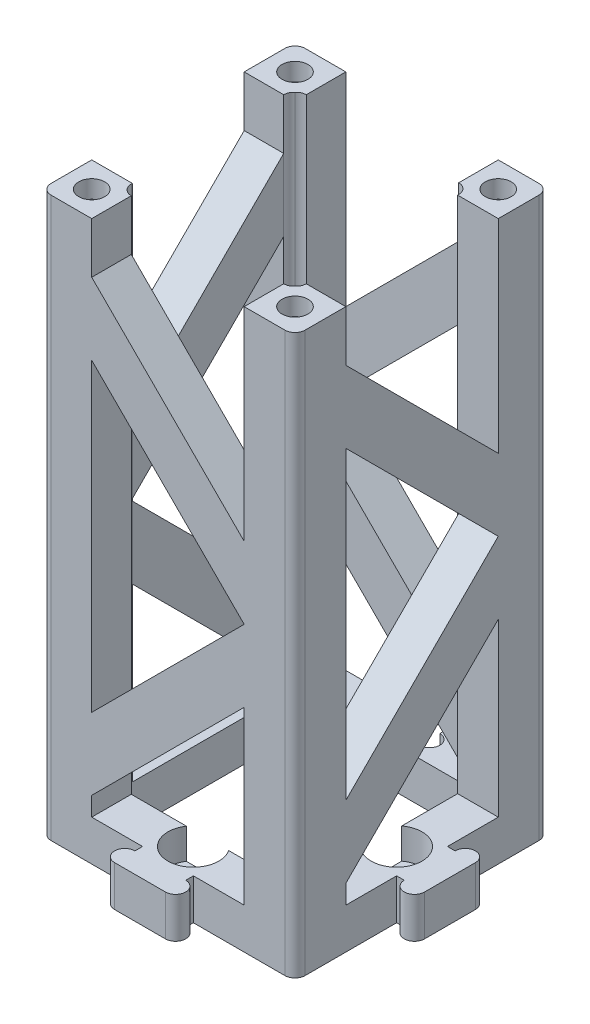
ISO-10303-21;
HEADER;
FILE_DESCRIPTION(('STEP AP214'),'2;1');
FILE_NAME('part.step','',(''),(''),'','','');
FILE_SCHEMA(('AUTOMOTIVE_DESIGN { 1 0 10303 214 1 1 1 1 }'));
ENDSEC;
DATA;
#1=APPLICATION_CONTEXT('core data for automotive mechanical design processes');
#2=APPLICATION_PROTOCOL_DEFINITION('international standard','automotive_design',2000,#1);
#3=PRODUCT_CONTEXT('',#1,'mechanical');
#4=PRODUCT('Part','Part','',(#3));
#5=PRODUCT_RELATED_PRODUCT_CATEGORY('part','',(#4));
#6=PRODUCT_DEFINITION_FORMATION('','',#4);
#7=PRODUCT_DEFINITION_CONTEXT('part definition',#1,'design');
#8=PRODUCT_DEFINITION('design','',#6,#7);
#9=PRODUCT_DEFINITION_SHAPE('','',#8);
#10=(LENGTH_UNIT() NAMED_UNIT(*) SI_UNIT(.MILLI.,.METRE.));
#11=(NAMED_UNIT(*) PLANE_ANGLE_UNIT() SI_UNIT($,.RADIAN.));
#12=(NAMED_UNIT(*) SI_UNIT($,.STERADIAN.) SOLID_ANGLE_UNIT());
#13=UNCERTAINTY_MEASURE_WITH_UNIT(LENGTH_MEASURE(1.E-05),#10,'distance_accuracy_value','');
#14=(GEOMETRIC_REPRESENTATION_CONTEXT(3) GLOBAL_UNCERTAINTY_ASSIGNED_CONTEXT((#13)) GLOBAL_UNIT_ASSIGNED_CONTEXT((#10,
#11,#12)) REPRESENTATION_CONTEXT('',''));
#15=CARTESIAN_POINT('',(0.,0.,0.));
#16=DIRECTION('',(0.,0.,1.));
#17=DIRECTION('',(1.,0.,0.));
#18=AXIS2_PLACEMENT_3D('',#15,#16,#17);
#19=CARTESIAN_POINT('',(-15.,110.,0.));
#20=DIRECTION('',(1.,0.,0.));
#21=DIRECTION('',(0.,0.,-1.));
#22=AXIS2_PLACEMENT_3D('',#19,#20,#21);
#23=PLANE('',#22);
#24=DIRECTION('',(0.,-1.,0.));
#25=VECTOR('',#24,1.);
#26=CARTESIAN_POINT('',(-15.,110.,25.));
#27=LINE('',#26,#25);
#28=CARTESIAN_POINT('',(-15.,85.857864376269,25.));
#29=VERTEX_POINT('',#28);
#30=CARTESIAN_POINT('',(-15.,25.8578643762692,25.));
#31=VERTEX_POINT('',#30);
#32=EDGE_CURVE('E836',#29,#31,#27,.T.);
#33=ORIENTED_EDGE('',*,*,#32,.T.);
#34=DIRECTION('',(0.,0.,1.));
#35=VECTOR('',#34,1.);
#36=CARTESIAN_POINT('',(-15.,25.8578643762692,17.2179144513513));
#37=LINE('',#36,#35);
#38=CARTESIAN_POINT('',(-15.,25.8578643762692,17.2179144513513));
#39=VERTEX_POINT('',#38);
#40=EDGE_CURVE('E1880',#39,#31,#37,.T.);
#41=ORIENTED_EDGE('',*,*,#40,.F.);
#42=DIRECTION('',(0.,-1.,0.));
#43=VECTOR('',#42,1.);
#44=CARTESIAN_POINT('',(-15.,110.,17.2179144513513));
#45=LINE('',#44,#43);
#46=CARTESIAN_POINT('',(-15.,85.857864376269,17.2179144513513));
#47=VERTEX_POINT('',#46);
#48=EDGE_CURVE('E847',#47,#39,#45,.T.);
#49=ORIENTED_EDGE('',*,*,#48,.F.);
#50=DIRECTION('',(0.,0.,1.));
#51=VECTOR('',#50,1.);
#52=CARTESIAN_POINT('',(-15.,85.857864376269,17.2179144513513));
#53=LINE('',#52,#51);
#54=EDGE_CURVE('E1491',#47,#29,#53,.T.);
#55=ORIENTED_EDGE('',*,*,#54,.T.);
#56=EDGE_LOOP('',(#33,#41,#49,#55));
#57=FACE_BOUND('',#56,.T.);
#58=ADVANCED_FACE('F102',(#57),#23,.T.);
#59=DIRECTION('',(0.,0.,1.));
#60=VECTOR('',#59,1.);
#61=CARTESIAN_POINT('',(-15.,11.7157287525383,17.2179144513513));
#62=LINE('',#61,#60);
#63=CARTESIAN_POINT('',(-15.,11.7157287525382,17.2179144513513));
#64=VERTEX_POINT('',#63);
#65=CARTESIAN_POINT('',(-15.,11.7157287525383,25.));
#66=VERTEX_POINT('',#65);
#67=EDGE_CURVE('E680',#64,#66,#62,.T.);
#68=ORIENTED_EDGE('',*,*,#67,.T.);
#69=CARTESIAN_POINT('',(-15.,8.,25.));
#70=VERTEX_POINT('',#69);
#71=EDGE_CURVE('E689',#66,#70,#27,.T.);
#72=ORIENTED_EDGE('',*,*,#71,.T.);
#73=DIRECTION('',(0.,0.,1.));
#74=VECTOR('',#73,1.);
#75=CARTESIAN_POINT('',(-15.,8.,0.));
#76=LINE('',#75,#74);
#77=CARTESIAN_POINT('',(-15.,8.,17.2179144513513));
#78=VERTEX_POINT('',#77);
#79=EDGE_CURVE('E713',#78,#70,#76,.T.);
#80=ORIENTED_EDGE('',*,*,#79,.F.);
#81=EDGE_CURVE('E842',#64,#78,#45,.T.);
#82=ORIENTED_EDGE('',*,*,#81,.F.);
#83=EDGE_LOOP('',(#68,#72,#80,#82));
#84=FACE_BOUND('',#83,.T.);
#85=ADVANCED_FACE('F1461',(#84),#23,.T.);
#86=CARTESIAN_POINT('',(15.,110.,1.62630325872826E-13));
#87=DIRECTION('',(1.,0.,0.));
#88=DIRECTION('',(0.,0.,-1.));
#89=AXIS2_PLACEMENT_3D('',#86,#87,#88);
#90=PLANE('',#89);
#91=DIRECTION('',(0.,-1.,0.));
#92=VECTOR('',#91,1.);
#93=CARTESIAN_POINT('',(14.9999999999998,110.,25.));
#94=LINE('',#93,#92);
#95=CARTESIAN_POINT('',(14.9999999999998,41.7157287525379,25.));
#96=VERTEX_POINT('',#95);
#97=CARTESIAN_POINT('',(14.9999999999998,8.,25.));
#98=VERTEX_POINT('',#97);
#99=EDGE_CURVE('E686',#96,#98,#94,.T.);
#100=ORIENTED_EDGE('',*,*,#99,.F.);
#101=DIRECTION('',(0.,0.,1.));
#102=VECTOR('',#101,1.);
#103=CARTESIAN_POINT('',(14.9999999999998,41.7157287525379,17.2179144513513));
#104=LINE('',#103,#102);
#105=CARTESIAN_POINT('',(14.9999999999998,41.7157287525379,17.2179144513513));
#106=VERTEX_POINT('',#105);
#107=EDGE_CURVE('E672',#106,#96,#104,.T.);
#108=ORIENTED_EDGE('',*,*,#107,.F.);
#109=DIRECTION('',(0.,-1.,0.));
#110=VECTOR('',#109,1.);
#111=CARTESIAN_POINT('',(15.,110.,17.2179144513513));
#112=LINE('',#111,#110);
#113=CARTESIAN_POINT('',(15.,8.,17.2179144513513));
#114=VERTEX_POINT('',#113);
#115=EDGE_CURVE('E701',#106,#114,#112,.T.);
#116=ORIENTED_EDGE('',*,*,#115,.T.);
#117=DIRECTION('',(0.,0.,1.));
#118=VECTOR('',#117,1.);
#119=CARTESIAN_POINT('',(15.,8.,1.62630325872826E-13));
#120=LINE('',#119,#118);
#121=EDGE_CURVE('E696',#114,#98,#120,.T.);
#122=ORIENTED_EDGE('',*,*,#121,.T.);
#123=EDGE_LOOP('',(#100,#108,#116,#122));
#124=FACE_BOUND('',#123,.T.);
#125=ADVANCED_FACE('F694',(#124),#90,.F.);
#126=CARTESIAN_POINT('',(0.,110.,-15.));
#127=DIRECTION('',(0.,0.,1.));
#128=DIRECTION('',(1.,0.,0.));
#129=AXIS2_PLACEMENT_3D('',#126,#127,#128);
#130=PLANE('',#129);
#131=DIRECTION('',(0.,-1.,0.));
#132=VECTOR('',#131,1.);
#133=CARTESIAN_POINT('',(-25.,110.,-15.0000000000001));
#134=LINE('',#133,#132);
#135=CARTESIAN_POINT('',(-25.,85.857864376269,-15.0000000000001));
#136=VERTEX_POINT('',#135);
#137=CARTESIAN_POINT('',(-25.,25.8578643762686,-15.0000000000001));
#138=VERTEX_POINT('',#137);
#139=EDGE_CURVE('E799',#136,#138,#134,.T.);
#140=ORIENTED_EDGE('',*,*,#139,.T.);
#141=DIRECTION('',(-1.,0.,0.));
#142=VECTOR('',#141,1.);
#143=CARTESIAN_POINT('',(-17.2179144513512,25.8578643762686,-15.0000000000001));
#144=LINE('',#143,#142);
#145=CARTESIAN_POINT('',(-17.2179144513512,25.8578643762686,-15.0000000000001));
#146=VERTEX_POINT('',#145);
#147=EDGE_CURVE('E1526',#146,#138,#144,.T.);
#148=ORIENTED_EDGE('',*,*,#147,.F.);
#149=DIRECTION('',(0.,-1.,0.));
#150=VECTOR('',#149,1.);
#151=CARTESIAN_POINT('',(-17.2179144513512,110.,-15.0000000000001));
#152=LINE('',#151,#150);
#153=CARTESIAN_POINT('',(-17.2179144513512,85.857864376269,-15.0000000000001));
#154=VERTEX_POINT('',#153);
#155=EDGE_CURVE('E795',#154,#146,#152,.T.);
#156=ORIENTED_EDGE('',*,*,#155,.F.);
#157=DIRECTION('',(-1.,0.,0.));
#158=VECTOR('',#157,1.);
#159=CARTESIAN_POINT('',(-17.2179144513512,85.857864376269,-15.0000000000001));
#160=LINE('',#159,#158);
#161=EDGE_CURVE('E1569',#154,#136,#160,.T.);
#162=ORIENTED_EDGE('',*,*,#161,.T.);
#163=EDGE_LOOP('',(#140,#148,#156,#162));
#164=FACE_BOUND('',#163,.T.);
#165=ADVANCED_FACE('F1778',(#164),#130,.T.);
#166=CARTESIAN_POINT('',(0.,110.,15.));
#167=DIRECTION('',(0.,0.,1.));
#168=DIRECTION('',(1.,0.,0.));
#169=AXIS2_PLACEMENT_3D('',#166,#167,#168);
#170=PLANE('',#169);
#171=DIRECTION('',(0.,-1.,0.));
#172=VECTOR('',#171,1.);
#173=CARTESIAN_POINT('',(-25.,110.,15.));
#174=LINE('',#173,#172);
#175=CARTESIAN_POINT('',(-25.0000000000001,41.7157287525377,15.));
#176=VERTEX_POINT('',#175);
#177=CARTESIAN_POINT('',(-25.,8.,15.));
#178=VERTEX_POINT('',#177);
#179=EDGE_CURVE('E835',#176,#178,#174,.T.);
#180=ORIENTED_EDGE('',*,*,#179,.F.);
#181=DIRECTION('',(-1.,0.,0.));
#182=VECTOR('',#181,1.);
#183=CARTESIAN_POINT('',(-17.2179144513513,41.7157287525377,15.));
#184=LINE('',#183,#182);
#185=CARTESIAN_POINT('',(-17.2179144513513,41.7157287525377,15.));
#186=VERTEX_POINT('',#185);
#187=EDGE_CURVE('E1533',#186,#176,#184,.T.);
#188=ORIENTED_EDGE('',*,*,#187,.F.);
#189=DIRECTION('',(0.,1.,0.));
#190=VECTOR('',#189,1.);
#191=CARTESIAN_POINT('',(-17.2179144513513,0.,15.));
#192=LINE('',#191,#190);
#193=CARTESIAN_POINT('',(-17.2179144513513,55.8578643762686,15.));
#194=VERTEX_POINT('',#193);
#195=EDGE_CURVE('E1528',#186,#194,#192,.T.);
#196=ORIENTED_EDGE('',*,*,#195,.T.);
#197=DIRECTION('',(0.,-1.,0.));
#198=VECTOR('',#197,1.);
#199=CARTESIAN_POINT('',(-17.2179144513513,0.,15.));
#200=LINE('',#199,#198);
#201=CARTESIAN_POINT('',(-17.2179144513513,69.9999999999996,15.));
#202=VERTEX_POINT('',#201);
#203=EDGE_CURVE('E1547',#202,#194,#200,.T.);
#204=ORIENTED_EDGE('',*,*,#203,.F.);
#205=DIRECTION('',(-1.,0.,0.));
#206=VECTOR('',#205,1.);
#207=CARTESIAN_POINT('',(-17.2179144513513,69.9999999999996,15.));
#208=LINE('',#207,#206);
#209=CARTESIAN_POINT('',(-25.0000000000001,69.9999999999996,15.));
#210=VERTEX_POINT('',#209);
#211=EDGE_CURVE('E1560',#202,#210,#208,.T.);
#212=ORIENTED_EDGE('',*,*,#211,.T.);
#213=CARTESIAN_POINT('',(-25.,110.,15.));
#214=VERTEX_POINT('',#213);
#215=EDGE_CURVE('E837',#214,#210,#174,.T.);
#216=ORIENTED_EDGE('',*,*,#215,.F.);
#217=DIRECTION('',(-1.,0.,0.));
#218=VECTOR('',#217,1.);
#219=CARTESIAN_POINT('',(0.,110.,15.));
#220=LINE('',#219,#218);
#221=CARTESIAN_POINT('',(-17.,110.,15.));
#222=VERTEX_POINT('',#221);
#223=EDGE_CURVE('E817',#222,#214,#220,.T.);
#224=ORIENTED_EDGE('',*,*,#223,.F.);
#225=DIRECTION('',(0.,-1.,0.));
#226=VECTOR('',#225,1.);
#227=CARTESIAN_POINT('',(-17.,110.,15.));
#228=LINE('',#227,#226);
#229=CARTESIAN_POINT('',(-17.,8.,15.));
#230=VERTEX_POINT('',#229);
#231=EDGE_CURVE('E840',#222,#230,#228,.T.);
#232=ORIENTED_EDGE('',*,*,#231,.T.);
#233=DIRECTION('',(-1.,0.,0.));
#234=VECTOR('',#233,1.);
#235=CARTESIAN_POINT('',(0.,8.,15.));
#236=LINE('',#235,#234);
#237=EDGE_CURVE('E812',#230,#178,#236,.T.);
#238=ORIENTED_EDGE('',*,*,#237,.T.);
#239=EDGE_LOOP('',(#180,#188,#196,#204,#212,#216,#224,#232,#238));
#240=FACE_BOUND('',#239,.T.);
#241=ADVANCED_FACE('F1784',(#240),#170,.F.);
#242=DIRECTION('',(-1.,0.,0.));
#243=VECTOR('',#242,1.);
#244=CARTESIAN_POINT('',(-17.2179144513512,11.7157287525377,-15.0000000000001));
#245=LINE('',#244,#243);
#246=CARTESIAN_POINT('',(-17.2179144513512,11.7157287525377,-15.0000000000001));
#247=VERTEX_POINT('',#246);
#248=CARTESIAN_POINT('',(-25.,11.7157287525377,-15.0000000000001));
#249=VERTEX_POINT('',#248);
#250=EDGE_CURVE('E1529',#247,#249,#245,.T.);
#251=ORIENTED_EDGE('',*,*,#250,.T.);
#252=CARTESIAN_POINT('',(-25.,8.,-15.0000000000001));
#253=VERTEX_POINT('',#252);
#254=EDGE_CURVE('E794',#249,#253,#134,.T.);
#255=ORIENTED_EDGE('',*,*,#254,.T.);
#256=DIRECTION('',(-1.,0.,0.));
#257=VECTOR('',#256,1.);
#258=CARTESIAN_POINT('',(0.,8.,-15.));
#259=LINE('',#258,#257);
#260=CARTESIAN_POINT('',(-17.2179144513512,8.,-15.0000000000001));
#261=VERTEX_POINT('',#260);
#262=EDGE_CURVE('E763',#261,#253,#259,.T.);
#263=ORIENTED_EDGE('',*,*,#262,.F.);
#264=EDGE_CURVE('E781',#247,#261,#152,.T.);
#265=ORIENTED_EDGE('',*,*,#264,.F.);
#266=EDGE_LOOP('',(#251,#255,#263,#265));
#267=FACE_BOUND('',#266,.T.);
#268=ADVANCED_FACE('F1779',(#267),#130,.T.);
#269=CARTESIAN_POINT('',(15.,110.,0.));
#270=DIRECTION('',(-1.,0.,0.));
#271=DIRECTION('',(0.,0.,1.));
#272=AXIS2_PLACEMENT_3D('',#269,#270,#271);
#273=PLANE('',#272);
#274=DIRECTION('',(0.,-1.,0.));
#275=VECTOR('',#274,1.);
#276=CARTESIAN_POINT('',(15.0000000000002,110.,-25.));
#277=LINE('',#276,#275);
#278=CARTESIAN_POINT('',(15.0000000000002,85.857864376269,-25.));
#279=VERTEX_POINT('',#278);
#280=CARTESIAN_POINT('',(15.0000000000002,25.8578643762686,-25.));
#281=VERTEX_POINT('',#280);
#282=EDGE_CURVE('E746',#279,#281,#277,.T.);
#283=ORIENTED_EDGE('',*,*,#282,.T.);
#284=DIRECTION('',(0.,0.,-1.));
#285=VECTOR('',#284,1.);
#286=CARTESIAN_POINT('',(15.0000000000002,25.8578643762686,-17.2179144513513));
#287=LINE('',#286,#285);
#288=CARTESIAN_POINT('',(15.0000000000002,25.8578643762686,-17.2179144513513));
#289=VERTEX_POINT('',#288);
#290=EDGE_CURVE('E1589',#289,#281,#287,.T.);
#291=ORIENTED_EDGE('',*,*,#290,.F.);
#292=DIRECTION('',(0.,-1.,0.));
#293=VECTOR('',#292,1.);
#294=CARTESIAN_POINT('',(15.,110.,-17.2179144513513));
#295=LINE('',#294,#293);
#296=CARTESIAN_POINT('',(15.,85.8578643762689,-17.2179144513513));
#297=VERTEX_POINT('',#296);
#298=EDGE_CURVE('E758',#297,#289,#295,.T.);
#299=ORIENTED_EDGE('',*,*,#298,.F.);
#300=DIRECTION('',(0.,0.,-1.));
#301=VECTOR('',#300,1.);
#302=CARTESIAN_POINT('',(15.0000000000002,85.857864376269,-17.2179144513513));
#303=LINE('',#302,#301);
#304=EDGE_CURVE('E1275',#297,#279,#303,.T.);
#305=ORIENTED_EDGE('',*,*,#304,.T.);
#306=EDGE_LOOP('',(#283,#291,#299,#305));
#307=FACE_BOUND('',#306,.T.);
#308=ADVANCED_FACE('F1625',(#307),#273,.T.);
#309=DIRECTION('',(0.,0.,-1.));
#310=VECTOR('',#309,1.);
#311=CARTESIAN_POINT('',(15.0000000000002,11.7157287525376,-17.2179144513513));
#312=LINE('',#311,#310);
#313=CARTESIAN_POINT('',(15.,11.7157287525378,-17.2179144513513));
#314=VERTEX_POINT('',#313);
#315=CARTESIAN_POINT('',(15.0000000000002,11.7157287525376,-25.));
#316=VERTEX_POINT('',#315);
#317=EDGE_CURVE('E1580',#314,#316,#312,.T.);
#318=ORIENTED_EDGE('',*,*,#317,.T.);
#319=CARTESIAN_POINT('',(15.0000000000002,8.,-25.));
#320=VERTEX_POINT('',#319);
#321=EDGE_CURVE('E736',#316,#320,#277,.T.);
#322=ORIENTED_EDGE('',*,*,#321,.T.);
#323=DIRECTION('',(0.,0.,-1.));
#324=VECTOR('',#323,1.);
#325=CARTESIAN_POINT('',(15.,8.,0.));
#326=LINE('',#325,#324);
#327=CARTESIAN_POINT('',(15.,8.,-17.2179144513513));
#328=VERTEX_POINT('',#327);
#329=EDGE_CURVE('E737',#328,#320,#326,.T.);
#330=ORIENTED_EDGE('',*,*,#329,.F.);
#331=EDGE_CURVE('E753',#314,#328,#295,.T.);
#332=ORIENTED_EDGE('',*,*,#331,.F.);
#333=EDGE_LOOP('',(#318,#322,#330,#332));
#334=FACE_BOUND('',#333,.T.);
#335=ADVANCED_FACE('F1637',(#334),#273,.T.);
#336=CARTESIAN_POINT('',(-15.,110.,0.));
#337=DIRECTION('',(-1.,0.,0.));
#338=DIRECTION('',(0.,0.,1.));
#339=AXIS2_PLACEMENT_3D('',#336,#337,#338);
#340=PLANE('',#339);
#341=DIRECTION('',(0.,-1.,0.));
#342=VECTOR('',#341,1.);
#343=CARTESIAN_POINT('',(-14.9999999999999,110.,-25.));
#344=LINE('',#343,#342);
#345=CARTESIAN_POINT('',(-14.9999999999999,41.7157287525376,-25.));
#346=VERTEX_POINT('',#345);
#347=CARTESIAN_POINT('',(-14.9999999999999,8.,-25.));
#348=VERTEX_POINT('',#347);
#349=EDGE_CURVE('E798',#346,#348,#344,.T.);
#350=ORIENTED_EDGE('',*,*,#349,.F.);
#351=DIRECTION('',(0.,0.,-1.));
#352=VECTOR('',#351,1.);
#353=CARTESIAN_POINT('',(-14.9999999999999,41.7157287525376,-17.2179144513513));
#354=LINE('',#353,#352);
#355=CARTESIAN_POINT('',(-14.9999999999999,41.7157287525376,-17.2179144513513));
#356=VERTEX_POINT('',#355);
#357=EDGE_CURVE('E1585',#356,#346,#354,.T.);
#358=ORIENTED_EDGE('',*,*,#357,.F.);
#359=DIRECTION('',(0.,-1.,0.));
#360=VECTOR('',#359,1.);
#361=CARTESIAN_POINT('',(-15.,110.,-17.2179144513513));
#362=LINE('',#361,#360);
#363=CARTESIAN_POINT('',(-15.,8.,-17.2179144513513));
#364=VERTEX_POINT('',#363);
#365=EDGE_CURVE('E803',#356,#364,#362,.T.);
#366=ORIENTED_EDGE('',*,*,#365,.T.);
#367=DIRECTION('',(0.,0.,-1.));
#368=VECTOR('',#367,1.);
#369=CARTESIAN_POINT('',(-15.,8.,0.));
#370=LINE('',#369,#368);
#371=EDGE_CURVE('E785',#364,#348,#370,.T.);
#372=ORIENTED_EDGE('',*,*,#371,.T.);
#373=EDGE_LOOP('',(#350,#358,#366,#372));
#374=FACE_BOUND('',#373,.T.);
#375=ADVANCED_FACE('F1670',(#374),#340,.F.);
#376=CARTESIAN_POINT('',(-1.40434820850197E-13,110.,15.));
#377=DIRECTION('',(0.,0.,-1.));
#378=DIRECTION('',(-1.,0.,0.));
#379=AXIS2_PLACEMENT_3D('',#376,#377,#378);
#380=PLANE('',#379);
#381=DIRECTION('',(0.,-1.,0.));
#382=VECTOR('',#381,1.);
#383=CARTESIAN_POINT('',(25.,110.,15.0000000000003));
#384=LINE('',#383,#382);
#385=CARTESIAN_POINT('',(25.,85.857864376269,15.0000000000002));
#386=VERTEX_POINT('',#385);
#387=CARTESIAN_POINT('',(25.,25.8578643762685,15.0000000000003));
#388=VERTEX_POINT('',#387);
#389=EDGE_CURVE('E702',#386,#388,#384,.T.);
#390=ORIENTED_EDGE('',*,*,#389,.T.);
#391=DIRECTION('',(1.,0.,0.));
#392=VECTOR('',#391,1.);
#393=CARTESIAN_POINT('',(17.2179144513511,25.8578643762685,15.0000000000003));
#394=LINE('',#393,#392);
#395=CARTESIAN_POINT('',(17.2179144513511,25.8578643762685,15.0000000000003));
#396=VERTEX_POINT('',#395);
#397=EDGE_CURVE('E1261',#396,#388,#394,.T.);
#398=ORIENTED_EDGE('',*,*,#397,.F.);
#399=DIRECTION('',(0.,-1.,0.));
#400=VECTOR('',#399,1.);
#401=CARTESIAN_POINT('',(17.2179144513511,110.,15.0000000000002));
#402=LINE('',#401,#400);
#403=CARTESIAN_POINT('',(17.2179144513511,85.8578643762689,15.0000000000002));
#404=VERTEX_POINT('',#403);
#405=EDGE_CURVE('E1228',#404,#396,#402,.T.);
#406=ORIENTED_EDGE('',*,*,#405,.F.);
#407=DIRECTION('',(1.,0.,0.));
#408=VECTOR('',#407,1.);
#409=CARTESIAN_POINT('',(17.2179144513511,85.857864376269,15.0000000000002));
#410=LINE('',#409,#408);
#411=EDGE_CURVE('E1259',#404,#386,#410,.T.);
#412=ORIENTED_EDGE('',*,*,#411,.T.);
#413=EDGE_LOOP('',(#390,#398,#406,#412));
#414=FACE_BOUND('',#413,.T.);
#415=ADVANCED_FACE('F1257',(#414),#380,.T.);
#416=DIRECTION('',(1.,0.,0.));
#417=VECTOR('',#416,1.);
#418=CARTESIAN_POINT('',(17.2179144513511,11.7157287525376,15.0000000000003));
#419=LINE('',#418,#417);
#420=CARTESIAN_POINT('',(17.2179144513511,11.7157287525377,15.0000000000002));
#421=VERTEX_POINT('',#420);
#422=CARTESIAN_POINT('',(25.,11.7157287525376,15.0000000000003));
#423=VERTEX_POINT('',#422);
#424=EDGE_CURVE('E1277',#421,#423,#419,.T.);
#425=ORIENTED_EDGE('',*,*,#424,.T.);
#426=CARTESIAN_POINT('',(25.,8.,15.0000000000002));
#427=VERTEX_POINT('',#426);
#428=EDGE_CURVE('E704',#423,#427,#384,.T.);
#429=ORIENTED_EDGE('',*,*,#428,.T.);
#430=DIRECTION('',(1.,0.,0.));
#431=VECTOR('',#430,1.);
#432=CARTESIAN_POINT('',(-1.40434820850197E-13,8.,15.));
#433=LINE('',#432,#431);
#434=CARTESIAN_POINT('',(17.2179144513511,8.,15.0000000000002));
#435=VERTEX_POINT('',#434);
#436=EDGE_CURVE('E1238',#435,#427,#433,.T.);
#437=ORIENTED_EDGE('',*,*,#436,.F.);
#438=EDGE_CURVE('E1225',#421,#435,#402,.T.);
#439=ORIENTED_EDGE('',*,*,#438,.F.);
#440=EDGE_LOOP('',(#425,#429,#437,#439));
#441=FACE_BOUND('',#440,.T.);
#442=ADVANCED_FACE('F1391',(#441),#380,.T.);
#443=CARTESIAN_POINT('',(1.13841228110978E-13,110.,-15.));
#444=DIRECTION('',(0.,0.,-1.));
#445=DIRECTION('',(-1.,0.,0.));
#446=AXIS2_PLACEMENT_3D('',#443,#444,#445);
#447=PLANE('',#446);
#448=DIRECTION('',(0.,-1.,0.));
#449=VECTOR('',#448,1.);
#450=CARTESIAN_POINT('',(25.,110.,-14.9999999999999));
#451=LINE('',#450,#449);
#452=CARTESIAN_POINT('',(25.,41.7157287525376,-14.9999999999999));
#453=VERTEX_POINT('',#452);
#454=CARTESIAN_POINT('',(25.,8.,-14.9999999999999));
#455=VERTEX_POINT('',#454);
#456=EDGE_CURVE('E745',#453,#455,#451,.T.);
#457=ORIENTED_EDGE('',*,*,#456,.F.);
#458=DIRECTION('',(1.,0.,0.));
#459=VECTOR('',#458,1.);
#460=CARTESIAN_POINT('',(17.2179144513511,41.7157287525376,-14.9999999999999));
#461=LINE('',#460,#459);
#462=CARTESIAN_POINT('',(17.2179144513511,41.7157287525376,-14.9999999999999));
#463=VERTEX_POINT('',#462);
#464=EDGE_CURVE('E1281',#463,#453,#461,.T.);
#465=ORIENTED_EDGE('',*,*,#464,.F.);
#466=DIRECTION('',(0.,1.,0.));
#467=VECTOR('',#466,1.);
#468=CARTESIAN_POINT('',(17.2179144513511,0.,-14.9999999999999));
#469=LINE('',#468,#467);
#470=CARTESIAN_POINT('',(17.2179144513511,55.8578643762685,-14.9999999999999));
#471=VERTEX_POINT('',#470);
#472=EDGE_CURVE('E1265',#463,#471,#469,.T.);
#473=ORIENTED_EDGE('',*,*,#472,.T.);
#474=DIRECTION('',(0.,-1.,0.));
#475=VECTOR('',#474,1.);
#476=CARTESIAN_POINT('',(17.2179144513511,0.,-14.9999999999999));
#477=LINE('',#476,#475);
#478=CARTESIAN_POINT('',(17.2179144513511,69.9999999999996,-14.9999999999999));
#479=VERTEX_POINT('',#478);
#480=EDGE_CURVE('E1290',#479,#471,#477,.T.);
#481=ORIENTED_EDGE('',*,*,#480,.F.);
#482=DIRECTION('',(1.,0.,0.));
#483=VECTOR('',#482,1.);
#484=CARTESIAN_POINT('',(17.2179144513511,69.9999999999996,-14.9999999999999));
#485=LINE('',#484,#483);
#486=CARTESIAN_POINT('',(25.,69.9999999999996,-14.9999999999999));
#487=VERTEX_POINT('',#486);
#488=EDGE_CURVE('E1300',#479,#487,#485,.T.);
#489=ORIENTED_EDGE('',*,*,#488,.T.);
#490=CARTESIAN_POINT('',(25.,110.,-14.9999999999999));
#491=VERTEX_POINT('',#490);
#492=EDGE_CURVE('E747',#491,#487,#451,.T.);
#493=ORIENTED_EDGE('',*,*,#492,.F.);
#494=DIRECTION('',(1.,0.,0.));
#495=VECTOR('',#494,1.);
#496=CARTESIAN_POINT('',(1.13841228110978E-13,110.,-15.));
#497=LINE('',#496,#495);
#498=CARTESIAN_POINT('',(17.,110.,-14.9999999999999));
#499=VERTEX_POINT('',#498);
#500=EDGE_CURVE('E723',#499,#491,#497,.T.);
#501=ORIENTED_EDGE('',*,*,#500,.F.);
#502=DIRECTION('',(0.,-1.,0.));
#503=VECTOR('',#502,1.);
#504=CARTESIAN_POINT('',(17.,110.,-14.9999999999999));
#505=LINE('',#504,#503);
#506=CARTESIAN_POINT('',(17.,8.,-14.9999999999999));
#507=VERTEX_POINT('',#506);
#508=EDGE_CURVE('E750',#499,#507,#505,.T.);
#509=ORIENTED_EDGE('',*,*,#508,.T.);
#510=DIRECTION('',(1.,0.,0.));
#511=VECTOR('',#510,1.);
#512=CARTESIAN_POINT('',(1.13841228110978E-13,8.,-15.));
#513=LINE('',#512,#511);
#514=EDGE_CURVE('E718',#507,#455,#513,.T.);
#515=ORIENTED_EDGE('',*,*,#514,.T.);
#516=EDGE_LOOP('',(#457,#465,#473,#481,#489,#493,#501,#509,#515));
#517=FACE_BOUND('',#516,.T.);
#518=ADVANCED_FACE('F1399',(#517),#447,.F.);
#519=CARTESIAN_POINT('',(0.,8.,0.));
#520=DIRECTION('',(0.,1.,0.));
#521=DIRECTION('',(0.,0.,1.));
#522=AXIS2_PLACEMENT_3D('',#519,#520,#521);
#523=PLANE('',#522);
#524=DIRECTION('',(-1.,0.,0.));
#525=VECTOR('',#524,1.);
#526=CARTESIAN_POINT('',(0.,8.,-25.));
#527=LINE('',#526,#525);
#528=CARTESIAN_POINT('',(-5.,8.,-25.));
#529=VERTEX_POINT('',#528);
#530=EDGE_CURVE('E963',#529,#348,#527,.T.);
#531=ORIENTED_EDGE('',*,*,#530,.T.);
#532=ORIENTED_EDGE('',*,*,#371,.F.);
#533=DIRECTION('',(-1.,0.,0.));
#534=VECTOR('',#533,1.);
#535=CARTESIAN_POINT('',(0.,8.,-17.2179144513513));
#536=LINE('',#535,#534);
#537=EDGE_CURVE('E894',#328,#364,#536,.T.);
#538=ORIENTED_EDGE('',*,*,#537,.F.);
#539=ORIENTED_EDGE('',*,*,#329,.T.);
#540=DIRECTION('',(-1.,0.,0.));
#541=VECTOR('',#540,1.);
#542=CARTESIAN_POINT('',(0.,8.,-25.));
#543=LINE('',#542,#541);
#544=CARTESIAN_POINT('',(5.,8.,-25.));
#545=VERTEX_POINT('',#544);
#546=EDGE_CURVE('E948',#320,#545,#543,.T.);
#547=ORIENTED_EDGE('',*,*,#546,.T.);
#548=DIRECTION('',(0.,0.,1.));
#549=VECTOR('',#548,1.);
#550=CARTESIAN_POINT('',(5.,8.,0.));
#551=LINE('',#550,#549);
#552=CARTESIAN_POINT('',(5.,8.,-23.5));
#553=VERTEX_POINT('',#552);
#554=EDGE_CURVE('E950',#545,#553,#551,.T.);
#555=ORIENTED_EDGE('',*,*,#554,.T.);
#556=CARTESIAN_POINT('',(5.,8.,-21.5));
#557=DIRECTION('',(0.,1.,0.));
#558=DIRECTION('',(0.,0.,1.));
#559=AXIS2_PLACEMENT_3D('',#556,#557,#558);
#560=CIRCLE('',#559,2.);
#561=CARTESIAN_POINT('',(5.,8.,-19.5));
#562=VERTEX_POINT('',#561);
#563=EDGE_CURVE('E952',#553,#562,#560,.F.);
#564=ORIENTED_EDGE('',*,*,#563,.T.);
#565=DIRECTION('',(1.,0.,0.));
#566=VECTOR('',#565,1.);
#567=CARTESIAN_POINT('',(0.,8.,-19.5));
#568=LINE('',#567,#566);
#569=CARTESIAN_POINT('',(-5.,8.,-19.5));
#570=VERTEX_POINT('',#569);
#571=EDGE_CURVE('E954',#570,#562,#568,.T.);
#572=ORIENTED_EDGE('',*,*,#571,.F.);
#573=CARTESIAN_POINT('',(-5.,8.,-21.5));
#574=DIRECTION('',(0.,1.,0.));
#575=DIRECTION('',(0.,0.,1.));
#576=AXIS2_PLACEMENT_3D('',#573,#574,#575);
#577=CIRCLE('',#576,2.);
#578=CARTESIAN_POINT('',(-5.,8.,-23.5));
#579=VERTEX_POINT('',#578);
#580=EDGE_CURVE('E957',#579,#570,#577,.T.);
#581=ORIENTED_EDGE('',*,*,#580,.F.);
#582=DIRECTION('',(0.,0.,1.));
#583=VECTOR('',#582,1.);
#584=CARTESIAN_POINT('',(-5.,8.,0.));
#585=LINE('',#584,#583);
#586=EDGE_CURVE('E960',#529,#579,#585,.T.);
#587=ORIENTED_EDGE('',*,*,#586,.F.);
#588=EDGE_LOOP('',(#531,#532,#538,#539,#547,#555,#564,#572,#581,#587));
#589=FACE_BOUND('',#588,.T.);
#590=ADVANCED_FACE('F1643',(#589),#523,.T.);
#591=DIRECTION('',(0.,0.,-1.));
#592=VECTOR('',#591,1.);
#593=CARTESIAN_POINT('',(25.,8.,0.));
#594=LINE('',#593,#592);
#595=CARTESIAN_POINT('',(25.,8.,-5.));
#596=VERTEX_POINT('',#595);
#597=EDGE_CURVE('E935',#596,#455,#594,.T.);
#598=ORIENTED_EDGE('',*,*,#597,.T.);
#599=ORIENTED_EDGE('',*,*,#514,.F.);
#600=DIRECTION('',(0.,0.,-1.));
#601=VECTOR('',#600,1.);
#602=CARTESIAN_POINT('',(17.,8.,0.));
#603=LINE('',#602,#601);
#604=CARTESIAN_POINT('',(17.,8.,-3.99999999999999));
#605=VERTEX_POINT('',#604);
#606=EDGE_CURVE('E897',#605,#507,#603,.T.);
#607=ORIENTED_EDGE('',*,*,#606,.F.);
#608=CARTESIAN_POINT('',(20.,8.,0.));
#609=DIRECTION('',(0.,1.,0.));
#610=DIRECTION('',(0.,0.,1.));
#611=AXIS2_PLACEMENT_3D('',#608,#609,#610);
#612=CIRCLE('',#611,5.);
#613=CARTESIAN_POINT('',(17.,8.,4.));
#614=VERTEX_POINT('',#613);
#615=EDGE_CURVE('E1163',#614,#605,#612,.T.);
#616=ORIENTED_EDGE('',*,*,#615,.F.);
#617=DIRECTION('',(0.,0.,-1.));
#618=VECTOR('',#617,1.);
#619=CARTESIAN_POINT('',(17.,8.,0.));
#620=LINE('',#619,#618);
#621=CARTESIAN_POINT('',(17.,8.,15.2179144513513));
#622=VERTEX_POINT('',#621);
#623=EDGE_CURVE('E877',#622,#614,#620,.T.);
#624=ORIENTED_EDGE('',*,*,#623,.F.);
#625=CARTESIAN_POINT('',(15.,8.,15.2179144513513));
#626=DIRECTION('',(0.,1.,0.));
#627=DIRECTION('',(0.,0.,1.));
#628=AXIS2_PLACEMENT_3D('',#625,#626,#627);
#629=CIRCLE('',#628,2.);
#630=CARTESIAN_POINT('',(16.5189672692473,8.,16.5189672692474));
#631=VERTEX_POINT('',#630);
#632=EDGE_CURVE('E880',#631,#622,#629,.T.);
#633=ORIENTED_EDGE('',*,*,#632,.F.);
#634=CARTESIAN_POINT('',(15.2179144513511,8.,15.0000000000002));
#635=DIRECTION('',(0.,1.,0.));
#636=DIRECTION('',(0.,0.,1.));
#637=AXIS2_PLACEMENT_3D('',#634,#635,#636);
#638=CIRCLE('',#637,2.);
#639=EDGE_CURVE('E757',#631,#435,#638,.T.);
#640=ORIENTED_EDGE('',*,*,#639,.T.);
#641=ORIENTED_EDGE('',*,*,#436,.T.);
#642=CARTESIAN_POINT('',(25.,8.,5.));
#643=VERTEX_POINT('',#642);
#644=EDGE_CURVE('E932',#427,#643,#594,.T.);
#645=ORIENTED_EDGE('',*,*,#644,.T.);
#646=DIRECTION('',(1.,0.,0.));
#647=VECTOR('',#646,1.);
#648=CARTESIAN_POINT('',(0.,8.,4.99999999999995));
#649=LINE('',#648,#647);
#650=CARTESIAN_POINT('',(26.5,8.,5.));
#651=VERTEX_POINT('',#650);
#652=EDGE_CURVE('E934',#643,#651,#649,.T.);
#653=ORIENTED_EDGE('',*,*,#652,.T.);
#654=CARTESIAN_POINT('',(28.5,8.,5.));
#655=DIRECTION('',(0.,1.,0.));
#656=DIRECTION('',(0.,0.,1.));
#657=AXIS2_PLACEMENT_3D('',#654,#655,#656);
#658=CIRCLE('',#657,2.);
#659=CARTESIAN_POINT('',(30.5,8.,5.));
#660=VERTEX_POINT('',#659);
#661=EDGE_CURVE('E937',#651,#660,#658,.T.);
#662=ORIENTED_EDGE('',*,*,#661,.T.);
#663=DIRECTION('',(0.,0.,1.));
#664=VECTOR('',#663,1.);
#665=CARTESIAN_POINT('',(30.5,8.,0.));
#666=LINE('',#665,#664);
#667=CARTESIAN_POINT('',(30.5,8.,-5.));
#668=VERTEX_POINT('',#667);
#669=EDGE_CURVE('E939',#668,#660,#666,.T.);
#670=ORIENTED_EDGE('',*,*,#669,.F.);
#671=CARTESIAN_POINT('',(28.5,8.,-5.));
#672=DIRECTION('',(0.,1.,0.));
#673=DIRECTION('',(0.,0.,1.));
#674=AXIS2_PLACEMENT_3D('',#671,#672,#673);
#675=CIRCLE('',#674,2.);
#676=CARTESIAN_POINT('',(26.5,8.,-5.));
#677=VERTEX_POINT('',#676);
#678=EDGE_CURVE('E942',#677,#668,#675,.F.);
#679=ORIENTED_EDGE('',*,*,#678,.F.);
#680=DIRECTION('',(1.,0.,0.));
#681=VECTOR('',#680,1.);
#682=CARTESIAN_POINT('',(0.,8.,-4.99999999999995));
#683=LINE('',#682,#681);
#684=EDGE_CURVE('E945',#596,#677,#683,.T.);
#685=ORIENTED_EDGE('',*,*,#684,.F.);
#686=EDGE_LOOP('',(#598,#599,#607,#616,#624,#633,#640,#641,#645,#653,#662,#670,#679,#685));
#687=FACE_BOUND('',#686,.T.);
#688=ADVANCED_FACE('F1384',(#687),#523,.T.);
#689=DIRECTION('',(-1.,0.,0.));
#690=VECTOR('',#689,1.);
#691=CARTESIAN_POINT('',(0.,8.,25.));
#692=LINE('',#691,#690);
#693=CARTESIAN_POINT('',(5.,8.,25.));
#694=VERTEX_POINT('',#693);
#695=EDGE_CURVE('E919',#98,#694,#692,.T.);
#696=ORIENTED_EDGE('',*,*,#695,.F.);
#697=ORIENTED_EDGE('',*,*,#121,.F.);
#698=DIRECTION('',(-1.,0.,0.));
#699=VECTOR('',#698,1.);
#700=CARTESIAN_POINT('',(0.,8.,17.2179144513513));
#701=LINE('',#700,#699);
#702=CARTESIAN_POINT('',(4.15451561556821,8.,17.2179144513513));
#703=VERTEX_POINT('',#702);
#704=EDGE_CURVE('E883',#114,#703,#701,.T.);
#705=ORIENTED_EDGE('',*,*,#704,.T.);
#706=CARTESIAN_POINT('',(0.,8.,20.));
#707=DIRECTION('',(0.,1.,0.));
#708=DIRECTION('',(0.,0.,1.));
#709=AXIS2_PLACEMENT_3D('',#706,#707,#708);
#710=CIRCLE('',#709,5.);
#711=CARTESIAN_POINT('',(-4.15451561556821,8.,17.2179144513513));
#712=VERTEX_POINT('',#711);
#713=EDGE_CURVE('E1189',#712,#703,#710,.T.);
#714=ORIENTED_EDGE('',*,*,#713,.F.);
#715=DIRECTION('',(-1.,0.,0.));
#716=VECTOR('',#715,1.);
#717=CARTESIAN_POINT('',(0.,8.,17.2179144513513));
#718=LINE('',#717,#716);
#719=EDGE_CURVE('E886',#712,#78,#718,.T.);
#720=ORIENTED_EDGE('',*,*,#719,.T.);
#721=ORIENTED_EDGE('',*,*,#79,.T.);
#722=CARTESIAN_POINT('',(-4.99999999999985,8.,25.));
#723=VERTEX_POINT('',#722);
#724=EDGE_CURVE('E916',#723,#70,#692,.T.);
#725=ORIENTED_EDGE('',*,*,#724,.F.);
#726=DIRECTION('',(-2.24357569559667E-13,0.,1.));
#727=VECTOR('',#726,1.);
#728=CARTESIAN_POINT('',(-4.99999999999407,8.,-1.12178784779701E-12));
#729=LINE('',#728,#727);
#730=CARTESIAN_POINT('',(-5.00000000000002,8.,26.5));
#731=VERTEX_POINT('',#730);
#732=EDGE_CURVE('E918',#723,#731,#729,.T.);
#733=ORIENTED_EDGE('',*,*,#732,.T.);
#734=CARTESIAN_POINT('',(-5.00000000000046,8.,28.5));
#735=DIRECTION('',(0.,1.,0.));
#736=DIRECTION('',(0.,0.,1.));
#737=AXIS2_PLACEMENT_3D('',#734,#735,#736);
#738=CIRCLE('',#737,2.);
#739=CARTESIAN_POINT('',(-5.0000000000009,8.,30.5));
#740=VERTEX_POINT('',#739);
#741=EDGE_CURVE('E921',#731,#740,#738,.T.);
#742=ORIENTED_EDGE('',*,*,#741,.T.);
#743=DIRECTION('',(-1.,0.,-2.2065682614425E-13));
#744=VECTOR('',#743,1.);
#745=CARTESIAN_POINT('',(-6.73003319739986E-12,8.,30.5000000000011));
#746=LINE('',#745,#744);
#747=CARTESIAN_POINT('',(4.9999999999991,8.,30.5000000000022));
#748=VERTEX_POINT('',#747);
#749=EDGE_CURVE('E923',#748,#740,#746,.T.);
#750=ORIENTED_EDGE('',*,*,#749,.F.);
#751=CARTESIAN_POINT('',(4.99999999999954,8.,28.5000000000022));
#752=DIRECTION('',(0.,1.,0.));
#753=DIRECTION('',(0.,0.,1.));
#754=AXIS2_PLACEMENT_3D('',#751,#752,#753);
#755=CIRCLE('',#754,2.00000000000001);
#756=CARTESIAN_POINT('',(5.,8.,26.5000000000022));
#757=VERTEX_POINT('',#756);
#758=EDGE_CURVE('E926',#757,#748,#755,.F.);
#759=ORIENTED_EDGE('',*,*,#758,.F.);
#760=DIRECTION('',(0.,0.,-1.));
#761=VECTOR('',#760,1.);
#762=CARTESIAN_POINT('',(5.,8.,0.));
#763=LINE('',#762,#761);
#764=EDGE_CURVE('E929',#757,#694,#763,.T.);
#765=ORIENTED_EDGE('',*,*,#764,.T.);
#766=EDGE_LOOP('',(#696,#697,#705,#714,#720,#721,#725,#733,#742,#750,#759,#765));
#767=FACE_BOUND('',#766,.T.);
#768=ADVANCED_FACE('F1870',(#767),#523,.T.);
#769=CARTESIAN_POINT('',(20.,8.,0.));
#770=DIRECTION('',(0.,-1.,0.));
#771=DIRECTION('',(0.,0.,-1.));
#772=AXIS2_PLACEMENT_3D('',#769,#770,#771);
#773=CYLINDRICAL_SURFACE('',#772,3.25);
#774=DIRECTION('',(0.,-1.,0.));
#775=VECTOR('',#774,1.);
#776=CARTESIAN_POINT('',(17.,8.,1.24999999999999));
#777=LINE('',#776,#775);
#778=CARTESIAN_POINT('',(17.,2.,1.24999999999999));
#779=VERTEX_POINT('',#778);
#780=CARTESIAN_POINT('',(17.,0.,1.24999999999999));
#781=VERTEX_POINT('',#780);
#782=EDGE_CURVE('E1091',#779,#781,#777,.T.);
#783=ORIENTED_EDGE('',*,*,#782,.F.);
#784=CARTESIAN_POINT('',(20.,2.,0.));
#785=DIRECTION('',(0.,1.,0.));
#786=DIRECTION('',(0.,0.,1.));
#787=AXIS2_PLACEMENT_3D('',#784,#785,#786);
#788=CIRCLE('',#787,3.25);
#789=CARTESIAN_POINT('',(17.,2.,-1.24999999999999));
#790=VERTEX_POINT('',#789);
#791=EDGE_CURVE('E865',#779,#790,#788,.T.);
#792=ORIENTED_EDGE('',*,*,#791,.T.);
#793=DIRECTION('',(0.,-1.,0.));
#794=VECTOR('',#793,1.);
#795=CARTESIAN_POINT('',(17.,8.,-1.24999999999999));
#796=LINE('',#795,#794);
#797=CARTESIAN_POINT('',(17.,0.,-1.24999999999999));
#798=VERTEX_POINT('',#797);
#799=EDGE_CURVE('E969',#790,#798,#796,.T.);
#800=ORIENTED_EDGE('',*,*,#799,.T.);
#801=CARTESIAN_POINT('',(20.,0.,0.));
#802=DIRECTION('',(0.,1.,0.));
#803=DIRECTION('',(0.,0.,1.));
#804=AXIS2_PLACEMENT_3D('',#801,#802,#803);
#805=CIRCLE('',#804,3.25);
#806=EDGE_CURVE('E876',#781,#798,#805,.T.);
#807=ORIENTED_EDGE('',*,*,#806,.F.);
#808=EDGE_LOOP('',(#783,#792,#800,#807));
#809=FACE_BOUND('',#808,.T.);
#810=ADVANCED_FACE('F1967',(#809),#773,.F.);
#811=CARTESIAN_POINT('',(0.,8.,20.));
#812=DIRECTION('',(0.,-1.,0.));
#813=DIRECTION('',(0.,0.,-1.));
#814=AXIS2_PLACEMENT_3D('',#811,#812,#813);
#815=CYLINDRICAL_SURFACE('',#814,3.05);
#816=DIRECTION('',(0.,-1.,0.));
#817=VECTOR('',#816,1.);
#818=CARTESIAN_POINT('',(-1.25000000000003,8.,17.2179144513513));
#819=LINE('',#818,#817);
#820=CARTESIAN_POINT('',(-1.25000000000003,2.,17.2179144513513));
#821=VERTEX_POINT('',#820);
#822=CARTESIAN_POINT('',(-1.25000000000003,0.,17.2179144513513));
#823=VERTEX_POINT('',#822);
#824=EDGE_CURVE('E1179',#821,#823,#819,.T.);
#825=ORIENTED_EDGE('',*,*,#824,.F.);
#826=CARTESIAN_POINT('',(0.,2.,20.));
#827=DIRECTION('',(0.,1.,0.));
#828=DIRECTION('',(0.,0.,1.));
#829=AXIS2_PLACEMENT_3D('',#826,#827,#828);
#830=CIRCLE('',#829,3.05);
#831=CARTESIAN_POINT('',(1.25000000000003,2.,17.2179144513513));
#832=VERTEX_POINT('',#831);
#833=EDGE_CURVE('E871',#821,#832,#830,.T.);
#834=ORIENTED_EDGE('',*,*,#833,.T.);
#835=DIRECTION('',(0.,-1.,0.));
#836=VECTOR('',#835,1.);
#837=CARTESIAN_POINT('',(1.25000000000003,8.,17.2179144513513));
#838=LINE('',#837,#836);
#839=CARTESIAN_POINT('',(1.25000000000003,0.,17.2179144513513));
#840=VERTEX_POINT('',#839);
#841=EDGE_CURVE('E1181',#832,#840,#838,.T.);
#842=ORIENTED_EDGE('',*,*,#841,.T.);
#843=CARTESIAN_POINT('',(0.,0.,20.));
#844=DIRECTION('',(0.,1.,0.));
#845=DIRECTION('',(0.,0.,1.));
#846=AXIS2_PLACEMENT_3D('',#843,#844,#845);
#847=CIRCLE('',#846,3.05);
#848=EDGE_CURVE('E981',#823,#840,#847,.T.);
#849=ORIENTED_EDGE('',*,*,#848,.F.);
#850=EDGE_LOOP('',(#825,#834,#842,#849));
#851=FACE_BOUND('',#850,.T.);
#852=ADVANCED_FACE('F1944',(#851),#815,.F.);
#853=CARTESIAN_POINT('',(0.,8.,-5.00000000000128));
#854=DIRECTION('',(0.,0.,-1.));
#855=DIRECTION('',(-1.,0.,0.));
#856=AXIS2_PLACEMENT_3D('',#853,#854,#855);
#857=PLANE('',#856);
#858=DIRECTION('',(1.,0.,0.));
#859=VECTOR('',#858,1.);
#860=CARTESIAN_POINT('',(0.,0.,-5.00000000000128));
#861=LINE('',#860,#859);
#862=CARTESIAN_POINT('',(-25.,0.,-5.00000000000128));
#863=VERTEX_POINT('',#862);
#864=CARTESIAN_POINT('',(-23.5,0.,-5.00000000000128));
#865=VERTEX_POINT('',#864);
#866=EDGE_CURVE('E1005',#863,#865,#861,.T.);
#867=ORIENTED_EDGE('',*,*,#866,.T.);
#868=DIRECTION('',(0.,-1.,0.));
#869=VECTOR('',#868,1.);
#870=CARTESIAN_POINT('',(-23.5,8.,-5.00000000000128));
#871=LINE('',#870,#869);
#872=CARTESIAN_POINT('',(-23.5,8.,-5.00000000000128));
#873=VERTEX_POINT('',#872);
#874=EDGE_CURVE('E1160',#873,#865,#871,.T.);
#875=ORIENTED_EDGE('',*,*,#874,.F.);
#876=DIRECTION('',(1.,0.,0.));
#877=VECTOR('',#876,1.);
#878=CARTESIAN_POINT('',(0.,8.,-5.00000000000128));
#879=LINE('',#878,#877);
#880=CARTESIAN_POINT('',(-25.,8.,-5.00000000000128));
#881=VERTEX_POINT('',#880);
#882=EDGE_CURVE('E900',#881,#873,#879,.T.);
#883=ORIENTED_EDGE('',*,*,#882,.F.);
#884=DIRECTION('',(0.,-1.,0.));
#885=VECTOR('',#884,1.);
#886=CARTESIAN_POINT('',(-25.,8.,-5.00000000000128));
#887=LINE('',#886,#885);
#888=EDGE_CURVE('E1088',#881,#863,#887,.T.);
#889=ORIENTED_EDGE('',*,*,#888,.T.);
#890=EDGE_LOOP('',(#867,#875,#883,#889));
#891=FACE_BOUND('',#890,.T.);
#892=ADVANCED_FACE('F1940',(#891),#857,.F.);
#893=CARTESIAN_POINT('',(-21.5,8.,-5.00000000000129));
#894=DIRECTION('',(0.,-1.,0.));
#895=DIRECTION('',(0.,0.,-1.));
#896=AXIS2_PLACEMENT_3D('',#893,#894,#895);
#897=CYLINDRICAL_SURFACE('',#896,2.);
#898=CARTESIAN_POINT('',(-21.5,0.,-5.00000000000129));
#899=DIRECTION('',(0.,1.,0.));
#900=DIRECTION('',(0.,0.,1.));
#901=AXIS2_PLACEMENT_3D('',#898,#899,#900);
#902=CIRCLE('',#901,2.);
#903=CARTESIAN_POINT('',(-19.5,0.,-5.00000000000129));
#904=VERTEX_POINT('',#903);
#905=EDGE_CURVE('E1008',#865,#904,#902,.F.);
#906=ORIENTED_EDGE('',*,*,#905,.T.);
#907=DIRECTION('',(0.,-1.,0.));
#908=VECTOR('',#907,1.);
#909=CARTESIAN_POINT('',(-19.5,8.,-5.00000000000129));
#910=LINE('',#909,#908);
#911=CARTESIAN_POINT('',(-19.5,8.,-5.00000000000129));
#912=VERTEX_POINT('',#911);
#913=EDGE_CURVE('E1158',#912,#904,#910,.T.);
#914=ORIENTED_EDGE('',*,*,#913,.F.);
#915=CARTESIAN_POINT('',(-21.5,8.,-5.00000000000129));
#916=DIRECTION('',(0.,1.,0.));
#917=DIRECTION('',(0.,0.,1.));
#918=AXIS2_PLACEMENT_3D('',#915,#916,#917);
#919=CIRCLE('',#918,2.);
#920=EDGE_CURVE('E903',#873,#912,#919,.F.);
#921=ORIENTED_EDGE('',*,*,#920,.F.);
#922=ORIENTED_EDGE('',*,*,#874,.T.);
#923=EDGE_LOOP('',(#906,#914,#921,#922));
#924=FACE_BOUND('',#923,.T.);
#925=ADVANCED_FACE('F1936',(#924),#897,.F.);
#926=CARTESIAN_POINT('',(-19.5,8.,0.));
#927=DIRECTION('',(-1.,0.,0.));
#928=DIRECTION('',(0.,0.,1.));
#929=AXIS2_PLACEMENT_3D('',#926,#927,#928);
#930=PLANE('',#929);
#931=DIRECTION('',(0.,0.,-1.));
#932=VECTOR('',#931,1.);
#933=CARTESIAN_POINT('',(-19.5,0.,0.));
#934=LINE('',#933,#932);
#935=CARTESIAN_POINT('',(-19.5,0.,4.99999999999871));
#936=VERTEX_POINT('',#935);
#937=EDGE_CURVE('E1011',#936,#904,#934,.T.);
#938=ORIENTED_EDGE('',*,*,#937,.F.);
#939=DIRECTION('',(0.,-1.,0.));
#940=VECTOR('',#939,1.);
#941=CARTESIAN_POINT('',(-19.5,8.,4.99999999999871));
#942=LINE('',#941,#940);
#943=CARTESIAN_POINT('',(-19.5,8.,4.99999999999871));
#944=VERTEX_POINT('',#943);
#945=EDGE_CURVE('E1156',#944,#936,#942,.T.);
#946=ORIENTED_EDGE('',*,*,#945,.F.);
#947=DIRECTION('',(0.,0.,-1.));
#948=VECTOR('',#947,1.);
#949=CARTESIAN_POINT('',(-19.5,8.,0.));
#950=LINE('',#949,#948);
#951=EDGE_CURVE('E905',#944,#912,#950,.T.);
#952=ORIENTED_EDGE('',*,*,#951,.T.);
#953=ORIENTED_EDGE('',*,*,#913,.T.);
#954=EDGE_LOOP('',(#938,#946,#952,#953));
#955=FACE_BOUND('',#954,.T.);
#956=ADVANCED_FACE('F1932',(#955),#930,.T.);
#957=CARTESIAN_POINT('',(-21.5,8.,4.99999999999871));
#958=DIRECTION('',(0.,-1.,0.));
#959=DIRECTION('',(0.,0.,-1.));
#960=AXIS2_PLACEMENT_3D('',#957,#958,#959);
#961=CYLINDRICAL_SURFACE('',#960,2.);
#962=CARTESIAN_POINT('',(-21.5,0.,4.99999999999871));
#963=DIRECTION('',(0.,1.,0.));
#964=DIRECTION('',(0.,0.,1.));
#965=AXIS2_PLACEMENT_3D('',#962,#963,#964);
#966=CIRCLE('',#965,2.);
#967=CARTESIAN_POINT('',(-23.5,0.,4.99999999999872));
#968=VERTEX_POINT('',#967);
#969=EDGE_CURVE('E1014',#968,#936,#966,.T.);
#970=ORIENTED_EDGE('',*,*,#969,.F.);
#971=DIRECTION('',(0.,-1.,0.));
#972=VECTOR('',#971,1.);
#973=CARTESIAN_POINT('',(-23.5,8.,4.99999999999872));
#974=LINE('',#973,#972);
#975=CARTESIAN_POINT('',(-23.5,8.,4.99999999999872));
#976=VERTEX_POINT('',#975);
#977=EDGE_CURVE('E1154',#976,#968,#974,.T.);
#978=ORIENTED_EDGE('',*,*,#977,.F.);
#979=CARTESIAN_POINT('',(-21.5,8.,4.99999999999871));
#980=DIRECTION('',(0.,1.,0.));
#981=DIRECTION('',(0.,0.,1.));
#982=AXIS2_PLACEMENT_3D('',#979,#980,#981);
#983=CIRCLE('',#982,2.);
#984=EDGE_CURVE('E908',#976,#944,#983,.T.);
#985=ORIENTED_EDGE('',*,*,#984,.T.);
#986=ORIENTED_EDGE('',*,*,#945,.T.);
#987=EDGE_LOOP('',(#970,#978,#985,#986));
#988=FACE_BOUND('',#987,.T.);
#989=ADVANCED_FACE('F1929',(#988),#961,.F.);
#990=CARTESIAN_POINT('',(0.,8.,4.99999999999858));
#991=DIRECTION('',(0.,0.,-1.));
#992=DIRECTION('',(-1.,0.,0.));
#993=AXIS2_PLACEMENT_3D('',#990,#991,#992);
#994=PLANE('',#993);
#995=DIRECTION('',(1.,0.,0.));
#996=VECTOR('',#995,1.);
#997=CARTESIAN_POINT('',(0.,0.,4.99999999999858));
#998=LINE('',#997,#996);
#999=CARTESIAN_POINT('',(-25.,0.,4.99999999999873));
#1000=VERTEX_POINT('',#999);
#1001=EDGE_CURVE('E1017',#1000,#968,#998,.T.);
#1002=ORIENTED_EDGE('',*,*,#1001,.F.);
#1003=DIRECTION('',(0.,-1.,0.));
#1004=VECTOR('',#1003,1.);
#1005=CARTESIAN_POINT('',(-25.,8.,4.99999999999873));
#1006=LINE('',#1005,#1004);
#1007=CARTESIAN_POINT('',(-25.,8.,4.99999999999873));
#1008=VERTEX_POINT('',#1007);
#1009=EDGE_CURVE('E1152',#1008,#1000,#1006,.T.);
#1010=ORIENTED_EDGE('',*,*,#1009,.F.);
#1011=DIRECTION('',(1.,0.,0.));
#1012=VECTOR('',#1011,1.);
#1013=CARTESIAN_POINT('',(0.,8.,4.99999999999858));
#1014=LINE('',#1013,#1012);
#1015=EDGE_CURVE('E911',#1008,#976,#1014,.T.);
#1016=ORIENTED_EDGE('',*,*,#1015,.T.);
#1017=ORIENTED_EDGE('',*,*,#977,.T.);
#1018=EDGE_LOOP('',(#1002,#1010,#1016,#1017));
#1019=FACE_BOUND('',#1018,.T.);
#1020=ADVANCED_FACE('F1856',(#1019),#994,.T.);
#1021=CARTESIAN_POINT('',(-23.,8.,23.));
#1022=DIRECTION('',(0.,-1.,0.));
#1023=DIRECTION('',(0.,0.,-1.));
#1024=AXIS2_PLACEMENT_3D('',#1021,#1022,#1023);
#1025=CYLINDRICAL_SURFACE('',#1024,2.);
#1026=CARTESIAN_POINT('',(-23.,0.,23.));
#1027=DIRECTION('',(0.,1.,0.));
#1028=DIRECTION('',(0.,0.,1.));
#1029=AXIS2_PLACEMENT_3D('',#1026,#1027,#1028);
#1030=CIRCLE('',#1029,2.);
#1031=CARTESIAN_POINT('',(-23.,0.,25.));
#1032=VERTEX_POINT('',#1031);
#1033=CARTESIAN_POINT('',(-25.,0.,23.));
#1034=VERTEX_POINT('',#1033);
#1035=EDGE_CURVE('E1023',#1032,#1034,#1030,.F.);
#1036=ORIENTED_EDGE('',*,*,#1035,.F.);
#1037=DIRECTION('',(0.,-1.,0.));
#1038=VECTOR('',#1037,1.);
#1039=CARTESIAN_POINT('',(-23.,8.,25.));
#1040=LINE('',#1039,#1038);
#1041=CARTESIAN_POINT('',(-23.,110.,25.));
#1042=VERTEX_POINT('',#1041);
#1043=EDGE_CURVE('E1148',#1042,#1032,#1040,.T.);
#1044=ORIENTED_EDGE('',*,*,#1043,.F.);
#1045=CARTESIAN_POINT('',(-23.,110.,23.));
#1046=DIRECTION('',(0.,1.,0.));
#1047=DIRECTION('',(0.,0.,1.));
#1048=AXIS2_PLACEMENT_3D('',#1045,#1046,#1047);
#1049=CIRCLE('',#1048,2.);
#1050=CARTESIAN_POINT('',(-25.,110.,23.));
#1051=VERTEX_POINT('',#1050);
#1052=EDGE_CURVE('E822',#1051,#1042,#1049,.T.);
#1053=ORIENTED_EDGE('',*,*,#1052,.F.);
#1054=DIRECTION('',(0.,-1.,0.));
#1055=VECTOR('',#1054,1.);
#1056=CARTESIAN_POINT('',(-25.,8.,23.));
#1057=LINE('',#1056,#1055);
#1058=EDGE_CURVE('E1150',#1051,#1034,#1057,.T.);
#1059=ORIENTED_EDGE('',*,*,#1058,.T.);
#1060=EDGE_LOOP('',(#1036,#1044,#1053,#1059));
#1061=FACE_BOUND('',#1060,.T.);
#1062=ADVANCED_FACE('F1841',(#1061),#1025,.T.);
#1063=CARTESIAN_POINT('',(-4.99999999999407,8.,-1.12178784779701E-12));
#1064=DIRECTION('',(1.,0.,2.24357569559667E-13));
#1065=DIRECTION('',(2.24357569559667E-13,0.,-1.));
#1066=AXIS2_PLACEMENT_3D('',#1063,#1064,#1065);
#1067=PLANE('',#1066);
#1068=DIRECTION('',(-2.24357569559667E-13,0.,1.));
#1069=VECTOR('',#1068,1.);
#1070=CARTESIAN_POINT('',(-4.99999999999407,0.,-1.12178784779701E-12));
#1071=LINE('',#1070,#1069);
#1072=CARTESIAN_POINT('',(-4.99999999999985,0.,25.));
#1073=VERTEX_POINT('',#1072);
#1074=CARTESIAN_POINT('',(-5.00000000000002,0.,26.5));
#1075=VERTEX_POINT('',#1074);
#1076=EDGE_CURVE('E1029',#1073,#1075,#1071,.T.);
#1077=ORIENTED_EDGE('',*,*,#1076,.T.);
#1078=DIRECTION('',(0.,-1.,0.));
#1079=VECTOR('',#1078,1.);
#1080=CARTESIAN_POINT('',(-5.00000000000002,8.,26.5));
#1081=LINE('',#1080,#1079);
#1082=EDGE_CURVE('E1143',#731,#1075,#1081,.T.);
#1083=ORIENTED_EDGE('',*,*,#1082,.F.);
#1084=ORIENTED_EDGE('',*,*,#732,.F.);
#1085=DIRECTION('',(0.,-1.,0.));
#1086=VECTOR('',#1085,1.);
#1087=CARTESIAN_POINT('',(-4.99999999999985,8.,25.));
#1088=LINE('',#1087,#1086);
#1089=EDGE_CURVE('E1146',#723,#1073,#1088,.T.);
#1090=ORIENTED_EDGE('',*,*,#1089,.T.);
#1091=EDGE_LOOP('',(#1077,#1083,#1084,#1090));
#1092=FACE_BOUND('',#1091,.T.);
#1093=ADVANCED_FACE('F1862',(#1092),#1067,.F.);
#1094=CARTESIAN_POINT('',(-5.00000000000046,8.,28.5));
#1095=DIRECTION('',(0.,-1.,0.));
#1096=DIRECTION('',(0.,0.,-1.));
#1097=AXIS2_PLACEMENT_3D('',#1094,#1095,#1096);
#1098=CYLINDRICAL_SURFACE('',#1097,2.);
#1099=CARTESIAN_POINT('',(-5.00000000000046,0.,28.5));
#1100=DIRECTION('',(0.,1.,0.));
#1101=DIRECTION('',(0.,0.,1.));
#1102=AXIS2_PLACEMENT_3D('',#1099,#1100,#1101);
#1103=CIRCLE('',#1102,2.);
#1104=CARTESIAN_POINT('',(-5.0000000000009,0.,30.5));
#1105=VERTEX_POINT('',#1104);
#1106=EDGE_CURVE('E1032',#1075,#1105,#1103,.T.);
#1107=ORIENTED_EDGE('',*,*,#1106,.T.);
#1108=DIRECTION('',(0.,-1.,0.));
#1109=VECTOR('',#1108,1.);
#1110=CARTESIAN_POINT('',(-5.0000000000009,8.,30.5));
#1111=LINE('',#1110,#1109);
#1112=EDGE_CURVE('E1141',#740,#1105,#1111,.T.);
#1113=ORIENTED_EDGE('',*,*,#1112,.F.);
#1114=ORIENTED_EDGE('',*,*,#741,.F.);
#1115=ORIENTED_EDGE('',*,*,#1082,.T.);
#1116=EDGE_LOOP('',(#1107,#1113,#1114,#1115));
#1117=FACE_BOUND('',#1116,.T.);
#1118=ADVANCED_FACE('F1866',(#1117),#1098,.T.);
#1119=CARTESIAN_POINT('',(-6.73003319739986E-12,8.,30.5000000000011));
#1120=DIRECTION('',(-2.2065682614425E-13,0.,1.));
#1121=DIRECTION('',(1.,0.,2.2065682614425E-13));
#1122=AXIS2_PLACEMENT_3D('',#1119,#1120,#1121);
#1123=PLANE('',#1122);
#1124=DIRECTION('',(-1.,0.,-2.2065682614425E-13));
#1125=VECTOR('',#1124,1.);
#1126=CARTESIAN_POINT('',(-6.73003319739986E-12,0.,30.5000000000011));
#1127=LINE('',#1126,#1125);
#1128=CARTESIAN_POINT('',(4.9999999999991,0.,30.5000000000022));
#1129=VERTEX_POINT('',#1128);
#1130=EDGE_CURVE('E1035',#1129,#1105,#1127,.T.);
#1131=ORIENTED_EDGE('',*,*,#1130,.F.);
#1132=DIRECTION('',(0.,-1.,0.));
#1133=VECTOR('',#1132,1.);
#1134=CARTESIAN_POINT('',(4.9999999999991,8.,30.5000000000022));
#1135=LINE('',#1134,#1133);
#1136=EDGE_CURVE('E1139',#748,#1129,#1135,.T.);
#1137=ORIENTED_EDGE('',*,*,#1136,.F.);
#1138=ORIENTED_EDGE('',*,*,#749,.T.);
#1139=ORIENTED_EDGE('',*,*,#1112,.T.);
#1140=EDGE_LOOP('',(#1131,#1137,#1138,#1139));
#1141=FACE_BOUND('',#1140,.T.);
#1142=ADVANCED_FACE('F1912',(#1141),#1123,.T.);
#1143=CARTESIAN_POINT('',(4.99999999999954,8.,28.5000000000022));
#1144=DIRECTION('',(0.,-1.,0.));
#1145=DIRECTION('',(0.,0.,-1.));
#1146=AXIS2_PLACEMENT_3D('',#1143,#1144,#1145);
#1147=CYLINDRICAL_SURFACE('',#1146,2.00000000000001);
#1148=CARTESIAN_POINT('',(4.99999999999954,0.,28.5000000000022));
#1149=DIRECTION('',(0.,1.,0.));
#1150=DIRECTION('',(0.,0.,1.));
#1151=AXIS2_PLACEMENT_3D('',#1148,#1149,#1150);
#1152=CIRCLE('',#1151,2.00000000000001);
#1153=CARTESIAN_POINT('',(5.,0.,26.5000000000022));
#1154=VERTEX_POINT('',#1153);
#1155=EDGE_CURVE('E1038',#1154,#1129,#1152,.F.);
#1156=ORIENTED_EDGE('',*,*,#1155,.F.);
#1157=DIRECTION('',(0.,-1.,0.));
#1158=VECTOR('',#1157,1.);
#1159=CARTESIAN_POINT('',(5.,8.,26.5000000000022));
#1160=LINE('',#1159,#1158);
#1161=EDGE_CURVE('E1137',#757,#1154,#1160,.T.);
#1162=ORIENTED_EDGE('',*,*,#1161,.F.);
#1163=ORIENTED_EDGE('',*,*,#758,.T.);
#1164=ORIENTED_EDGE('',*,*,#1136,.T.);
#1165=EDGE_LOOP('',(#1156,#1162,#1163,#1164));
#1166=FACE_BOUND('',#1165,.T.);
#1167=ADVANCED_FACE('F1909',(#1166),#1147,.T.);
#1168=CARTESIAN_POINT('',(5.,8.,0.));
#1169=DIRECTION('',(-1.,0.,0.));
#1170=DIRECTION('',(0.,0.,1.));
#1171=AXIS2_PLACEMENT_3D('',#1168,#1169,#1170);
#1172=PLANE('',#1171);
#1173=DIRECTION('',(0.,0.,-1.));
#1174=VECTOR('',#1173,1.);
#1175=CARTESIAN_POINT('',(5.,0.,0.));
#1176=LINE('',#1175,#1174);
#1177=CARTESIAN_POINT('',(5.,0.,25.));
#1178=VERTEX_POINT('',#1177);
#1179=EDGE_CURVE('E1041',#1154,#1178,#1176,.T.);
#1180=ORIENTED_EDGE('',*,*,#1179,.T.);
#1181=DIRECTION('',(0.,-1.,0.));
#1182=VECTOR('',#1181,1.);
#1183=CARTESIAN_POINT('',(5.,8.,25.));
#1184=LINE('',#1183,#1182);
#1185=EDGE_CURVE('E1135',#694,#1178,#1184,.T.);
#1186=ORIENTED_EDGE('',*,*,#1185,.F.);
#1187=ORIENTED_EDGE('',*,*,#764,.F.);
#1188=ORIENTED_EDGE('',*,*,#1161,.T.);
#1189=EDGE_LOOP('',(#1180,#1186,#1187,#1188));
#1190=FACE_BOUND('',#1189,.T.);
#1191=ADVANCED_FACE('F1906',(#1190),#1172,.F.);
#1192=CARTESIAN_POINT('',(0.,8.,25.));
#1193=DIRECTION('',(0.,0.,1.));
#1194=DIRECTION('',(1.,0.,0.));
#1195=AXIS2_PLACEMENT_3D('',#1192,#1193,#1194);
#1196=PLANE('',#1195);
#1197=DIRECTION('',(-0.707106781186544,0.707106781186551,0.));
#1198=VECTOR('',#1197,1.);
#1199=CARTESIAN_POINT('',(35.4289321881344,35.428932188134,25.));
#1200=LINE('',#1199,#1198);
#1201=CARTESIAN_POINT('',(14.9999999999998,55.8578643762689,25.));
#1202=VERTEX_POINT('',#1201);
#1203=EDGE_CURVE('E1511',#1202,#29,#1200,.T.);
#1204=ORIENTED_EDGE('',*,*,#1203,.F.);
#1205=DIRECTION('',(0.707106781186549,0.707106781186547,0.));
#1206=VECTOR('',#1205,1.);
#1207=CARTESIAN_POINT('',(-20.4289321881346,20.4289321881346,25.));
#1208=LINE('',#1207,#1206);
#1209=EDGE_CURVE('E1884',#31,#1202,#1208,.T.);
#1210=ORIENTED_EDGE('',*,*,#1209,.F.);
#1211=ORIENTED_EDGE('',*,*,#32,.F.);
#1212=EDGE_LOOP('',(#1204,#1210,#1211));
#1213=FACE_BOUND('',#1212,.T.);
#1214=DIRECTION('',(-1.,0.,0.));
#1215=VECTOR('',#1214,1.);
#1216=CARTESIAN_POINT('',(0.,0.,25.));
#1217=LINE('',#1216,#1215);
#1218=CARTESIAN_POINT('',(23.,0.,25.));
#1219=VERTEX_POINT('',#1218);
#1220=EDGE_CURVE('E1030',#1219,#1178,#1217,.T.);
#1221=ORIENTED_EDGE('',*,*,#1220,.F.);
#1222=DIRECTION('',(0.,-1.,0.));
#1223=VECTOR('',#1222,1.);
#1224=CARTESIAN_POINT('',(23.,8.,25.));
#1225=LINE('',#1224,#1223);
#1226=CARTESIAN_POINT('',(23.,110.,25.));
#1227=VERTEX_POINT('',#1226);
#1228=EDGE_CURVE('E1133',#1227,#1219,#1225,.T.);
#1229=ORIENTED_EDGE('',*,*,#1228,.F.);
#1230=DIRECTION('',(1.,0.,0.));
#1231=VECTOR('',#1230,1.);
#1232=CARTESIAN_POINT('',(0.,110.,25.));
#1233=LINE('',#1232,#1231);
#1234=CARTESIAN_POINT('',(14.9999999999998,110.,25.));
#1235=VERTEX_POINT('',#1234);
#1236=EDGE_CURVE('E1329',#1235,#1227,#1233,.T.);
#1237=ORIENTED_EDGE('',*,*,#1236,.F.);
#1238=CARTESIAN_POINT('',(14.9999999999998,69.9999999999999,25.));
#1239=VERTEX_POINT('',#1238);
#1240=EDGE_CURVE('E697',#1235,#1239,#94,.T.);
#1241=ORIENTED_EDGE('',*,*,#1240,.T.);
#1242=DIRECTION('',(-0.707106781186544,0.707106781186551,0.));
#1243=VECTOR('',#1242,1.);
#1244=CARTESIAN_POINT('',(42.4999999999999,42.4999999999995,25.));
#1245=LINE('',#1244,#1243);
#1246=CARTESIAN_POINT('',(-15.,100.,25.));
#1247=VERTEX_POINT('',#1246);
#1248=EDGE_CURVE('E690',#1239,#1247,#1245,.T.);
#1249=ORIENTED_EDGE('',*,*,#1248,.T.);
#1250=CARTESIAN_POINT('',(-15.,110.,25.));
#1251=VERTEX_POINT('',#1250);
#1252=EDGE_CURVE('E126',#1251,#1247,#27,.T.);
#1253=ORIENTED_EDGE('',*,*,#1252,.F.);
#1254=DIRECTION('',(1.,0.,0.));
#1255=VECTOR('',#1254,1.);
#1256=CARTESIAN_POINT('',(0.,110.,25.));
#1257=LINE('',#1256,#1255);
#1258=EDGE_CURVE('E825',#1042,#1251,#1257,.T.);
#1259=ORIENTED_EDGE('',*,*,#1258,.F.);
#1260=ORIENTED_EDGE('',*,*,#1043,.T.);
#1261=EDGE_CURVE('E1026',#1073,#1032,#1217,.T.);
#1262=ORIENTED_EDGE('',*,*,#1261,.F.);
#1263=ORIENTED_EDGE('',*,*,#1089,.F.);
#1264=ORIENTED_EDGE('',*,*,#724,.T.);
#1265=ORIENTED_EDGE('',*,*,#71,.F.);
#1266=DIRECTION('',(0.707106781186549,0.707106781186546,0.));
#1267=VECTOR('',#1266,1.);
#1268=CARTESIAN_POINT('',(-13.3578643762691,13.3578643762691,25.));
#1269=LINE('',#1268,#1267);
#1270=EDGE_CURVE('E675',#66,#96,#1269,.T.);
#1271=ORIENTED_EDGE('',*,*,#1270,.T.);
#1272=ORIENTED_EDGE('',*,*,#99,.T.);
#1273=ORIENTED_EDGE('',*,*,#695,.T.);
#1274=ORIENTED_EDGE('',*,*,#1185,.T.);
#1275=EDGE_LOOP('',(#1221,#1229,#1237,#1241,#1249,#1253,#1259,#1260,#1262,#1263,#1264,#1265,
#1271,#1272,#1273,#1274));
#1276=FACE_BOUND('',#1275,.T.);
#1277=ADVANCED_FACE('F685',(#1213,#1276),#1196,.T.);
#1278=CARTESIAN_POINT('',(23.,8.,23.));
#1279=DIRECTION('',(0.,-1.,0.));
#1280=DIRECTION('',(0.,0.,-1.));
#1281=AXIS2_PLACEMENT_3D('',#1278,#1279,#1280);
#1282=CYLINDRICAL_SURFACE('',#1281,2.);
#1283=CARTESIAN_POINT('',(23.,0.,23.));
#1284=DIRECTION('',(0.,1.,0.));
#1285=DIRECTION('',(0.,0.,1.));
#1286=AXIS2_PLACEMENT_3D('',#1283,#1284,#1285);
#1287=CIRCLE('',#1286,2.);
#1288=CARTESIAN_POINT('',(25.,0.,23.));
#1289=VERTEX_POINT('',#1288);
#1290=EDGE_CURVE('E1044',#1219,#1289,#1287,.T.);
#1291=ORIENTED_EDGE('',*,*,#1290,.T.);
#1292=DIRECTION('',(0.,-1.,0.));
#1293=VECTOR('',#1292,1.);
#1294=CARTESIAN_POINT('',(25.,8.,23.));
#1295=LINE('',#1294,#1293);
#1296=CARTESIAN_POINT('',(25.,110.,23.));
#1297=VERTEX_POINT('',#1296);
#1298=EDGE_CURVE('E1130',#1297,#1289,#1295,.T.);
#1299=ORIENTED_EDGE('',*,*,#1298,.F.);
#1300=CARTESIAN_POINT('',(23.,110.,23.));
#1301=DIRECTION('',(0.,1.,0.));
#1302=DIRECTION('',(0.,0.,1.));
#1303=AXIS2_PLACEMENT_3D('',#1300,#1301,#1302);
#1304=CIRCLE('',#1303,2.);
#1305=EDGE_CURVE('E1332',#1227,#1297,#1304,.T.);
#1306=ORIENTED_EDGE('',*,*,#1305,.F.);
#1307=ORIENTED_EDGE('',*,*,#1228,.T.);
#1308=EDGE_LOOP('',(#1291,#1299,#1306,#1307));
#1309=FACE_BOUND('',#1308,.T.);
#1310=ADVANCED_FACE('F1363',(#1309),#1282,.T.);
#1311=CARTESIAN_POINT('',(0.,8.,4.99999999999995));
#1312=DIRECTION('',(0.,0.,-1.));
#1313=DIRECTION('',(-1.,0.,0.));
#1314=AXIS2_PLACEMENT_3D('',#1311,#1312,#1313);
#1315=PLANE('',#1314);
#1316=DIRECTION('',(1.,0.,0.));
#1317=VECTOR('',#1316,1.);
#1318=CARTESIAN_POINT('',(0.,0.,4.99999999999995));
#1319=LINE('',#1318,#1317);
#1320=CARTESIAN_POINT('',(25.,0.,5.));
#1321=VERTEX_POINT('',#1320);
#1322=CARTESIAN_POINT('',(26.5,0.,5.));
#1323=VERTEX_POINT('',#1322);
#1324=EDGE_CURVE('E1048',#1321,#1323,#1319,.T.);
#1325=ORIENTED_EDGE('',*,*,#1324,.T.);
#1326=DIRECTION('',(0.,-1.,0.));
#1327=VECTOR('',#1326,1.);
#1328=CARTESIAN_POINT('',(26.5,8.,5.));
#1329=LINE('',#1328,#1327);
#1330=EDGE_CURVE('E1124',#651,#1323,#1329,.T.);
#1331=ORIENTED_EDGE('',*,*,#1330,.F.);
#1332=ORIENTED_EDGE('',*,*,#652,.F.);
#1333=DIRECTION('',(0.,-1.,0.));
#1334=VECTOR('',#1333,1.);
#1335=CARTESIAN_POINT('',(25.,8.,5.));
#1336=LINE('',#1335,#1334);
#1337=EDGE_CURVE('E1127',#643,#1321,#1336,.T.);
#1338=ORIENTED_EDGE('',*,*,#1337,.T.);
#1339=EDGE_LOOP('',(#1325,#1331,#1332,#1338));
#1340=FACE_BOUND('',#1339,.T.);
#1341=ADVANCED_FACE('F1375',(#1340),#1315,.F.);
#1342=CARTESIAN_POINT('',(28.5,8.,5.));
#1343=DIRECTION('',(0.,-1.,0.));
#1344=DIRECTION('',(0.,0.,-1.));
#1345=AXIS2_PLACEMENT_3D('',#1342,#1343,#1344);
#1346=CYLINDRICAL_SURFACE('',#1345,2.);
#1347=CARTESIAN_POINT('',(28.5,0.,5.));
#1348=DIRECTION('',(0.,1.,0.));
#1349=DIRECTION('',(0.,0.,1.));
#1350=AXIS2_PLACEMENT_3D('',#1347,#1348,#1349);
#1351=CIRCLE('',#1350,2.);
#1352=CARTESIAN_POINT('',(30.5,0.,5.));
#1353=VERTEX_POINT('',#1352);
#1354=EDGE_CURVE('E1051',#1323,#1353,#1351,.T.);
#1355=ORIENTED_EDGE('',*,*,#1354,.T.);
#1356=DIRECTION('',(0.,-1.,0.));
#1357=VECTOR('',#1356,1.);
#1358=CARTESIAN_POINT('',(30.5,8.,5.));
#1359=LINE('',#1358,#1357);
#1360=EDGE_CURVE('E1122',#660,#1353,#1359,.T.);
#1361=ORIENTED_EDGE('',*,*,#1360,.F.);
#1362=ORIENTED_EDGE('',*,*,#661,.F.);
#1363=ORIENTED_EDGE('',*,*,#1330,.T.);
#1364=EDGE_LOOP('',(#1355,#1361,#1362,#1363));
#1365=FACE_BOUND('',#1364,.T.);
#1366=ADVANCED_FACE('F1379',(#1365),#1346,.T.);
#1367=CARTESIAN_POINT('',(30.5,8.,0.));
#1368=DIRECTION('',(1.,0.,0.));
#1369=DIRECTION('',(0.,0.,-1.));
#1370=AXIS2_PLACEMENT_3D('',#1367,#1368,#1369);
#1371=PLANE('',#1370);
#1372=DIRECTION('',(0.,0.,1.));
#1373=VECTOR('',#1372,1.);
#1374=CARTESIAN_POINT('',(30.5,0.,0.));
#1375=LINE('',#1374,#1373);
#1376=CARTESIAN_POINT('',(30.5,0.,-5.));
#1377=VERTEX_POINT('',#1376);
#1378=EDGE_CURVE('E1054',#1377,#1353,#1375,.T.);
#1379=ORIENTED_EDGE('',*,*,#1378,.F.);
#1380=DIRECTION('',(0.,-1.,0.));
#1381=VECTOR('',#1380,1.);
#1382=CARTESIAN_POINT('',(30.5,8.,-5.));
#1383=LINE('',#1382,#1381);
#1384=EDGE_CURVE('E1120',#668,#1377,#1383,.T.);
#1385=ORIENTED_EDGE('',*,*,#1384,.F.);
#1386=ORIENTED_EDGE('',*,*,#669,.T.);
#1387=ORIENTED_EDGE('',*,*,#1360,.T.);
#1388=EDGE_LOOP('',(#1379,#1385,#1386,#1387));
#1389=FACE_BOUND('',#1388,.T.);
#1390=ADVANCED_FACE('F2071',(#1389),#1371,.T.);
#1391=CARTESIAN_POINT('',(28.5,8.,-5.));
#1392=DIRECTION('',(0.,-1.,0.));
#1393=DIRECTION('',(0.,0.,-1.));
#1394=AXIS2_PLACEMENT_3D('',#1391,#1392,#1393);
#1395=CYLINDRICAL_SURFACE('',#1394,2.);
#1396=CARTESIAN_POINT('',(28.5,0.,-5.));
#1397=DIRECTION('',(0.,1.,0.));
#1398=DIRECTION('',(0.,0.,1.));
#1399=AXIS2_PLACEMENT_3D('',#1396,#1397,#1398);
#1400=CIRCLE('',#1399,2.);
#1401=CARTESIAN_POINT('',(26.5,0.,-5.));
#1402=VERTEX_POINT('',#1401);
#1403=EDGE_CURVE('E1057',#1402,#1377,#1400,.F.);
#1404=ORIENTED_EDGE('',*,*,#1403,.F.);
#1405=DIRECTION('',(0.,-1.,0.));
#1406=VECTOR('',#1405,1.);
#1407=CARTESIAN_POINT('',(26.5,8.,-5.));
#1408=LINE('',#1407,#1406);
#1409=EDGE_CURVE('E1118',#677,#1402,#1408,.T.);
#1410=ORIENTED_EDGE('',*,*,#1409,.F.);
#1411=ORIENTED_EDGE('',*,*,#678,.T.);
#1412=ORIENTED_EDGE('',*,*,#1384,.T.);
#1413=EDGE_LOOP('',(#1404,#1410,#1411,#1412));
#1414=FACE_BOUND('',#1413,.T.);
#1415=ADVANCED_FACE('F2068',(#1414),#1395,.T.);
#1416=CARTESIAN_POINT('',(0.,8.,-4.99999999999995));
#1417=DIRECTION('',(0.,0.,-1.));
#1418=DIRECTION('',(-1.,0.,0.));
#1419=AXIS2_PLACEMENT_3D('',#1416,#1417,#1418);
#1420=PLANE('',#1419);
#1421=DIRECTION('',(1.,0.,0.));
#1422=VECTOR('',#1421,1.);
#1423=CARTESIAN_POINT('',(0.,0.,-4.99999999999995));
#1424=LINE('',#1423,#1422);
#1425=CARTESIAN_POINT('',(25.,0.,-5.));
#1426=VERTEX_POINT('',#1425);
#1427=EDGE_CURVE('E1060',#1426,#1402,#1424,.T.);
#1428=ORIENTED_EDGE('',*,*,#1427,.F.);
#1429=DIRECTION('',(0.,-1.,0.));
#1430=VECTOR('',#1429,1.);
#1431=CARTESIAN_POINT('',(25.,8.,-5.));
#1432=LINE('',#1431,#1430);
#1433=EDGE_CURVE('E1116',#596,#1426,#1432,.T.);
#1434=ORIENTED_EDGE('',*,*,#1433,.F.);
#1435=ORIENTED_EDGE('',*,*,#684,.T.);
#1436=ORIENTED_EDGE('',*,*,#1409,.T.);
#1437=EDGE_LOOP('',(#1428,#1434,#1435,#1436));
#1438=FACE_BOUND('',#1437,.T.);
#1439=ADVANCED_FACE('F1407',(#1438),#1420,.T.);
#1440=CARTESIAN_POINT('',(25.,8.,0.));
#1441=DIRECTION('',(-1.,0.,0.));
#1442=DIRECTION('',(0.,0.,1.));
#1443=AXIS2_PLACEMENT_3D('',#1440,#1441,#1442);
#1444=PLANE('',#1443);
#1445=DIRECTION('',(0.,0.707106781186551,0.707106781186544));
#1446=VECTOR('',#1445,1.);
#1447=CARTESIAN_POINT('',(25.,35.4289321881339,-35.4289321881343));
#1448=LINE('',#1447,#1446);
#1449=CARTESIAN_POINT('',(25.,55.8578643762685,-14.9999999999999));
#1450=VERTEX_POINT('',#1449);
#1451=EDGE_CURVE('E1294',#1450,#386,#1448,.T.);
#1452=ORIENTED_EDGE('',*,*,#1451,.F.);
#1453=DIRECTION('',(0.,0.707106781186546,-0.707106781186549));
#1454=VECTOR('',#1453,1.);
#1455=CARTESIAN_POINT('',(25.,20.4289321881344,20.4289321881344));
#1456=LINE('',#1455,#1454);
#1457=EDGE_CURVE('E1266',#388,#1450,#1456,.T.);
#1458=ORIENTED_EDGE('',*,*,#1457,.F.);
#1459=ORIENTED_EDGE('',*,*,#389,.F.);
#1460=EDGE_LOOP('',(#1452,#1458,#1459));
#1461=FACE_BOUND('',#1460,.T.);
#1462=DIRECTION('',(0.,0.,-1.));
#1463=VECTOR('',#1462,1.);
#1464=CARTESIAN_POINT('',(25.,0.,0.));
#1465=LINE('',#1464,#1463);
#1466=CARTESIAN_POINT('',(25.,0.,-23.));
#1467=VERTEX_POINT('',#1466);
#1468=EDGE_CURVE('E1049',#1426,#1467,#1465,.T.);
#1469=ORIENTED_EDGE('',*,*,#1468,.T.);
#1470=DIRECTION('',(0.,-1.,0.));
#1471=VECTOR('',#1470,1.);
#1472=CARTESIAN_POINT('',(25.,8.,-23.));
#1473=LINE('',#1472,#1471);
#1474=CARTESIAN_POINT('',(25.,110.,-23.));
#1475=VERTEX_POINT('',#1474);
#1476=EDGE_CURVE('E1113',#1475,#1467,#1473,.T.);
#1477=ORIENTED_EDGE('',*,*,#1476,.F.);
#1478=DIRECTION('',(0.,0.,-1.));
#1479=VECTOR('',#1478,1.);
#1480=CARTESIAN_POINT('',(25.,110.,0.));
#1481=LINE('',#1480,#1479);
#1482=EDGE_CURVE('E725',#491,#1475,#1481,.T.);
#1483=ORIENTED_EDGE('',*,*,#1482,.F.);
#1484=ORIENTED_EDGE('',*,*,#492,.T.);
#1485=DIRECTION('',(0.,0.707106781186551,0.707106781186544));
#1486=VECTOR('',#1485,1.);
#1487=CARTESIAN_POINT('',(25.,42.4999999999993,-42.4999999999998));
#1488=LINE('',#1487,#1486);
#1489=CARTESIAN_POINT('',(25.,100.,15.0000000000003));
#1490=VERTEX_POINT('',#1489);
#1491=EDGE_CURVE('E1285',#487,#1490,#1488,.T.);
#1492=ORIENTED_EDGE('',*,*,#1491,.T.);
#1493=CARTESIAN_POINT('',(25.,110.,15.0000000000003));
#1494=VERTEX_POINT('',#1493);
#1495=EDGE_CURVE('E698',#1494,#1490,#384,.T.);
#1496=ORIENTED_EDGE('',*,*,#1495,.F.);
#1497=DIRECTION('',(0.,0.,-1.));
#1498=VECTOR('',#1497,1.);
#1499=CARTESIAN_POINT('',(25.,110.,0.));
#1500=LINE('',#1499,#1498);
#1501=EDGE_CURVE('E1231',#1297,#1494,#1500,.T.);
#1502=ORIENTED_EDGE('',*,*,#1501,.F.);
#1503=ORIENTED_EDGE('',*,*,#1298,.T.);
#1504=EDGE_CURVE('E1046',#1289,#1321,#1465,.T.);
#1505=ORIENTED_EDGE('',*,*,#1504,.T.);
#1506=ORIENTED_EDGE('',*,*,#1337,.F.);
#1507=ORIENTED_EDGE('',*,*,#644,.F.);
#1508=ORIENTED_EDGE('',*,*,#428,.F.);
#1509=DIRECTION('',(0.,0.707106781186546,-0.707106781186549));
#1510=VECTOR('',#1509,1.);
#1511=CARTESIAN_POINT('',(25.,13.357864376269,13.3578643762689));
#1512=LINE('',#1511,#1510);
#1513=EDGE_CURVE('E1283',#423,#453,#1512,.T.);
#1514=ORIENTED_EDGE('',*,*,#1513,.T.);
#1515=ORIENTED_EDGE('',*,*,#456,.T.);
#1516=ORIENTED_EDGE('',*,*,#597,.F.);
#1517=ORIENTED_EDGE('',*,*,#1433,.T.);
#1518=EDGE_LOOP('',(#1469,#1477,#1483,#1484,#1492,#1496,#1502,#1503,#1505,#1506,#1507,#1508,
#1514,#1515,#1516,#1517));
#1519=FACE_BOUND('',#1518,.T.);
#1520=ADVANCED_FACE('F1342',(#1461,#1519),#1444,.F.);
#1521=CARTESIAN_POINT('',(23.,8.,-23.));
#1522=DIRECTION('',(0.,-1.,0.));
#1523=DIRECTION('',(0.,0.,-1.));
#1524=AXIS2_PLACEMENT_3D('',#1521,#1522,#1523);
#1525=CYLINDRICAL_SURFACE('',#1524,2.);
#1526=CARTESIAN_POINT('',(23.,0.,-23.));
#1527=DIRECTION('',(0.,1.,0.));
#1528=DIRECTION('',(0.,0.,1.));
#1529=AXIS2_PLACEMENT_3D('',#1526,#1527,#1528);
#1530=CIRCLE('',#1529,2.);
#1531=CARTESIAN_POINT('',(23.,0.,-25.));
#1532=VERTEX_POINT('',#1531);
#1533=EDGE_CURVE('E1063',#1467,#1532,#1530,.T.);
#1534=ORIENTED_EDGE('',*,*,#1533,.T.);
#1535=DIRECTION('',(0.,-1.,0.));
#1536=VECTOR('',#1535,1.);
#1537=CARTESIAN_POINT('',(23.,8.,-25.));
#1538=LINE('',#1537,#1536);
#1539=CARTESIAN_POINT('',(23.,110.,-25.));
#1540=VERTEX_POINT('',#1539);
#1541=EDGE_CURVE('E1110',#1540,#1532,#1538,.T.);
#1542=ORIENTED_EDGE('',*,*,#1541,.F.);
#1543=CARTESIAN_POINT('',(23.,110.,-23.));
#1544=DIRECTION('',(0.,1.,0.));
#1545=DIRECTION('',(0.,0.,1.));
#1546=AXIS2_PLACEMENT_3D('',#1543,#1544,#1545);
#1547=CIRCLE('',#1546,2.);
#1548=EDGE_CURVE('E728',#1475,#1540,#1547,.T.);
#1549=ORIENTED_EDGE('',*,*,#1548,.F.);
#1550=ORIENTED_EDGE('',*,*,#1476,.T.);
#1551=EDGE_LOOP('',(#1534,#1542,#1549,#1550));
#1552=FACE_BOUND('',#1551,.T.);
#1553=ADVANCED_FACE('F1414',(#1552),#1525,.T.);
#1554=CARTESIAN_POINT('',(5.,8.,0.));
#1555=DIRECTION('',(1.,0.,0.));
#1556=DIRECTION('',(0.,0.,-1.));
#1557=AXIS2_PLACEMENT_3D('',#1554,#1555,#1556);
#1558=PLANE('',#1557);
#1559=DIRECTION('',(0.,0.,1.));
#1560=VECTOR('',#1559,1.);
#1561=CARTESIAN_POINT('',(5.,0.,0.));
#1562=LINE('',#1561,#1560);
#1563=CARTESIAN_POINT('',(5.,0.,-25.));
#1564=VERTEX_POINT('',#1563);
#1565=CARTESIAN_POINT('',(5.,0.,-23.5));
#1566=VERTEX_POINT('',#1565);
#1567=EDGE_CURVE('E1067',#1564,#1566,#1562,.T.);
#1568=ORIENTED_EDGE('',*,*,#1567,.T.);
#1569=DIRECTION('',(0.,-1.,0.));
#1570=VECTOR('',#1569,1.);
#1571=CARTESIAN_POINT('',(5.,8.,-23.5));
#1572=LINE('',#1571,#1570);
#1573=EDGE_CURVE('E1104',#553,#1566,#1572,.T.);
#1574=ORIENTED_EDGE('',*,*,#1573,.F.);
#1575=ORIENTED_EDGE('',*,*,#554,.F.);
#1576=DIRECTION('',(0.,-1.,0.));
#1577=VECTOR('',#1576,1.);
#1578=CARTESIAN_POINT('',(5.,8.,-25.));
#1579=LINE('',#1578,#1577);
#1580=EDGE_CURVE('E1107',#545,#1564,#1579,.T.);
#1581=ORIENTED_EDGE('',*,*,#1580,.T.);
#1582=EDGE_LOOP('',(#1568,#1574,#1575,#1581));
#1583=FACE_BOUND('',#1582,.T.);
#1584=ADVANCED_FACE('F2057',(#1583),#1558,.F.);
#1585=CARTESIAN_POINT('',(5.,8.,-21.5));
#1586=DIRECTION('',(0.,-1.,0.));
#1587=DIRECTION('',(0.,0.,-1.));
#1588=AXIS2_PLACEMENT_3D('',#1585,#1586,#1587);
#1589=CYLINDRICAL_SURFACE('',#1588,2.);
#1590=CARTESIAN_POINT('',(5.,0.,-21.5));
#1591=DIRECTION('',(0.,1.,0.));
#1592=DIRECTION('',(0.,0.,1.));
#1593=AXIS2_PLACEMENT_3D('',#1590,#1591,#1592);
#1594=CIRCLE('',#1593,2.);
#1595=CARTESIAN_POINT('',(5.,0.,-19.5));
#1596=VERTEX_POINT('',#1595);
#1597=EDGE_CURVE('E1069',#1566,#1596,#1594,.F.);
#1598=ORIENTED_EDGE('',*,*,#1597,.T.);
#1599=DIRECTION('',(0.,-1.,0.));
#1600=VECTOR('',#1599,1.);
#1601=CARTESIAN_POINT('',(5.,8.,-19.5));
#1602=LINE('',#1601,#1600);
#1603=EDGE_CURVE('E1102',#562,#1596,#1602,.T.);
#1604=ORIENTED_EDGE('',*,*,#1603,.F.);
#1605=ORIENTED_EDGE('',*,*,#563,.F.);
#1606=ORIENTED_EDGE('',*,*,#1573,.T.);
#1607=EDGE_LOOP('',(#1598,#1604,#1605,#1606));
#1608=FACE_BOUND('',#1607,.T.);
#1609=ADVANCED_FACE('F2053',(#1608),#1589,.F.);
#1610=CARTESIAN_POINT('',(0.,8.,-19.5));
#1611=DIRECTION('',(0.,0.,-1.));
#1612=DIRECTION('',(-1.,0.,0.));
#1613=AXIS2_PLACEMENT_3D('',#1610,#1611,#1612);
#1614=PLANE('',#1613);
#1615=DIRECTION('',(1.,0.,0.));
#1616=VECTOR('',#1615,1.);
#1617=CARTESIAN_POINT('',(0.,0.,-19.5));
#1618=LINE('',#1617,#1616);
#1619=CARTESIAN_POINT('',(-5.,0.,-19.5));
#1620=VERTEX_POINT('',#1619);
#1621=EDGE_CURVE('E1072',#1620,#1596,#1618,.T.);
#1622=ORIENTED_EDGE('',*,*,#1621,.F.);
#1623=DIRECTION('',(0.,-1.,0.));
#1624=VECTOR('',#1623,1.);
#1625=CARTESIAN_POINT('',(-5.,8.,-19.5));
#1626=LINE('',#1625,#1624);
#1627=EDGE_CURVE('E1100',#570,#1620,#1626,.T.);
#1628=ORIENTED_EDGE('',*,*,#1627,.F.);
#1629=ORIENTED_EDGE('',*,*,#571,.T.);
#1630=ORIENTED_EDGE('',*,*,#1603,.T.);
#1631=EDGE_LOOP('',(#1622,#1628,#1629,#1630));
#1632=FACE_BOUND('',#1631,.T.);
#1633=ADVANCED_FACE('F2049',(#1632),#1614,.T.);
#1634=CARTESIAN_POINT('',(-5.,8.,-21.5));
#1635=DIRECTION('',(0.,-1.,0.));
#1636=DIRECTION('',(0.,0.,-1.));
#1637=AXIS2_PLACEMENT_3D('',#1634,#1635,#1636);
#1638=CYLINDRICAL_SURFACE('',#1637,2.);
#1639=CARTESIAN_POINT('',(-5.,0.,-21.5));
#1640=DIRECTION('',(0.,1.,0.));
#1641=DIRECTION('',(0.,0.,1.));
#1642=AXIS2_PLACEMENT_3D('',#1639,#1640,#1641);
#1643=CIRCLE('',#1642,2.);
#1644=CARTESIAN_POINT('',(-5.,0.,-23.5));
#1645=VERTEX_POINT('',#1644);
#1646=EDGE_CURVE('E1075',#1645,#1620,#1643,.T.);
#1647=ORIENTED_EDGE('',*,*,#1646,.F.);
#1648=DIRECTION('',(0.,-1.,0.));
#1649=VECTOR('',#1648,1.);
#1650=CARTESIAN_POINT('',(-5.,8.,-23.5));
#1651=LINE('',#1650,#1649);
#1652=EDGE_CURVE('E1098',#579,#1645,#1651,.T.);
#1653=ORIENTED_EDGE('',*,*,#1652,.F.);
#1654=ORIENTED_EDGE('',*,*,#580,.T.);
#1655=ORIENTED_EDGE('',*,*,#1627,.T.);
#1656=EDGE_LOOP('',(#1647,#1653,#1654,#1655));
#1657=FACE_BOUND('',#1656,.T.);
#1658=ADVANCED_FACE('F2046',(#1657),#1638,.F.);
#1659=CARTESIAN_POINT('',(-5.,8.,0.));
#1660=DIRECTION('',(1.,0.,0.));
#1661=DIRECTION('',(0.,0.,-1.));
#1662=AXIS2_PLACEMENT_3D('',#1659,#1660,#1661);
#1663=PLANE('',#1662);
#1664=DIRECTION('',(0.,0.,1.));
#1665=VECTOR('',#1664,1.);
#1666=CARTESIAN_POINT('',(-5.,0.,0.));
#1667=LINE('',#1666,#1665);
#1668=CARTESIAN_POINT('',(-5.,0.,-25.));
#1669=VERTEX_POINT('',#1668);
#1670=EDGE_CURVE('E1078',#1669,#1645,#1667,.T.);
#1671=ORIENTED_EDGE('',*,*,#1670,.F.);
#1672=DIRECTION('',(0.,-1.,0.));
#1673=VECTOR('',#1672,1.);
#1674=CARTESIAN_POINT('',(-5.,8.,-25.));
#1675=LINE('',#1674,#1673);
#1676=EDGE_CURVE('E1096',#529,#1669,#1675,.T.);
#1677=ORIENTED_EDGE('',*,*,#1676,.F.);
#1678=ORIENTED_EDGE('',*,*,#586,.T.);
#1679=ORIENTED_EDGE('',*,*,#1652,.T.);
#1680=EDGE_LOOP('',(#1671,#1677,#1678,#1679));
#1681=FACE_BOUND('',#1680,.T.);
#1682=ADVANCED_FACE('F1679',(#1681),#1663,.T.);
#1683=CARTESIAN_POINT('',(0.,8.,-25.));
#1684=DIRECTION('',(0.,0.,1.));
#1685=DIRECTION('',(1.,0.,0.));
#1686=AXIS2_PLACEMENT_3D('',#1683,#1684,#1685);
#1687=PLANE('',#1686);
#1688=DIRECTION('',(0.707106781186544,0.707106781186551,0.));
#1689=VECTOR('',#1688,1.);
#1690=CARTESIAN_POINT('',(-14.9999999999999,55.8578643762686,-25.));
#1691=LINE('',#1690,#1689);
#1692=CARTESIAN_POINT('',(-14.9999999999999,55.8578643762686,-25.));
#1693=VERTEX_POINT('',#1692);
#1694=EDGE_CURVE('E1593',#1693,#279,#1691,.T.);
#1695=ORIENTED_EDGE('',*,*,#1694,.F.);
#1696=DIRECTION('',(-0.707106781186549,0.707106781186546,0.));
#1697=VECTOR('',#1696,1.);
#1698=CARTESIAN_POINT('',(20.4289321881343,20.4289321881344,-25.));
#1699=LINE('',#1698,#1697);
#1700=EDGE_CURVE('E1568',#281,#1693,#1699,.T.);
#1701=ORIENTED_EDGE('',*,*,#1700,.F.);
#1702=ORIENTED_EDGE('',*,*,#282,.F.);
#1703=EDGE_LOOP('',(#1695,#1701,#1702));
#1704=FACE_BOUND('',#1703,.T.);
#1705=DIRECTION('',(-1.,0.,0.));
#1706=VECTOR('',#1705,1.);
#1707=CARTESIAN_POINT('',(0.,0.,-25.));
#1708=LINE('',#1707,#1706);
#1709=CARTESIAN_POINT('',(-23.,0.,-25.));
#1710=VERTEX_POINT('',#1709);
#1711=EDGE_CURVE('E1081',#1669,#1710,#1708,.T.);
#1712=ORIENTED_EDGE('',*,*,#1711,.T.);
#1713=DIRECTION('',(0.,-1.,0.));
#1714=VECTOR('',#1713,1.);
#1715=CARTESIAN_POINT('',(-23.,8.,-25.));
#1716=LINE('',#1715,#1714);
#1717=CARTESIAN_POINT('',(-23.,110.,-25.));
#1718=VERTEX_POINT('',#1717);
#1719=EDGE_CURVE('E1093',#1718,#1710,#1716,.T.);
#1720=ORIENTED_EDGE('',*,*,#1719,.F.);
#1721=DIRECTION('',(-1.,0.,0.));
#1722=VECTOR('',#1721,1.);
#1723=CARTESIAN_POINT('',(0.,110.,-25.));
#1724=LINE('',#1723,#1722);
#1725=CARTESIAN_POINT('',(-14.9999999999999,110.,-25.));
#1726=VERTEX_POINT('',#1725);
#1727=EDGE_CURVE('E767',#1726,#1718,#1724,.T.);
#1728=ORIENTED_EDGE('',*,*,#1727,.F.);
#1729=CARTESIAN_POINT('',(-14.9999999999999,69.9999999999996,-25.));
#1730=VERTEX_POINT('',#1729);
#1731=EDGE_CURVE('E800',#1726,#1730,#344,.T.);
#1732=ORIENTED_EDGE('',*,*,#1731,.T.);
#1733=DIRECTION('',(0.707106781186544,0.707106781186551,0.));
#1734=VECTOR('',#1733,1.);
#1735=CARTESIAN_POINT('',(-14.9999999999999,69.9999999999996,-25.));
#1736=LINE('',#1735,#1734);
#1737=CARTESIAN_POINT('',(15.0000000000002,100.,-25.));
#1738=VERTEX_POINT('',#1737);
#1739=EDGE_CURVE('E1604',#1730,#1738,#1736,.T.);
#1740=ORIENTED_EDGE('',*,*,#1739,.T.);
#1741=CARTESIAN_POINT('',(15.0000000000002,110.,-25.));
#1742=VERTEX_POINT('',#1741);
#1743=EDGE_CURVE('E743',#1742,#1738,#277,.T.);
#1744=ORIENTED_EDGE('',*,*,#1743,.F.);
#1745=DIRECTION('',(-1.,0.,0.));
#1746=VECTOR('',#1745,1.);
#1747=CARTESIAN_POINT('',(0.,110.,-25.));
#1748=LINE('',#1747,#1746);
#1749=EDGE_CURVE('E731',#1540,#1742,#1748,.T.);
#1750=ORIENTED_EDGE('',*,*,#1749,.F.);
#1751=ORIENTED_EDGE('',*,*,#1541,.T.);
#1752=DIRECTION('',(-1.,0.,0.));
#1753=VECTOR('',#1752,1.);
#1754=CARTESIAN_POINT('',(0.,0.,-25.));
#1755=LINE('',#1754,#1753);
#1756=EDGE_CURVE('E1065',#1532,#1564,#1755,.T.);
#1757=ORIENTED_EDGE('',*,*,#1756,.T.);
#1758=ORIENTED_EDGE('',*,*,#1580,.F.);
#1759=ORIENTED_EDGE('',*,*,#546,.F.);
#1760=ORIENTED_EDGE('',*,*,#321,.F.);
#1761=DIRECTION('',(-0.707106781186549,0.707106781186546,0.));
#1762=VECTOR('',#1761,1.);
#1763=CARTESIAN_POINT('',(13.3578643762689,13.3578643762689,-25.));
#1764=LINE('',#1763,#1762);
#1765=EDGE_CURVE('E1582',#316,#346,#1764,.T.);
#1766=ORIENTED_EDGE('',*,*,#1765,.T.);
#1767=ORIENTED_EDGE('',*,*,#349,.T.);
#1768=ORIENTED_EDGE('',*,*,#530,.F.);
#1769=ORIENTED_EDGE('',*,*,#1676,.T.);
#1770=EDGE_LOOP('',(#1712,#1720,#1728,#1732,#1740,#1744,#1750,#1751,#1757,#1758,#1759,#1760,
#1766,#1767,#1768,#1769));
#1771=FACE_BOUND('',#1770,.T.);
#1772=ADVANCED_FACE('F1418',(#1704,#1771),#1687,.F.);
#1773=CARTESIAN_POINT('',(-23.,8.,-23.));
#1774=DIRECTION('',(0.,-1.,0.));
#1775=DIRECTION('',(0.,0.,-1.));
#1776=AXIS2_PLACEMENT_3D('',#1773,#1774,#1775);
#1777=CYLINDRICAL_SURFACE('',#1776,2.);
#1778=CARTESIAN_POINT('',(-23.,0.,-23.));
#1779=DIRECTION('',(0.,1.,0.));
#1780=DIRECTION('',(0.,0.,1.));
#1781=AXIS2_PLACEMENT_3D('',#1778,#1779,#1780);
#1782=CIRCLE('',#1781,2.);
#1783=CARTESIAN_POINT('',(-25.,0.,-23.));
#1784=VERTEX_POINT('',#1783);
#1785=EDGE_CURVE('E1083',#1710,#1784,#1782,.T.);
#1786=ORIENTED_EDGE('',*,*,#1785,.T.);
#1787=DIRECTION('',(0.,-1.,0.));
#1788=VECTOR('',#1787,1.);
#1789=CARTESIAN_POINT('',(-25.,8.,-23.));
#1790=LINE('',#1789,#1788);
#1791=CARTESIAN_POINT('',(-25.,110.,-23.));
#1792=VERTEX_POINT('',#1791);
#1793=EDGE_CURVE('E1090',#1792,#1784,#1790,.T.);
#1794=ORIENTED_EDGE('',*,*,#1793,.F.);
#1795=CARTESIAN_POINT('',(-23.,110.,-23.));
#1796=DIRECTION('',(0.,1.,0.));
#1797=DIRECTION('',(0.,0.,1.));
#1798=AXIS2_PLACEMENT_3D('',#1795,#1796,#1797);
#1799=CIRCLE('',#1798,2.);
#1800=EDGE_CURVE('E770',#1718,#1792,#1799,.T.);
#1801=ORIENTED_EDGE('',*,*,#1800,.F.);
#1802=ORIENTED_EDGE('',*,*,#1719,.T.);
#1803=EDGE_LOOP('',(#1786,#1794,#1801,#1802));
#1804=FACE_BOUND('',#1803,.T.);
#1805=ADVANCED_FACE('F1685',(#1804),#1777,.T.);
#1806=CARTESIAN_POINT('',(17.,8.,0.));
#1807=DIRECTION('',(-1.,0.,0.));
#1808=DIRECTION('',(0.,0.,1.));
#1809=AXIS2_PLACEMENT_3D('',#1806,#1807,#1808);
#1810=PLANE('',#1809);
#1811=DIRECTION('',(0.,1.,0.));
#1812=VECTOR('',#1811,1.);
#1813=CARTESIAN_POINT('',(17.,2.,4.));
#1814=LINE('',#1813,#1812);
#1815=CARTESIAN_POINT('',(17.,2.,4.));
#1816=VERTEX_POINT('',#1815);
#1817=EDGE_CURVE('E857',#1816,#614,#1814,.T.);
#1818=ORIENTED_EDGE('',*,*,#1817,.F.);
#1819=DIRECTION('',(0.,0.,-1.));
#1820=VECTOR('',#1819,1.);
#1821=CARTESIAN_POINT('',(17.,2.,0.));
#1822=LINE('',#1821,#1820);
#1823=EDGE_CURVE('E868',#1816,#779,#1822,.T.);
#1824=ORIENTED_EDGE('',*,*,#1823,.T.);
#1825=ORIENTED_EDGE('',*,*,#782,.T.);
#1826=DIRECTION('',(0.,0.,-1.));
#1827=VECTOR('',#1826,1.);
#1828=CARTESIAN_POINT('',(17.,0.,0.));
#1829=LINE('',#1828,#1827);
#1830=CARTESIAN_POINT('',(17.,0.,15.2179144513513));
#1831=VERTEX_POINT('',#1830);
#1832=EDGE_CURVE('E972',#1831,#781,#1829,.T.);
#1833=ORIENTED_EDGE('',*,*,#1832,.F.);
#1834=DIRECTION('',(0.,-1.,0.));
#1835=VECTOR('',#1834,1.);
#1836=CARTESIAN_POINT('',(17.,8.,15.2179144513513));
#1837=LINE('',#1836,#1835);
#1838=EDGE_CURVE('E1185',#622,#1831,#1837,.T.);
#1839=ORIENTED_EDGE('',*,*,#1838,.F.);
#1840=ORIENTED_EDGE('',*,*,#623,.T.);
#1841=EDGE_LOOP('',(#1818,#1824,#1825,#1833,#1839,#1840));
#1842=FACE_BOUND('',#1841,.T.);
#1843=ADVANCED_FACE('F1974',(#1842),#1810,.T.);
#1844=CARTESIAN_POINT('',(15.,8.,15.2179144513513));
#1845=DIRECTION('',(0.,-1.,0.));
#1846=DIRECTION('',(0.,0.,-1.));
#1847=AXIS2_PLACEMENT_3D('',#1844,#1845,#1846);
#1848=CYLINDRICAL_SURFACE('',#1847,2.);
#1849=CARTESIAN_POINT('',(15.,0.,15.2179144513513));
#1850=DIRECTION('',(0.,1.,0.));
#1851=DIRECTION('',(0.,0.,1.));
#1852=AXIS2_PLACEMENT_3D('',#1849,#1850,#1851);
#1853=CIRCLE('',#1852,2.);
#1854=CARTESIAN_POINT('',(15.,0.,17.2179144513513));
#1855=VERTEX_POINT('',#1854);
#1856=EDGE_CURVE('E975',#1855,#1831,#1853,.T.);
#1857=ORIENTED_EDGE('',*,*,#1856,.F.);
#1858=DIRECTION('',(0.,-1.,0.));
#1859=VECTOR('',#1858,1.);
#1860=CARTESIAN_POINT('',(15.,8.,17.2179144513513));
#1861=LINE('',#1860,#1859);
#1862=EDGE_CURVE('E1183',#114,#1855,#1861,.T.);
#1863=ORIENTED_EDGE('',*,*,#1862,.F.);
#1864=ORIENTED_EDGE('',*,*,#115,.F.);
#1865=DIRECTION('',(0.,1.,0.));
#1866=VECTOR('',#1865,1.);
#1867=CARTESIAN_POINT('',(14.9999999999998,0.,17.2179144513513));
#1868=LINE('',#1867,#1866);
#1869=CARTESIAN_POINT('',(14.9999999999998,55.8578643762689,17.2179144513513));
#1870=VERTEX_POINT('',#1869);
#1871=EDGE_CURVE('E1888',#106,#1870,#1868,.T.);
#1872=ORIENTED_EDGE('',*,*,#1871,.T.);
#1873=DIRECTION('',(0.,-1.,0.));
#1874=VECTOR('',#1873,1.);
#1875=CARTESIAN_POINT('',(14.9999999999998,0.,17.2179144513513));
#1876=LINE('',#1875,#1874);
#1877=CARTESIAN_POINT('',(14.9999999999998,69.9999999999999,17.2179144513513));
#1878=VERTEX_POINT('',#1877);
#1879=EDGE_CURVE('E1355',#1878,#1870,#1876,.T.);
#1880=ORIENTED_EDGE('',*,*,#1879,.F.);
#1881=CARTESIAN_POINT('',(15.,110.,17.2179144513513));
#1882=VERTEX_POINT('',#1881);
#1883=EDGE_CURVE('E707',#1882,#1878,#112,.T.);
#1884=ORIENTED_EDGE('',*,*,#1883,.F.);
#1885=CARTESIAN_POINT('',(15.,110.,15.2179144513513));
#1886=DIRECTION('',(0.,1.,0.));
#1887=DIRECTION('',(0.,0.,1.));
#1888=AXIS2_PLACEMENT_3D('',#1885,#1886,#1887);
#1889=CIRCLE('',#1888,2.);
#1890=CARTESIAN_POINT('',(16.5189672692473,110.,16.5189672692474));
#1891=VERTEX_POINT('',#1890);
#1892=EDGE_CURVE('E1325',#1891,#1882,#1889,.F.);
#1893=ORIENTED_EDGE('',*,*,#1892,.F.);
#1894=DIRECTION('',(0.,-1.,0.));
#1895=VECTOR('',#1894,1.);
#1896=CARTESIAN_POINT('',(16.5189672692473,110.,16.5189672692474));
#1897=LINE('',#1896,#1895);
#1898=EDGE_CURVE('E710',#1891,#631,#1897,.T.);
#1899=ORIENTED_EDGE('',*,*,#1898,.T.);
#1900=ORIENTED_EDGE('',*,*,#632,.T.);
#1901=ORIENTED_EDGE('',*,*,#1838,.T.);
#1902=EDGE_LOOP('',(#1857,#1863,#1864,#1872,#1880,#1884,#1893,#1899,#1900,#1901));
#1903=FACE_BOUND('',#1902,.T.);
#1904=ADVANCED_FACE('F1352',(#1903),#1848,.F.);
#1905=CARTESIAN_POINT('',(0.,8.,17.2179144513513));
#1906=DIRECTION('',(0.,0.,1.));
#1907=DIRECTION('',(1.,0.,0.));
#1908=AXIS2_PLACEMENT_3D('',#1905,#1906,#1907);
#1909=PLANE('',#1908);
#1910=DIRECTION('',(-1.,0.,0.));
#1911=VECTOR('',#1910,1.);
#1912=CARTESIAN_POINT('',(0.,2.,17.2179144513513));
#1913=LINE('',#1912,#1911);
#1914=CARTESIAN_POINT('',(4.15451561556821,2.,17.2179144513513));
#1915=VERTEX_POINT('',#1914);
#1916=EDGE_CURVE('E874',#1915,#832,#1913,.T.);
#1917=ORIENTED_EDGE('',*,*,#1916,.F.);
#1918=DIRECTION('',(0.,1.,0.));
#1919=VECTOR('',#1918,1.);
#1920=CARTESIAN_POINT('',(4.15451561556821,2.,17.2179144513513));
#1921=LINE('',#1920,#1919);
#1922=EDGE_CURVE('E862',#1915,#703,#1921,.T.);
#1923=ORIENTED_EDGE('',*,*,#1922,.T.);
#1924=ORIENTED_EDGE('',*,*,#704,.F.);
#1925=ORIENTED_EDGE('',*,*,#1862,.T.);
#1926=DIRECTION('',(-1.,0.,0.));
#1927=VECTOR('',#1926,1.);
#1928=CARTESIAN_POINT('',(0.,0.,17.2179144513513));
#1929=LINE('',#1928,#1927);
#1930=EDGE_CURVE('E978',#1855,#840,#1929,.T.);
#1931=ORIENTED_EDGE('',*,*,#1930,.T.);
#1932=ORIENTED_EDGE('',*,*,#841,.F.);
#1933=EDGE_LOOP('',(#1917,#1923,#1924,#1925,#1931,#1932));
#1934=FACE_BOUND('',#1933,.T.);
#1935=ADVANCED_FACE('F1963',(#1934),#1909,.F.);
#1936=CARTESIAN_POINT('',(0.,8.,17.2179144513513));
#1937=DIRECTION('',(0.,0.,1.));
#1938=DIRECTION('',(1.,0.,0.));
#1939=AXIS2_PLACEMENT_3D('',#1936,#1937,#1938);
#1940=PLANE('',#1939);
#1941=ORIENTED_EDGE('',*,*,#719,.F.);
#1942=DIRECTION('',(0.,1.,0.));
#1943=VECTOR('',#1942,1.);
#1944=CARTESIAN_POINT('',(-4.15451561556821,2.,17.2179144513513));
#1945=LINE('',#1944,#1943);
#1946=CARTESIAN_POINT('',(-4.15451561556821,2.,17.2179144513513));
#1947=VERTEX_POINT('',#1946);
#1948=EDGE_CURVE('E859',#712,#1947,#1945,.F.);
#1949=ORIENTED_EDGE('',*,*,#1948,.T.);
#1950=DIRECTION('',(-1.,0.,0.));
#1951=VECTOR('',#1950,1.);
#1952=CARTESIAN_POINT('',(0.,2.,17.2179144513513));
#1953=LINE('',#1952,#1951);
#1954=EDGE_CURVE('E1194',#821,#1947,#1953,.T.);
#1955=ORIENTED_EDGE('',*,*,#1954,.F.);
#1956=ORIENTED_EDGE('',*,*,#824,.T.);
#1957=DIRECTION('',(-1.,0.,0.));
#1958=VECTOR('',#1957,1.);
#1959=CARTESIAN_POINT('',(0.,0.,17.2179144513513));
#1960=LINE('',#1959,#1958);
#1961=CARTESIAN_POINT('',(-15.,0.,17.2179144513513));
#1962=VERTEX_POINT('',#1961);
#1963=EDGE_CURVE('E984',#823,#1962,#1960,.T.);
#1964=ORIENTED_EDGE('',*,*,#1963,.T.);
#1965=DIRECTION('',(0.,-1.,0.));
#1966=VECTOR('',#1965,1.);
#1967=CARTESIAN_POINT('',(-15.,8.,17.2179144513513));
#1968=LINE('',#1967,#1966);
#1969=EDGE_CURVE('E1176',#78,#1962,#1968,.T.);
#1970=ORIENTED_EDGE('',*,*,#1969,.F.);
#1971=EDGE_LOOP('',(#1941,#1949,#1955,#1956,#1964,#1970));
#1972=FACE_BOUND('',#1971,.T.);
#1973=ADVANCED_FACE('F1960',(#1972),#1940,.F.);
#1974=CARTESIAN_POINT('',(-15.,8.,15.2179144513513));
#1975=DIRECTION('',(0.,-1.,0.));
#1976=DIRECTION('',(0.,0.,-1.));
#1977=AXIS2_PLACEMENT_3D('',#1974,#1975,#1976);
#1978=CYLINDRICAL_SURFACE('',#1977,2.);
#1979=CARTESIAN_POINT('',(-15.,0.,15.2179144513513));
#1980=DIRECTION('',(0.,1.,0.));
#1981=DIRECTION('',(0.,0.,1.));
#1982=AXIS2_PLACEMENT_3D('',#1979,#1980,#1981);
#1983=CIRCLE('',#1982,2.);
#1984=CARTESIAN_POINT('',(-17.,0.,15.2179144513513));
#1985=VERTEX_POINT('',#1984);
#1986=EDGE_CURVE('E987',#1962,#1985,#1983,.F.);
#1987=ORIENTED_EDGE('',*,*,#1986,.T.);
#1988=DIRECTION('',(0.,-1.,0.));
#1989=VECTOR('',#1988,1.);
#1990=CARTESIAN_POINT('',(-17.,8.,15.2179144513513));
#1991=LINE('',#1990,#1989);
#1992=CARTESIAN_POINT('',(-17.,110.,15.2179144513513));
#1993=VERTEX_POINT('',#1992);
#1994=EDGE_CURVE('E1173',#1993,#1985,#1991,.T.);
#1995=ORIENTED_EDGE('',*,*,#1994,.F.);
#1996=CARTESIAN_POINT('',(-15.,110.,15.2179144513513));
#1997=DIRECTION('',(0.,1.,0.));
#1998=DIRECTION('',(0.,0.,1.));
#1999=AXIS2_PLACEMENT_3D('',#1996,#1997,#1998);
#2000=CIRCLE('',#1999,2.);
#2001=CARTESIAN_POINT('',(-15.,110.,17.2179144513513));
#2002=VERTEX_POINT('',#2001);
#2003=EDGE_CURVE('E811',#2002,#1993,#2000,.F.);
#2004=ORIENTED_EDGE('',*,*,#2003,.F.);
#2005=CARTESIAN_POINT('',(-15.,100.,17.2179144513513));
#2006=VERTEX_POINT('',#2005);
#2007=EDGE_CURVE('E843',#2002,#2006,#45,.T.);
#2008=ORIENTED_EDGE('',*,*,#2007,.T.);
#2009=DIRECTION('',(0.,1.,0.));
#2010=VECTOR('',#2009,1.);
#2011=CARTESIAN_POINT('',(-15.,0.,17.2179144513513));
#2012=LINE('',#2011,#2010);
#2013=EDGE_CURVE('E1498',#47,#2006,#2012,.T.);
#2014=ORIENTED_EDGE('',*,*,#2013,.F.);
#2015=ORIENTED_EDGE('',*,*,#48,.T.);
#2016=DIRECTION('',(0.,1.,0.));
#2017=VECTOR('',#2016,1.);
#2018=CARTESIAN_POINT('',(-15.,0.,17.2179144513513));
#2019=LINE('',#2018,#2017);
#2020=EDGE_CURVE('E691',#64,#39,#2019,.T.);
#2021=ORIENTED_EDGE('',*,*,#2020,.F.);
#2022=ORIENTED_EDGE('',*,*,#81,.T.);
#2023=ORIENTED_EDGE('',*,*,#1969,.T.);
#2024=EDGE_LOOP('',(#1987,#1995,#2004,#2008,#2014,#2015,#2021,#2022,#2023));
#2025=FACE_BOUND('',#2024,.T.);
#2026=ADVANCED_FACE('F1496',(#2025),#1978,.F.);
#2027=CARTESIAN_POINT('',(-17.,8.,0.));
#2028=DIRECTION('',(-1.,0.,0.));
#2029=DIRECTION('',(0.,0.,1.));
#2030=AXIS2_PLACEMENT_3D('',#2027,#2028,#2029);
#2031=PLANE('',#2030);
#2032=DIRECTION('',(0.,0.,-1.));
#2033=VECTOR('',#2032,1.);
#2034=CARTESIAN_POINT('',(-17.,0.,0.));
#2035=LINE('',#2034,#2033);
#2036=CARTESIAN_POINT('',(-17.,0.,-15.2179144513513));
#2037=VERTEX_POINT('',#2036);
#2038=EDGE_CURVE('E990',#1985,#2037,#2035,.T.);
#2039=ORIENTED_EDGE('',*,*,#2038,.T.);
#2040=DIRECTION('',(0.,-1.,0.));
#2041=VECTOR('',#2040,1.);
#2042=CARTESIAN_POINT('',(-17.,8.,-15.2179144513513));
#2043=LINE('',#2042,#2041);
#2044=CARTESIAN_POINT('',(-17.,8.,-15.2179144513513));
#2045=VERTEX_POINT('',#2044);
#2046=EDGE_CURVE('E1171',#2045,#2037,#2043,.T.);
#2047=ORIENTED_EDGE('',*,*,#2046,.F.);
#2048=DIRECTION('',(0.,0.,-1.));
#2049=VECTOR('',#2048,1.);
#2050=CARTESIAN_POINT('',(-17.,8.,0.));
#2051=LINE('',#2050,#2049);
#2052=EDGE_CURVE('E889',#230,#2045,#2051,.T.);
#2053=ORIENTED_EDGE('',*,*,#2052,.F.);
#2054=ORIENTED_EDGE('',*,*,#231,.F.);
#2055=DIRECTION('',(0.,0.,-1.));
#2056=VECTOR('',#2055,1.);
#2057=CARTESIAN_POINT('',(-17.,110.,0.));
#2058=LINE('',#2057,#2056);
#2059=EDGE_CURVE('E815',#1993,#222,#2058,.T.);
#2060=ORIENTED_EDGE('',*,*,#2059,.F.);
#2061=ORIENTED_EDGE('',*,*,#1994,.T.);
#2062=EDGE_LOOP('',(#2039,#2047,#2053,#2054,#2060,#2061));
#2063=FACE_BOUND('',#2062,.T.);
#2064=ADVANCED_FACE('F1846',(#2063),#2031,.F.);
#2065=CARTESIAN_POINT('',(-15.,8.,-15.2179144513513));
#2066=DIRECTION('',(0.,-1.,0.));
#2067=DIRECTION('',(0.,0.,-1.));
#2068=AXIS2_PLACEMENT_3D('',#2065,#2066,#2067);
#2069=CYLINDRICAL_SURFACE('',#2068,2.);
#2070=CARTESIAN_POINT('',(-15.,0.,-15.2179144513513));
#2071=DIRECTION('',(0.,1.,0.));
#2072=DIRECTION('',(0.,0.,1.));
#2073=AXIS2_PLACEMENT_3D('',#2070,#2071,#2072);
#2074=CIRCLE('',#2073,2.);
#2075=CARTESIAN_POINT('',(-15.,0.,-17.2179144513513));
#2076=VERTEX_POINT('',#2075);
#2077=EDGE_CURVE('E993',#2076,#2037,#2074,.T.);
#2078=ORIENTED_EDGE('',*,*,#2077,.F.);
#2079=DIRECTION('',(0.,-1.,0.));
#2080=VECTOR('',#2079,1.);
#2081=CARTESIAN_POINT('',(-15.,8.,-17.2179144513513));
#2082=LINE('',#2081,#2080);
#2083=EDGE_CURVE('E1169',#364,#2076,#2082,.T.);
#2084=ORIENTED_EDGE('',*,*,#2083,.F.);
#2085=ORIENTED_EDGE('',*,*,#365,.F.);
#2086=DIRECTION('',(0.,1.,0.));
#2087=VECTOR('',#2086,1.);
#2088=CARTESIAN_POINT('',(-14.9999999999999,0.,-17.2179144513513));
#2089=LINE('',#2088,#2087);
#2090=CARTESIAN_POINT('',(-14.9999999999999,55.8578643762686,-17.2179144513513));
#2091=VERTEX_POINT('',#2090);
#2092=EDGE_CURVE('E1586',#356,#2091,#2089,.T.);
#2093=ORIENTED_EDGE('',*,*,#2092,.T.);
#2094=DIRECTION('',(0.,-1.,0.));
#2095=VECTOR('',#2094,1.);
#2096=CARTESIAN_POINT('',(-14.9999999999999,69.9999999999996,-17.2179144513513));
#2097=LINE('',#2096,#2095);
#2098=CARTESIAN_POINT('',(-14.9999999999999,69.9999999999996,-17.2179144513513));
#2099=VERTEX_POINT('',#2098);
#2100=EDGE_CURVE('E1600',#2099,#2091,#2097,.T.);
#2101=ORIENTED_EDGE('',*,*,#2100,.F.);
#2102=CARTESIAN_POINT('',(-15.,110.,-17.2179144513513));
#2103=VERTEX_POINT('',#2102);
#2104=EDGE_CURVE('E804',#2103,#2099,#362,.T.);
#2105=ORIENTED_EDGE('',*,*,#2104,.F.);
#2106=CARTESIAN_POINT('',(-15.,110.,-15.2179144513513));
#2107=DIRECTION('',(0.,1.,0.));
#2108=DIRECTION('',(0.,0.,1.));
#2109=AXIS2_PLACEMENT_3D('',#2106,#2107,#2108);
#2110=CIRCLE('',#2109,2.);
#2111=CARTESIAN_POINT('',(-16.5189672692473,110.,-16.5189672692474));
#2112=VERTEX_POINT('',#2111);
#2113=EDGE_CURVE('E762',#2112,#2103,#2110,.F.);
#2114=ORIENTED_EDGE('',*,*,#2113,.F.);
#2115=DIRECTION('',(0.,-1.,0.));
#2116=VECTOR('',#2115,1.);
#2117=CARTESIAN_POINT('',(-16.5189672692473,110.,-16.5189672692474));
#2118=LINE('',#2117,#2116);
#2119=CARTESIAN_POINT('',(-16.5189672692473,8.,-16.5189672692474));
#2120=VERTEX_POINT('',#2119);
#2121=EDGE_CURVE('E740',#2112,#2120,#2118,.T.);
#2122=ORIENTED_EDGE('',*,*,#2121,.T.);
#2123=CARTESIAN_POINT('',(-15.,8.,-15.2179144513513));
#2124=DIRECTION('',(0.,1.,0.));
#2125=DIRECTION('',(0.,0.,1.));
#2126=AXIS2_PLACEMENT_3D('',#2123,#2124,#2125);
#2127=CIRCLE('',#2126,2.);
#2128=EDGE_CURVE('E892',#2120,#2045,#2127,.T.);
#2129=ORIENTED_EDGE('',*,*,#2128,.T.);
#2130=ORIENTED_EDGE('',*,*,#2046,.T.);
#2131=EDGE_LOOP('',(#2078,#2084,#2085,#2093,#2101,#2105,#2114,#2122,#2129,#2130));
#2132=FACE_BOUND('',#2131,.T.);
#2133=ADVANCED_FACE('F1662',(#2132),#2069,.F.);
#2134=CARTESIAN_POINT('',(0.,8.,-17.2179144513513));
#2135=DIRECTION('',(0.,0.,1.));
#2136=DIRECTION('',(1.,0.,0.));
#2137=AXIS2_PLACEMENT_3D('',#2134,#2135,#2136);
#2138=PLANE('',#2137);
#2139=DIRECTION('',(-1.,0.,0.));
#2140=VECTOR('',#2139,1.);
#2141=CARTESIAN_POINT('',(0.,0.,-17.2179144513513));
#2142=LINE('',#2141,#2140);
#2143=CARTESIAN_POINT('',(15.,0.,-17.2179144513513));
#2144=VERTEX_POINT('',#2143);
#2145=EDGE_CURVE('E996',#2144,#2076,#2142,.T.);
#2146=ORIENTED_EDGE('',*,*,#2145,.F.);
#2147=DIRECTION('',(0.,-1.,0.));
#2148=VECTOR('',#2147,1.);
#2149=CARTESIAN_POINT('',(15.,8.,-17.2179144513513));
#2150=LINE('',#2149,#2148);
#2151=EDGE_CURVE('E1167',#328,#2144,#2150,.T.);
#2152=ORIENTED_EDGE('',*,*,#2151,.F.);
#2153=ORIENTED_EDGE('',*,*,#537,.T.);
#2154=ORIENTED_EDGE('',*,*,#2083,.T.);
#2155=EDGE_LOOP('',(#2146,#2152,#2153,#2154));
#2156=FACE_BOUND('',#2155,.T.);
#2157=ADVANCED_FACE('F1649',(#2156),#2138,.T.);
#2158=CARTESIAN_POINT('',(15.,8.,-15.2179144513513));
#2159=DIRECTION('',(0.,-1.,0.));
#2160=DIRECTION('',(0.,0.,-1.));
#2161=AXIS2_PLACEMENT_3D('',#2158,#2159,#2160);
#2162=CYLINDRICAL_SURFACE('',#2161,2.);
#2163=CARTESIAN_POINT('',(15.,0.,-15.2179144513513));
#2164=DIRECTION('',(0.,1.,0.));
#2165=DIRECTION('',(0.,0.,1.));
#2166=AXIS2_PLACEMENT_3D('',#2163,#2164,#2165);
#2167=CIRCLE('',#2166,2.);
#2168=CARTESIAN_POINT('',(17.,0.,-15.2179144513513));
#2169=VERTEX_POINT('',#2168);
#2170=EDGE_CURVE('E999',#2169,#2144,#2167,.T.);
#2171=ORIENTED_EDGE('',*,*,#2170,.F.);
#2172=DIRECTION('',(0.,-1.,0.));
#2173=VECTOR('',#2172,1.);
#2174=CARTESIAN_POINT('',(17.,8.,-15.2179144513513));
#2175=LINE('',#2174,#2173);
#2176=CARTESIAN_POINT('',(17.,110.,-15.2179144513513));
#2177=VERTEX_POINT('',#2176);
#2178=EDGE_CURVE('E1165',#2177,#2169,#2175,.T.);
#2179=ORIENTED_EDGE('',*,*,#2178,.F.);
#2180=CARTESIAN_POINT('',(15.,110.,-15.2179144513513));
#2181=DIRECTION('',(0.,1.,0.));
#2182=DIRECTION('',(0.,0.,1.));
#2183=AXIS2_PLACEMENT_3D('',#2180,#2181,#2182);
#2184=CIRCLE('',#2183,2.);
#2185=CARTESIAN_POINT('',(15.,110.,-17.2179144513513));
#2186=VERTEX_POINT('',#2185);
#2187=EDGE_CURVE('E717',#2186,#2177,#2184,.F.);
#2188=ORIENTED_EDGE('',*,*,#2187,.F.);
#2189=CARTESIAN_POINT('',(15.,100.,-17.2179144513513));
#2190=VERTEX_POINT('',#2189);
#2191=EDGE_CURVE('E754',#2186,#2190,#295,.T.);
#2192=ORIENTED_EDGE('',*,*,#2191,.T.);
#2193=DIRECTION('',(0.,-1.,0.));
#2194=VECTOR('',#2193,1.);
#2195=CARTESIAN_POINT('',(15.0000000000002,100.,-17.2179144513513));
#2196=LINE('',#2195,#2194);
#2197=EDGE_CURVE('E1607',#2190,#297,#2196,.T.);
#2198=ORIENTED_EDGE('',*,*,#2197,.T.);
#2199=ORIENTED_EDGE('',*,*,#298,.T.);
#2200=DIRECTION('',(0.,1.,0.));
#2201=VECTOR('',#2200,1.);
#2202=CARTESIAN_POINT('',(15.0000000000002,0.,-17.2179144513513));
#2203=LINE('',#2202,#2201);
#2204=EDGE_CURVE('E1579',#314,#289,#2203,.T.);
#2205=ORIENTED_EDGE('',*,*,#2204,.F.);
#2206=ORIENTED_EDGE('',*,*,#331,.T.);
#2207=ORIENTED_EDGE('',*,*,#2151,.T.);
#2208=EDGE_LOOP('',(#2171,#2179,#2188,#2192,#2198,#2199,#2205,#2206,#2207));
#2209=FACE_BOUND('',#2208,.T.);
#2210=ADVANCED_FACE('F1653',(#2209),#2162,.F.);
#2211=CARTESIAN_POINT('',(17.,8.,0.));
#2212=DIRECTION('',(-1.,0.,0.));
#2213=DIRECTION('',(0.,0.,1.));
#2214=AXIS2_PLACEMENT_3D('',#2211,#2212,#2213);
#2215=PLANE('',#2214);
#2216=DIRECTION('',(0.,1.,0.));
#2217=VECTOR('',#2216,1.);
#2218=CARTESIAN_POINT('',(17.,2.,-3.99999999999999));
#2219=LINE('',#2218,#2217);
#2220=CARTESIAN_POINT('',(17.,2.,-3.99999999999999));
#2221=VERTEX_POINT('',#2220);
#2222=EDGE_CURVE('E851',#605,#2221,#2219,.F.);
#2223=ORIENTED_EDGE('',*,*,#2222,.F.);
#2224=ORIENTED_EDGE('',*,*,#606,.T.);
#2225=ORIENTED_EDGE('',*,*,#508,.F.);
#2226=DIRECTION('',(0.,0.,1.));
#2227=VECTOR('',#2226,1.);
#2228=CARTESIAN_POINT('',(17.,110.,0.));
#2229=LINE('',#2228,#2227);
#2230=EDGE_CURVE('E721',#2177,#499,#2229,.T.);
#2231=ORIENTED_EDGE('',*,*,#2230,.F.);
#2232=ORIENTED_EDGE('',*,*,#2178,.T.);
#2233=DIRECTION('',(0.,0.,-1.));
#2234=VECTOR('',#2233,1.);
#2235=CARTESIAN_POINT('',(17.,0.,0.));
#2236=LINE('',#2235,#2234);
#2237=EDGE_CURVE('E1002',#798,#2169,#2236,.T.);
#2238=ORIENTED_EDGE('',*,*,#2237,.F.);
#2239=ORIENTED_EDGE('',*,*,#799,.F.);
#2240=DIRECTION('',(0.,0.,-1.));
#2241=VECTOR('',#2240,1.);
#2242=CARTESIAN_POINT('',(17.,2.,0.));
#2243=LINE('',#2242,#2241);
#2244=EDGE_CURVE('E1191',#790,#2221,#2243,.T.);
#2245=ORIENTED_EDGE('',*,*,#2244,.T.);
#2246=EDGE_LOOP('',(#2223,#2224,#2225,#2231,#2232,#2238,#2239,#2245));
#2247=FACE_BOUND('',#2246,.T.);
#2248=ADVANCED_FACE('F1946',(#2247),#2215,.T.);
#2249=CARTESIAN_POINT('',(-25.,8.,0.));
#2250=DIRECTION('',(-1.,0.,0.));
#2251=DIRECTION('',(0.,0.,1.));
#2252=AXIS2_PLACEMENT_3D('',#2249,#2250,#2251);
#2253=PLANE('',#2252);
#2254=DIRECTION('',(0.,0.707106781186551,-0.707106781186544));
#2255=VECTOR('',#2254,1.);
#2256=CARTESIAN_POINT('',(-25.0000000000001,35.428932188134,35.4289321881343));
#2257=LINE('',#2256,#2255);
#2258=CARTESIAN_POINT('',(-25.,55.8578643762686,15.));
#2259=VERTEX_POINT('',#2258);
#2260=EDGE_CURVE('E1551',#2259,#136,#2257,.T.);
#2261=ORIENTED_EDGE('',*,*,#2260,.F.);
#2262=DIRECTION('',(0.,0.707106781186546,0.707106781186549));
#2263=VECTOR('',#2262,1.);
#2264=CARTESIAN_POINT('',(-25.,20.4289321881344,-20.4289321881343));
#2265=LINE('',#2264,#2263);
#2266=EDGE_CURVE('E1522',#138,#2259,#2265,.T.);
#2267=ORIENTED_EDGE('',*,*,#2266,.F.);
#2268=ORIENTED_EDGE('',*,*,#139,.F.);
#2269=EDGE_LOOP('',(#2261,#2267,#2268));
#2270=FACE_BOUND('',#2269,.T.);
#2271=DIRECTION('',(0.,0.,-1.));
#2272=VECTOR('',#2271,1.);
#2273=CARTESIAN_POINT('',(-25.,0.,0.));
#2274=LINE('',#2273,#2272);
#2275=EDGE_CURVE('E881',#863,#1784,#2274,.T.);
#2276=ORIENTED_EDGE('',*,*,#2275,.F.);
#2277=ORIENTED_EDGE('',*,*,#888,.F.);
#2278=DIRECTION('',(0.,0.,-1.));
#2279=VECTOR('',#2278,1.);
#2280=CARTESIAN_POINT('',(-25.,8.,0.));
#2281=LINE('',#2280,#2279);
#2282=EDGE_CURVE('E966',#881,#253,#2281,.T.);
#2283=ORIENTED_EDGE('',*,*,#2282,.T.);
#2284=ORIENTED_EDGE('',*,*,#254,.F.);
#2285=DIRECTION('',(0.,0.707106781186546,0.707106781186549));
#2286=VECTOR('',#2285,1.);
#2287=CARTESIAN_POINT('',(-25.,13.3578643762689,-13.3578643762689));
#2288=LINE('',#2287,#2286);
#2289=EDGE_CURVE('E1536',#249,#176,#2288,.T.);
#2290=ORIENTED_EDGE('',*,*,#2289,.T.);
#2291=ORIENTED_EDGE('',*,*,#179,.T.);
#2292=DIRECTION('',(0.,0.,-1.));
#2293=VECTOR('',#2292,1.);
#2294=CARTESIAN_POINT('',(-25.,8.,0.));
#2295=LINE('',#2294,#2293);
#2296=EDGE_CURVE('E914',#178,#1008,#2295,.T.);
#2297=ORIENTED_EDGE('',*,*,#2296,.T.);
#2298=ORIENTED_EDGE('',*,*,#1009,.T.);
#2299=DIRECTION('',(0.,0.,-1.));
#2300=VECTOR('',#2299,1.);
#2301=CARTESIAN_POINT('',(-25.,0.,0.));
#2302=LINE('',#2301,#2300);
#2303=EDGE_CURVE('E1020',#1034,#1000,#2302,.T.);
#2304=ORIENTED_EDGE('',*,*,#2303,.F.);
#2305=ORIENTED_EDGE('',*,*,#1058,.F.);
#2306=DIRECTION('',(0.,0.,1.));
#2307=VECTOR('',#2306,1.);
#2308=CARTESIAN_POINT('',(-25.,110.,0.));
#2309=LINE('',#2308,#2307);
#2310=EDGE_CURVE('E819',#214,#1051,#2309,.T.);
#2311=ORIENTED_EDGE('',*,*,#2310,.F.);
#2312=ORIENTED_EDGE('',*,*,#215,.T.);
#2313=DIRECTION('',(0.,0.707106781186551,-0.707106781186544));
#2314=VECTOR('',#2313,1.);
#2315=CARTESIAN_POINT('',(-25.0000000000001,42.4999999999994,42.4999999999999));
#2316=LINE('',#2315,#2314);
#2317=CARTESIAN_POINT('',(-25.,100.,-15.0000000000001));
#2318=VERTEX_POINT('',#2317);
#2319=EDGE_CURVE('E1539',#210,#2318,#2316,.T.);
#2320=ORIENTED_EDGE('',*,*,#2319,.T.);
#2321=CARTESIAN_POINT('',(-25.,110.,-15.0000000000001));
#2322=VERTEX_POINT('',#2321);
#2323=EDGE_CURVE('E796',#2322,#2318,#134,.T.);
#2324=ORIENTED_EDGE('',*,*,#2323,.F.);
#2325=DIRECTION('',(0.,0.,1.));
#2326=VECTOR('',#2325,1.);
#2327=CARTESIAN_POINT('',(-25.,110.,0.));
#2328=LINE('',#2327,#2326);
#2329=EDGE_CURVE('E773',#1792,#2322,#2328,.T.);
#2330=ORIENTED_EDGE('',*,*,#2329,.F.);
#2331=ORIENTED_EDGE('',*,*,#1793,.T.);
#2332=EDGE_LOOP('',(#2276,#2277,#2283,#2284,#2290,#2291,#2297,#2298,#2304,#2305,#2311,#2312,
#2320,#2324,#2330,#2331));
#2333=FACE_BOUND('',#2332,.T.);
#2334=ADVANCED_FACE('F1798',(#2270,#2333),#2253,.T.);
#2335=CARTESIAN_POINT('',(-15.2179144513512,8.,-15.0000000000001));
#2336=DIRECTION('',(0.,1.,0.));
#2337=DIRECTION('',(0.,0.,1.));
#2338=AXIS2_PLACEMENT_3D('',#2335,#2336,#2337);
#2339=CIRCLE('',#2338,2.);
#2340=EDGE_CURVE('E782',#2120,#261,#2339,.T.);
#2341=ORIENTED_EDGE('',*,*,#2340,.T.);
#2342=ORIENTED_EDGE('',*,*,#262,.T.);
#2343=ORIENTED_EDGE('',*,*,#2282,.F.);
#2344=ORIENTED_EDGE('',*,*,#882,.T.);
#2345=ORIENTED_EDGE('',*,*,#920,.T.);
#2346=ORIENTED_EDGE('',*,*,#951,.F.);
#2347=ORIENTED_EDGE('',*,*,#984,.F.);
#2348=ORIENTED_EDGE('',*,*,#1015,.F.);
#2349=ORIENTED_EDGE('',*,*,#2296,.F.);
#2350=ORIENTED_EDGE('',*,*,#237,.F.);
#2351=ORIENTED_EDGE('',*,*,#2052,.T.);
#2352=ORIENTED_EDGE('',*,*,#2128,.F.);
#2353=EDGE_LOOP('',(#2341,#2342,#2343,#2344,#2345,#2346,#2347,#2348,#2349,#2350,#2351,#2352));
#2354=FACE_BOUND('',#2353,.T.);
#2355=ADVANCED_FACE('F1850',(#2354),#523,.T.);
#2356=CARTESIAN_POINT('',(0.,0.,0.));
#2357=DIRECTION('',(0.,1.,0.));
#2358=DIRECTION('',(0.,0.,1.));
#2359=AXIS2_PLACEMENT_3D('',#2356,#2357,#2358);
#2360=PLANE('',#2359);
#2361=ORIENTED_EDGE('',*,*,#806,.T.);
#2362=ORIENTED_EDGE('',*,*,#2237,.T.);
#2363=ORIENTED_EDGE('',*,*,#2170,.T.);
#2364=ORIENTED_EDGE('',*,*,#2145,.T.);
#2365=ORIENTED_EDGE('',*,*,#2077,.T.);
#2366=ORIENTED_EDGE('',*,*,#2038,.F.);
#2367=ORIENTED_EDGE('',*,*,#1986,.F.);
#2368=ORIENTED_EDGE('',*,*,#1963,.F.);
#2369=ORIENTED_EDGE('',*,*,#848,.T.);
#2370=ORIENTED_EDGE('',*,*,#1930,.F.);
#2371=ORIENTED_EDGE('',*,*,#1856,.T.);
#2372=ORIENTED_EDGE('',*,*,#1832,.T.);
#2373=EDGE_LOOP('',(#2361,#2362,#2363,#2364,#2365,#2366,#2367,#2368,#2369,#2370,#2371,#2372));
#2374=FACE_BOUND('',#2373,.T.);
#2375=ORIENTED_EDGE('',*,*,#866,.F.);
#2376=ORIENTED_EDGE('',*,*,#2275,.T.);
#2377=ORIENTED_EDGE('',*,*,#1785,.F.);
#2378=ORIENTED_EDGE('',*,*,#1711,.F.);
#2379=ORIENTED_EDGE('',*,*,#1670,.T.);
#2380=ORIENTED_EDGE('',*,*,#1646,.T.);
#2381=ORIENTED_EDGE('',*,*,#1621,.T.);
#2382=ORIENTED_EDGE('',*,*,#1597,.F.);
#2383=ORIENTED_EDGE('',*,*,#1567,.F.);
#2384=ORIENTED_EDGE('',*,*,#1756,.F.);
#2385=ORIENTED_EDGE('',*,*,#1533,.F.);
#2386=ORIENTED_EDGE('',*,*,#1468,.F.);
#2387=ORIENTED_EDGE('',*,*,#1427,.T.);
#2388=ORIENTED_EDGE('',*,*,#1403,.T.);
#2389=ORIENTED_EDGE('',*,*,#1378,.T.);
#2390=ORIENTED_EDGE('',*,*,#1354,.F.);
#2391=ORIENTED_EDGE('',*,*,#1324,.F.);
#2392=ORIENTED_EDGE('',*,*,#1504,.F.);
#2393=ORIENTED_EDGE('',*,*,#1290,.F.);
#2394=ORIENTED_EDGE('',*,*,#1220,.T.);
#2395=ORIENTED_EDGE('',*,*,#1179,.F.);
#2396=ORIENTED_EDGE('',*,*,#1155,.T.);
#2397=ORIENTED_EDGE('',*,*,#1130,.T.);
#2398=ORIENTED_EDGE('',*,*,#1106,.F.);
#2399=ORIENTED_EDGE('',*,*,#1076,.F.);
#2400=ORIENTED_EDGE('',*,*,#1261,.T.);
#2401=ORIENTED_EDGE('',*,*,#1035,.T.);
#2402=ORIENTED_EDGE('',*,*,#2303,.T.);
#2403=ORIENTED_EDGE('',*,*,#1001,.T.);
#2404=ORIENTED_EDGE('',*,*,#969,.T.);
#2405=ORIENTED_EDGE('',*,*,#937,.T.);
#2406=ORIENTED_EDGE('',*,*,#905,.F.);
#2407=EDGE_LOOP('',(#2375,#2376,#2377,#2378,#2379,#2380,#2381,#2382,#2383,#2384,#2385,#2386,
#2387,#2388,#2389,#2390,#2391,#2392,#2393,#2394,#2395,#2396,#2397,#2398,#2399,#2400,#2401,#2402,
#2403,#2404,#2405,#2406));
#2408=FACE_BOUND('',#2407,.T.);
#2409=ADVANCED_FACE('F1370',(#2374,#2408),#2360,.F.);
#2410=CARTESIAN_POINT('',(20.,2.,0.));
#2411=DIRECTION('',(0.,1.,0.));
#2412=DIRECTION('',(0.,0.,1.));
#2413=AXIS2_PLACEMENT_3D('',#2410,#2411,#2412);
#2414=CYLINDRICAL_SURFACE('',#2413,5.);
#2415=ORIENTED_EDGE('',*,*,#1817,.T.);
#2416=ORIENTED_EDGE('',*,*,#615,.T.);
#2417=ORIENTED_EDGE('',*,*,#2222,.T.);
#2418=CARTESIAN_POINT('',(20.,2.,0.));
#2419=DIRECTION('',(0.,1.,0.));
#2420=DIRECTION('',(0.,0.,1.));
#2421=AXIS2_PLACEMENT_3D('',#2418,#2419,#2420);
#2422=CIRCLE('',#2421,5.);
#2423=EDGE_CURVE('E852',#1816,#2221,#2422,.T.);
#2424=ORIENTED_EDGE('',*,*,#2423,.F.);
#2425=EDGE_LOOP('',(#2415,#2416,#2417,#2424));
#2426=FACE_BOUND('',#2425,.T.);
#2427=ADVANCED_FACE('F2026',(#2426),#2414,.F.);
#2428=CARTESIAN_POINT('',(20.,2.,0.));
#2429=DIRECTION('',(0.,1.,0.));
#2430=DIRECTION('',(0.,0.,1.));
#2431=AXIS2_PLACEMENT_3D('',#2428,#2429,#2430);
#2432=PLANE('',#2431);
#2433=ORIENTED_EDGE('',*,*,#2423,.T.);
#2434=ORIENTED_EDGE('',*,*,#2244,.F.);
#2435=ORIENTED_EDGE('',*,*,#791,.F.);
#2436=ORIENTED_EDGE('',*,*,#1823,.F.);
#2437=EDGE_LOOP('',(#2433,#2434,#2435,#2436));
#2438=FACE_BOUND('',#2437,.T.);
#2439=ADVANCED_FACE('F2023',(#2438),#2432,.T.);
#2440=CARTESIAN_POINT('',(0.,2.,20.));
#2441=DIRECTION('',(0.,1.,0.));
#2442=DIRECTION('',(0.,0.,1.));
#2443=AXIS2_PLACEMENT_3D('',#2440,#2441,#2442);
#2444=PLANE('',#2443);
#2445=ORIENTED_EDGE('',*,*,#1916,.T.);
#2446=ORIENTED_EDGE('',*,*,#833,.F.);
#2447=ORIENTED_EDGE('',*,*,#1954,.T.);
#2448=CARTESIAN_POINT('',(0.,2.,20.));
#2449=DIRECTION('',(0.,1.,0.));
#2450=DIRECTION('',(0.,0.,1.));
#2451=AXIS2_PLACEMENT_3D('',#2448,#2449,#2450);
#2452=CIRCLE('',#2451,5.);
#2453=EDGE_CURVE('E848',#1947,#1915,#2452,.T.);
#2454=ORIENTED_EDGE('',*,*,#2453,.T.);
#2455=EDGE_LOOP('',(#2445,#2446,#2447,#2454));
#2456=FACE_BOUND('',#2455,.T.);
#2457=ADVANCED_FACE('F1484',(#2456),#2444,.T.);
#2458=CARTESIAN_POINT('',(0.,2.,20.));
#2459=DIRECTION('',(0.,1.,0.));
#2460=DIRECTION('',(0.,0.,1.));
#2461=AXIS2_PLACEMENT_3D('',#2458,#2459,#2460);
#2462=CYLINDRICAL_SURFACE('',#2461,5.);
#2463=ORIENTED_EDGE('',*,*,#2453,.F.);
#2464=ORIENTED_EDGE('',*,*,#1948,.F.);
#2465=ORIENTED_EDGE('',*,*,#713,.T.);
#2466=ORIENTED_EDGE('',*,*,#1922,.F.);
#2467=EDGE_LOOP('',(#2463,#2464,#2465,#2466));
#2468=FACE_BOUND('',#2467,.T.);
#2469=ADVANCED_FACE('F1475',(#2468),#2462,.F.);
#2470=DIRECTION('',(0.,0.,1.));
#2471=VECTOR('',#2470,1.);
#2472=CARTESIAN_POINT('',(-15.,100.,17.2179144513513));
#2473=LINE('',#2472,#2471);
#2474=EDGE_CURVE('E1487',#2006,#1247,#2473,.T.);
#2475=ORIENTED_EDGE('',*,*,#2474,.F.);
#2476=ORIENTED_EDGE('',*,*,#2007,.F.);
#2477=DIRECTION('',(0.,0.,1.));
#2478=VECTOR('',#2477,1.);
#2479=CARTESIAN_POINT('',(-15.,110.,0.));
#2480=LINE('',#2479,#2478);
#2481=EDGE_CURVE('E809',#2002,#1251,#2480,.T.);
#2482=ORIENTED_EDGE('',*,*,#2481,.T.);
#2483=ORIENTED_EDGE('',*,*,#1252,.T.);
#2484=EDGE_LOOP('',(#2475,#2476,#2482,#2483));
#2485=FACE_BOUND('',#2484,.T.);
#2486=ADVANCED_FACE('F1464',(#2485),#23,.T.);
#2487=CARTESIAN_POINT('',(0.,110.,0.));
#2488=DIRECTION('',(0.,1.,0.));
#2489=DIRECTION('',(0.,0.,1.));
#2490=AXIS2_PLACEMENT_3D('',#2487,#2488,#2489);
#2491=PLANE('',#2490);
#2492=ORIENTED_EDGE('',*,*,#2481,.F.);
#2493=ORIENTED_EDGE('',*,*,#2003,.T.);
#2494=ORIENTED_EDGE('',*,*,#2059,.T.);
#2495=ORIENTED_EDGE('',*,*,#223,.T.);
#2496=ORIENTED_EDGE('',*,*,#2310,.T.);
#2497=ORIENTED_EDGE('',*,*,#1052,.T.);
#2498=ORIENTED_EDGE('',*,*,#1258,.T.);
#2499=EDGE_LOOP('',(#2492,#2493,#2494,#2495,#2496,#2497,#2498));
#2500=FACE_BOUND('',#2499,.T.);
#2501=CARTESIAN_POINT('',(-20.,110.,20.));
#2502=DIRECTION('',(0.,1.,0.));
#2503=DIRECTION('',(0.,0.,1.));
#2504=AXIS2_PLACEMENT_3D('',#2501,#2502,#2503);
#2505=CIRCLE('',#2504,2.55);
#2506=CARTESIAN_POINT('',(-20.,110.,22.55));
#2507=VERTEX_POINT('',#2506);
#2508=EDGE_CURVE('E827',#2507,#2507,#2505,.F.);
#2509=ORIENTED_EDGE('',*,*,#2508,.T.);
#2510=EDGE_LOOP('',(#2509));
#2511=FACE_BOUND('',#2510,.T.);
#2512=ADVANCED_FACE('F1474',(#2500,#2511),#2491,.T.);
#2513=CARTESIAN_POINT('',(15.2179144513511,110.,15.0000000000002));
#2514=DIRECTION('',(0.,-1.,0.));
#2515=DIRECTION('',(0.,0.,-1.));
#2516=AXIS2_PLACEMENT_3D('',#2513,#2514,#2515);
#2517=CYLINDRICAL_SURFACE('',#2516,2.);
#2518=ORIENTED_EDGE('',*,*,#639,.F.);
#2519=ORIENTED_EDGE('',*,*,#1898,.F.);
#2520=CARTESIAN_POINT('',(15.2179144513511,110.,15.0000000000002));
#2521=DIRECTION('',(0.,1.,0.));
#2522=DIRECTION('',(0.,0.,1.));
#2523=AXIS2_PLACEMENT_3D('',#2520,#2521,#2522);
#2524=CIRCLE('',#2523,2.);
#2525=CARTESIAN_POINT('',(17.2179144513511,110.,15.0000000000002));
#2526=VERTEX_POINT('',#2525);
#2527=EDGE_CURVE('E1240',#1891,#2526,#2524,.T.);
#2528=ORIENTED_EDGE('',*,*,#2527,.T.);
#2529=CARTESIAN_POINT('',(17.2179144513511,100.,15.0000000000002));
#2530=VERTEX_POINT('',#2529);
#2531=EDGE_CURVE('E1229',#2526,#2530,#402,.T.);
#2532=ORIENTED_EDGE('',*,*,#2531,.T.);
#2533=DIRECTION('',(0.,1.,0.));
#2534=VECTOR('',#2533,1.);
#2535=CARTESIAN_POINT('',(17.2179144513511,0.,15.0000000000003));
#2536=LINE('',#2535,#2534);
#2537=EDGE_CURVE('E1251',#404,#2530,#2536,.T.);
#2538=ORIENTED_EDGE('',*,*,#2537,.F.);
#2539=ORIENTED_EDGE('',*,*,#405,.T.);
#2540=DIRECTION('',(0.,1.,0.));
#2541=VECTOR('',#2540,1.);
#2542=CARTESIAN_POINT('',(17.2179144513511,0.,15.0000000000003));
#2543=LINE('',#2542,#2541);
#2544=EDGE_CURVE('E1250',#421,#396,#2543,.T.);
#2545=ORIENTED_EDGE('',*,*,#2544,.F.);
#2546=ORIENTED_EDGE('',*,*,#438,.T.);
#2547=EDGE_LOOP('',(#2518,#2519,#2528,#2532,#2538,#2539,#2545,#2546));
#2548=FACE_BOUND('',#2547,.T.);
#2549=ADVANCED_FACE('F1249',(#2548),#2517,.F.);
#2550=ORIENTED_EDGE('',*,*,#1883,.T.);
#2551=DIRECTION('',(0.,0.,1.));
#2552=VECTOR('',#2551,1.);
#2553=CARTESIAN_POINT('',(14.9999999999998,69.9999999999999,17.2179144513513));
#2554=LINE('',#2553,#2552);
#2555=EDGE_CURVE('E1360',#1878,#1239,#2554,.T.);
#2556=ORIENTED_EDGE('',*,*,#2555,.T.);
#2557=ORIENTED_EDGE('',*,*,#1240,.F.);
#2558=DIRECTION('',(0.,0.,1.));
#2559=VECTOR('',#2558,1.);
#2560=CARTESIAN_POINT('',(15.,110.,1.62630325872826E-13));
#2561=LINE('',#2560,#2559);
#2562=EDGE_CURVE('E1327',#1882,#1235,#2561,.T.);
#2563=ORIENTED_EDGE('',*,*,#2562,.F.);
#2564=EDGE_LOOP('',(#2550,#2556,#2557,#2563));
#2565=FACE_BOUND('',#2564,.T.);
#2566=ADVANCED_FACE('F1358',(#2565),#90,.F.);
#2567=DIRECTION('',(1.,0.,0.));
#2568=VECTOR('',#2567,1.);
#2569=CARTESIAN_POINT('',(17.2179144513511,100.,15.0000000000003));
#2570=LINE('',#2569,#2568);
#2571=EDGE_CURVE('E1309',#2530,#1490,#2570,.T.);
#2572=ORIENTED_EDGE('',*,*,#2571,.F.);
#2573=ORIENTED_EDGE('',*,*,#2531,.F.);
#2574=DIRECTION('',(1.,0.,0.));
#2575=VECTOR('',#2574,1.);
#2576=CARTESIAN_POINT('',(-1.40434820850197E-13,110.,15.));
#2577=LINE('',#2576,#2575);
#2578=EDGE_CURVE('E1226',#2526,#1494,#2577,.T.);
#2579=ORIENTED_EDGE('',*,*,#2578,.T.);
#2580=ORIENTED_EDGE('',*,*,#1495,.T.);
#2581=EDGE_LOOP('',(#2572,#2573,#2579,#2580));
#2582=FACE_BOUND('',#2581,.T.);
#2583=ADVANCED_FACE('F1344',(#2582),#380,.T.);
#2584=CARTESIAN_POINT('',(0.,110.,0.));
#2585=DIRECTION('',(0.,1.,0.));
#2586=DIRECTION('',(0.,0.,1.));
#2587=AXIS2_PLACEMENT_3D('',#2584,#2585,#2586);
#2588=PLANE('',#2587);
#2589=ORIENTED_EDGE('',*,*,#2527,.F.);
#2590=ORIENTED_EDGE('',*,*,#1892,.T.);
#2591=ORIENTED_EDGE('',*,*,#2562,.T.);
#2592=ORIENTED_EDGE('',*,*,#1236,.T.);
#2593=ORIENTED_EDGE('',*,*,#1305,.T.);
#2594=ORIENTED_EDGE('',*,*,#1501,.T.);
#2595=ORIENTED_EDGE('',*,*,#2578,.F.);
#2596=EDGE_LOOP('',(#2589,#2590,#2591,#2592,#2593,#2594,#2595));
#2597=FACE_BOUND('',#2596,.T.);
#2598=CARTESIAN_POINT('',(19.9999999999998,110.,20.0000000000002));
#2599=DIRECTION('',(0.,1.,0.));
#2600=DIRECTION('',(0.,0.,1.));
#2601=AXIS2_PLACEMENT_3D('',#2598,#2599,#2600);
#2602=CIRCLE('',#2601,2.55);
#2603=CARTESIAN_POINT('',(19.9999999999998,110.,22.5500000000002));
#2604=VERTEX_POINT('',#2603);
#2605=EDGE_CURVE('E1223',#2604,#2604,#2602,.F.);
#2606=ORIENTED_EDGE('',*,*,#2605,.T.);
#2607=EDGE_LOOP('',(#2606));
#2608=FACE_BOUND('',#2607,.T.);
#2609=ADVANCED_FACE('F1339',(#2597,#2608),#2588,.T.);
#2610=DIRECTION('',(0.,0.,-1.));
#2611=VECTOR('',#2610,1.);
#2612=CARTESIAN_POINT('',(15.0000000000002,100.,-17.2179144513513));
#2613=LINE('',#2612,#2611);
#2614=EDGE_CURVE('E1618',#2190,#1738,#2613,.T.);
#2615=ORIENTED_EDGE('',*,*,#2614,.F.);
#2616=ORIENTED_EDGE('',*,*,#2191,.F.);
#2617=DIRECTION('',(0.,0.,-1.));
#2618=VECTOR('',#2617,1.);
#2619=CARTESIAN_POINT('',(15.,110.,0.));
#2620=LINE('',#2619,#2618);
#2621=EDGE_CURVE('E714',#2186,#1742,#2620,.T.);
#2622=ORIENTED_EDGE('',*,*,#2621,.T.);
#2623=ORIENTED_EDGE('',*,*,#1743,.T.);
#2624=EDGE_LOOP('',(#2615,#2616,#2622,#2623));
#2625=FACE_BOUND('',#2624,.T.);
#2626=ADVANCED_FACE('F1758',(#2625),#273,.T.);
#2627=CARTESIAN_POINT('',(0.,110.,0.));
#2628=DIRECTION('',(0.,1.,0.));
#2629=DIRECTION('',(0.,0.,1.));
#2630=AXIS2_PLACEMENT_3D('',#2627,#2628,#2629);
#2631=PLANE('',#2630);
#2632=ORIENTED_EDGE('',*,*,#2621,.F.);
#2633=ORIENTED_EDGE('',*,*,#2187,.T.);
#2634=ORIENTED_EDGE('',*,*,#2230,.T.);
#2635=ORIENTED_EDGE('',*,*,#500,.T.);
#2636=ORIENTED_EDGE('',*,*,#1482,.T.);
#2637=ORIENTED_EDGE('',*,*,#1548,.T.);
#2638=ORIENTED_EDGE('',*,*,#1749,.T.);
#2639=EDGE_LOOP('',(#2632,#2633,#2634,#2635,#2636,#2637,#2638));
#2640=FACE_BOUND('',#2639,.T.);
#2641=CARTESIAN_POINT('',(20.0000000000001,110.,-19.9999999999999));
#2642=DIRECTION('',(0.,1.,0.));
#2643=DIRECTION('',(0.,0.,1.));
#2644=AXIS2_PLACEMENT_3D('',#2641,#2642,#2643);
#2645=CIRCLE('',#2644,2.55);
#2646=CARTESIAN_POINT('',(20.0000000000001,110.,-17.4499999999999));
#2647=VERTEX_POINT('',#2646);
#2648=EDGE_CURVE('E733',#2647,#2647,#2645,.F.);
#2649=ORIENTED_EDGE('',*,*,#2648,.T.);
#2650=EDGE_LOOP('',(#2649));
#2651=FACE_BOUND('',#2650,.T.);
#2652=ADVANCED_FACE('F1424',(#2640,#2651),#2631,.T.);
#2653=CARTESIAN_POINT('',(-15.2179144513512,110.,-15.0000000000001));
#2654=DIRECTION('',(0.,-1.,0.));
#2655=DIRECTION('',(0.,0.,-1.));
#2656=AXIS2_PLACEMENT_3D('',#2653,#2654,#2655);
#2657=CYLINDRICAL_SURFACE('',#2656,2.);
#2658=ORIENTED_EDGE('',*,*,#2340,.F.);
#2659=ORIENTED_EDGE('',*,*,#2121,.F.);
#2660=CARTESIAN_POINT('',(-15.2179144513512,110.,-15.0000000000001));
#2661=DIRECTION('',(0.,1.,0.));
#2662=DIRECTION('',(0.,0.,1.));
#2663=AXIS2_PLACEMENT_3D('',#2660,#2661,#2662);
#2664=CIRCLE('',#2663,2.);
#2665=CARTESIAN_POINT('',(-17.2179144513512,110.,-15.0000000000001));
#2666=VERTEX_POINT('',#2665);
#2667=EDGE_CURVE('E759',#2112,#2666,#2664,.T.);
#2668=ORIENTED_EDGE('',*,*,#2667,.T.);
#2669=CARTESIAN_POINT('',(-17.2179144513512,100.,-15.0000000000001));
#2670=VERTEX_POINT('',#2669);
#2671=EDGE_CURVE('E791',#2666,#2670,#152,.T.);
#2672=ORIENTED_EDGE('',*,*,#2671,.T.);
#2673=DIRECTION('',(0.,1.,0.));
#2674=VECTOR('',#2673,1.);
#2675=CARTESIAN_POINT('',(-17.2179144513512,0.,-15.0000000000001));
#2676=LINE('',#2675,#2674);
#2677=EDGE_CURVE('E1554',#154,#2670,#2676,.T.);
#2678=ORIENTED_EDGE('',*,*,#2677,.F.);
#2679=ORIENTED_EDGE('',*,*,#155,.T.);
#2680=DIRECTION('',(0.,1.,0.));
#2681=VECTOR('',#2680,1.);
#2682=CARTESIAN_POINT('',(-17.2179144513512,0.,-15.0000000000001));
#2683=LINE('',#2682,#2681);
#2684=EDGE_CURVE('E1540',#247,#146,#2683,.T.);
#2685=ORIENTED_EDGE('',*,*,#2684,.F.);
#2686=ORIENTED_EDGE('',*,*,#264,.T.);
#2687=EDGE_LOOP('',(#2658,#2659,#2668,#2672,#2678,#2679,#2685,#2686));
#2688=FACE_BOUND('',#2687,.T.);
#2689=ADVANCED_FACE('F1766',(#2688),#2657,.F.);
#2690=ORIENTED_EDGE('',*,*,#2104,.T.);
#2691=DIRECTION('',(0.,0.,-1.));
#2692=VECTOR('',#2691,1.);
#2693=CARTESIAN_POINT('',(-14.9999999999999,69.9999999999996,-17.2179144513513));
#2694=LINE('',#2693,#2692);
#2695=EDGE_CURVE('E1613',#2099,#1730,#2694,.T.);
#2696=ORIENTED_EDGE('',*,*,#2695,.T.);
#2697=ORIENTED_EDGE('',*,*,#1731,.F.);
#2698=DIRECTION('',(0.,0.,-1.));
#2699=VECTOR('',#2698,1.);
#2700=CARTESIAN_POINT('',(-15.,110.,0.));
#2701=LINE('',#2700,#2699);
#2702=EDGE_CURVE('E765',#2103,#1726,#2701,.T.);
#2703=ORIENTED_EDGE('',*,*,#2702,.F.);
#2704=EDGE_LOOP('',(#2690,#2696,#2697,#2703));
#2705=FACE_BOUND('',#2704,.T.);
#2706=ADVANCED_FACE('F1697',(#2705),#340,.F.);
#2707=DIRECTION('',(-1.,0.,0.));
#2708=VECTOR('',#2707,1.);
#2709=CARTESIAN_POINT('',(-17.2179144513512,100.,-15.0000000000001));
#2710=LINE('',#2709,#2708);
#2711=EDGE_CURVE('E1572',#2670,#2318,#2710,.T.);
#2712=ORIENTED_EDGE('',*,*,#2711,.F.);
#2713=ORIENTED_EDGE('',*,*,#2671,.F.);
#2714=DIRECTION('',(-1.,0.,0.));
#2715=VECTOR('',#2714,1.);
#2716=CARTESIAN_POINT('',(0.,110.,-15.));
#2717=LINE('',#2716,#2715);
#2718=EDGE_CURVE('E775',#2666,#2322,#2717,.T.);
#2719=ORIENTED_EDGE('',*,*,#2718,.T.);
#2720=ORIENTED_EDGE('',*,*,#2323,.T.);
#2721=EDGE_LOOP('',(#2712,#2713,#2719,#2720));
#2722=FACE_BOUND('',#2721,.T.);
#2723=ADVANCED_FACE('F1774',(#2722),#130,.T.);
#2724=CARTESIAN_POINT('',(0.,110.,0.));
#2725=DIRECTION('',(0.,1.,0.));
#2726=DIRECTION('',(0.,0.,1.));
#2727=AXIS2_PLACEMENT_3D('',#2724,#2725,#2726);
#2728=PLANE('',#2727);
#2729=ORIENTED_EDGE('',*,*,#2667,.F.);
#2730=ORIENTED_EDGE('',*,*,#2113,.T.);
#2731=ORIENTED_EDGE('',*,*,#2702,.T.);
#2732=ORIENTED_EDGE('',*,*,#1727,.T.);
#2733=ORIENTED_EDGE('',*,*,#1800,.T.);
#2734=ORIENTED_EDGE('',*,*,#2329,.T.);
#2735=ORIENTED_EDGE('',*,*,#2718,.F.);
#2736=EDGE_LOOP('',(#2729,#2730,#2731,#2732,#2733,#2734,#2735));
#2737=FACE_BOUND('',#2736,.T.);
#2738=CARTESIAN_POINT('',(-19.9999999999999,110.,-20.0000000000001));
#2739=DIRECTION('',(0.,1.,0.));
#2740=DIRECTION('',(0.,0.,1.));
#2741=AXIS2_PLACEMENT_3D('',#2738,#2739,#2740);
#2742=CIRCLE('',#2741,2.55);
#2743=CARTESIAN_POINT('',(-19.9999999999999,110.,-17.4500000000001));
#2744=VERTEX_POINT('',#2743);
#2745=EDGE_CURVE('E778',#2744,#2744,#2742,.F.);
#2746=ORIENTED_EDGE('',*,*,#2745,.T.);
#2747=EDGE_LOOP('',(#2746));
#2748=FACE_BOUND('',#2747,.T.);
#2749=ADVANCED_FACE('F1690',(#2737,#2748),#2728,.T.);
#2750=CARTESIAN_POINT('',(-20.,8.,20.));
#2751=DIRECTION('',(0.,-1.,0.));
#2752=DIRECTION('',(0.,0.,-1.));
#2753=AXIS2_PLACEMENT_3D('',#2750,#2751,#2752);
#2754=CYLINDRICAL_SURFACE('',#2753,2.55);
#2755=CARTESIAN_POINT('',(-20.,106.5,20.));
#2756=DIRECTION('',(0.,1.,0.));
#2757=DIRECTION('',(0.,0.,1.));
#2758=AXIS2_PLACEMENT_3D('',#2755,#2756,#2757);
#2759=CIRCLE('',#2758,2.55);
#2760=CARTESIAN_POINT('',(-20.,106.5,22.55));
#2761=VERTEX_POINT('',#2760);
#2762=EDGE_CURVE('E12',#2761,#2761,#2759,.T.);
#2763=ORIENTED_EDGE('',*,*,#2762,.F.);
#2764=EDGE_LOOP('',(#2763));
#2765=FACE_BOUND('',#2764,.T.);
#2766=ORIENTED_EDGE('',*,*,#2508,.F.);
#2767=EDGE_LOOP('',(#2766));
#2768=FACE_BOUND('',#2767,.T.);
#2769=ADVANCED_FACE('F1219',(#2765,#2768),#2754,.F.);
#2770=CARTESIAN_POINT('',(19.9999999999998,8.,20.0000000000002));
#2771=DIRECTION('',(0.,-1.,0.));
#2772=DIRECTION('',(0.,0.,-1.));
#2773=AXIS2_PLACEMENT_3D('',#2770,#2771,#2772);
#2774=CYLINDRICAL_SURFACE('',#2773,2.55);
#2775=CARTESIAN_POINT('',(19.9999999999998,106.5,20.0000000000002));
#2776=DIRECTION('',(0.,1.,0.));
#2777=DIRECTION('',(0.,0.,1.));
#2778=AXIS2_PLACEMENT_3D('',#2775,#2776,#2777);
#2779=CIRCLE('',#2778,2.55);
#2780=CARTESIAN_POINT('',(19.9999999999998,106.5,22.5500000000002));
#2781=VERTEX_POINT('',#2780);
#2782=EDGE_CURVE('E111',#2781,#2781,#2779,.T.);
#2783=ORIENTED_EDGE('',*,*,#2782,.F.);
#2784=EDGE_LOOP('',(#2783));
#2785=FACE_BOUND('',#2784,.T.);
#2786=ORIENTED_EDGE('',*,*,#2605,.F.);
#2787=EDGE_LOOP('',(#2786));
#2788=FACE_BOUND('',#2787,.T.);
#2789=ADVANCED_FACE('F104',(#2785,#2788),#2774,.F.);
#2790=CARTESIAN_POINT('',(20.0000000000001,8.,-19.9999999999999));
#2791=DIRECTION('',(0.,-1.,0.));
#2792=DIRECTION('',(0.,0.,-1.));
#2793=AXIS2_PLACEMENT_3D('',#2790,#2791,#2792);
#2794=CYLINDRICAL_SURFACE('',#2793,2.55);
#2795=CARTESIAN_POINT('',(20.0000000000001,106.5,-19.9999999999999));
#2796=DIRECTION('',(0.,1.,0.));
#2797=DIRECTION('',(0.,0.,1.));
#2798=AXIS2_PLACEMENT_3D('',#2795,#2796,#2797);
#2799=CIRCLE('',#2798,2.55);
#2800=CARTESIAN_POINT('',(20.0000000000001,106.5,-17.4499999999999));
#2801=VERTEX_POINT('',#2800);
#2802=EDGE_CURVE('E1209',#2801,#2801,#2799,.T.);
#2803=ORIENTED_EDGE('',*,*,#2802,.F.);
#2804=EDGE_LOOP('',(#2803));
#2805=FACE_BOUND('',#2804,.T.);
#2806=ORIENTED_EDGE('',*,*,#2648,.F.);
#2807=EDGE_LOOP('',(#2806));
#2808=FACE_BOUND('',#2807,.T.);
#2809=ADVANCED_FACE('F1218',(#2805,#2808),#2794,.F.);
#2810=CARTESIAN_POINT('',(-19.9999999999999,8.,-20.0000000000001));
#2811=DIRECTION('',(0.,-1.,0.));
#2812=DIRECTION('',(0.,0.,-1.));
#2813=AXIS2_PLACEMENT_3D('',#2810,#2811,#2812);
#2814=CYLINDRICAL_SURFACE('',#2813,2.55);
#2815=CARTESIAN_POINT('',(-19.9999999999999,106.5,-20.0000000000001));
#2816=DIRECTION('',(0.,1.,0.));
#2817=DIRECTION('',(0.,0.,1.));
#2818=AXIS2_PLACEMENT_3D('',#2815,#2816,#2817);
#2819=CIRCLE('',#2818,2.55);
#2820=CARTESIAN_POINT('',(-19.9999999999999,106.5,-17.4500000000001));
#2821=VERTEX_POINT('',#2820);
#2822=EDGE_CURVE('E1196',#2821,#2821,#2819,.T.);
#2823=ORIENTED_EDGE('',*,*,#2822,.F.);
#2824=EDGE_LOOP('',(#2823));
#2825=FACE_BOUND('',#2824,.T.);
#2826=ORIENTED_EDGE('',*,*,#2745,.F.);
#2827=EDGE_LOOP('',(#2826));
#2828=FACE_BOUND('',#2827,.T.);
#2829=ADVANCED_FACE('F1747',(#2825,#2828),#2814,.F.);
#2830=CARTESIAN_POINT('',(-19.9999999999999,106.5,-20.0000000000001));
#2831=DIRECTION('',(0.,1.,0.));
#2832=DIRECTION('',(0.,0.,1.));
#2833=AXIS2_PLACEMENT_3D('',#2830,#2831,#2832);
#2834=PLANE('',#2833);
#2835=ORIENTED_EDGE('',*,*,#2822,.T.);
#2836=EDGE_LOOP('',(#2835));
#2837=FACE_BOUND('',#2836,.T.);
#2838=ADVANCED_FACE('F1743',(#2837),#2834,.T.);
#2839=CARTESIAN_POINT('',(20.0000000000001,106.5,-19.9999999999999));
#2840=DIRECTION('',(0.,1.,0.));
#2841=DIRECTION('',(0.,0.,1.));
#2842=AXIS2_PLACEMENT_3D('',#2839,#2840,#2841);
#2843=PLANE('',#2842);
#2844=ORIENTED_EDGE('',*,*,#2802,.T.);
#2845=EDGE_LOOP('',(#2844));
#2846=FACE_BOUND('',#2845,.T.);
#2847=ADVANCED_FACE('F1733',(#2846),#2843,.T.);
#2848=CARTESIAN_POINT('',(19.9999999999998,106.5,20.0000000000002));
#2849=DIRECTION('',(0.,1.,0.));
#2850=DIRECTION('',(0.,0.,1.));
#2851=AXIS2_PLACEMENT_3D('',#2848,#2849,#2850);
#2852=PLANE('',#2851);
#2853=ORIENTED_EDGE('',*,*,#2782,.T.);
#2854=EDGE_LOOP('',(#2853));
#2855=FACE_BOUND('',#2854,.T.);
#2856=ADVANCED_FACE('F1214',(#2855),#2852,.T.);
#2857=CARTESIAN_POINT('',(-20.,106.5,20.));
#2858=DIRECTION('',(0.,1.,0.));
#2859=DIRECTION('',(0.,0.,1.));
#2860=AXIS2_PLACEMENT_3D('',#2857,#2858,#2859);
#2861=PLANE('',#2860);
#2862=ORIENTED_EDGE('',*,*,#2762,.T.);
#2863=EDGE_LOOP('',(#2862));
#2864=FACE_BOUND('',#2863,.T.);
#2865=ADVANCED_FACE('F1714',(#2864),#2861,.T.);
#2866=CARTESIAN_POINT('',(17.2179144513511,35.4289321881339,-35.4289321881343));
#2867=DIRECTION('',(0.,0.707106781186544,-0.707106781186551));
#2868=DIRECTION('',(0.,0.707106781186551,0.707106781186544));
#2869=AXIS2_PLACEMENT_3D('',#2866,#2867,#2868);
#2870=PLANE('',#2869);
#2871=ORIENTED_EDGE('',*,*,#1451,.T.);
#2872=ORIENTED_EDGE('',*,*,#411,.F.);
#2873=DIRECTION('',(0.,0.707106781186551,0.707106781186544));
#2874=VECTOR('',#2873,1.);
#2875=CARTESIAN_POINT('',(17.2179144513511,35.4289321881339,-35.4289321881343));
#2876=LINE('',#2875,#2874);
#2877=EDGE_CURVE('E1298',#471,#404,#2876,.T.);
#2878=ORIENTED_EDGE('',*,*,#2877,.F.);
#2879=DIRECTION('',(1.,0.,0.));
#2880=VECTOR('',#2879,1.);
#2881=CARTESIAN_POINT('',(17.2179144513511,55.8578643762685,-14.9999999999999));
#2882=LINE('',#2881,#2880);
#2883=EDGE_CURVE('E1304',#471,#1450,#2882,.T.);
#2884=ORIENTED_EDGE('',*,*,#2883,.T.);
#2885=EDGE_LOOP('',(#2871,#2872,#2878,#2884));
#2886=FACE_BOUND('',#2885,.T.);
#2887=ADVANCED_FACE('F1435',(#2886),#2870,.F.);
#2888=CARTESIAN_POINT('',(17.2179144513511,42.4999999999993,-42.4999999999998));
#2889=DIRECTION('',(0.,0.707106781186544,-0.707106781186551));
#2890=DIRECTION('',(0.,0.707106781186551,0.707106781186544));
#2891=AXIS2_PLACEMENT_3D('',#2888,#2889,#2890);
#2892=PLANE('',#2891);
#2893=ORIENTED_EDGE('',*,*,#1491,.F.);
#2894=ORIENTED_EDGE('',*,*,#488,.F.);
#2895=DIRECTION('',(0.,0.707106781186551,0.707106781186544));
#2896=VECTOR('',#2895,1.);
#2897=CARTESIAN_POINT('',(17.2179144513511,42.4999999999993,-42.4999999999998));
#2898=LINE('',#2897,#2896);
#2899=EDGE_CURVE('E1293',#479,#2530,#2898,.T.);
#2900=ORIENTED_EDGE('',*,*,#2899,.T.);
#2901=ORIENTED_EDGE('',*,*,#2571,.T.);
#2902=EDGE_LOOP('',(#2893,#2894,#2900,#2901));
#2903=FACE_BOUND('',#2902,.T.);
#2904=ADVANCED_FACE('F1431',(#2903),#2892,.T.);
#2905=CARTESIAN_POINT('',(17.2179144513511,0.,0.));
#2906=DIRECTION('',(1.,0.,0.));
#2907=DIRECTION('',(0.,0.,-1.));
#2908=AXIS2_PLACEMENT_3D('',#2905,#2906,#2907);
#2909=PLANE('',#2908);
#2910=ORIENTED_EDGE('',*,*,#480,.T.);
#2911=ORIENTED_EDGE('',*,*,#2877,.T.);
#2912=ORIENTED_EDGE('',*,*,#2537,.T.);
#2913=ORIENTED_EDGE('',*,*,#2899,.F.);
#2914=EDGE_LOOP('',(#2910,#2911,#2912,#2913));
#2915=FACE_BOUND('',#2914,.T.);
#2916=ADVANCED_FACE('F1433',(#2915),#2909,.F.);
#2917=CARTESIAN_POINT('',(17.2179144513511,20.4289321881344,20.4289321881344));
#2918=DIRECTION('',(0.,-0.707106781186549,-0.707106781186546));
#2919=DIRECTION('',(0.,0.707106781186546,-0.707106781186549));
#2920=AXIS2_PLACEMENT_3D('',#2917,#2918,#2919);
#2921=PLANE('',#2920);
#2922=ORIENTED_EDGE('',*,*,#1457,.T.);
#2923=ORIENTED_EDGE('',*,*,#2883,.F.);
#2924=DIRECTION('',(0.,0.707106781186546,-0.707106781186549));
#2925=VECTOR('',#2924,1.);
#2926=CARTESIAN_POINT('',(17.2179144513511,20.4289321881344,20.4289321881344));
#2927=LINE('',#2926,#2925);
#2928=EDGE_CURVE('E1280',#396,#471,#2927,.T.);
#2929=ORIENTED_EDGE('',*,*,#2928,.F.);
#2930=ORIENTED_EDGE('',*,*,#397,.T.);
#2931=EDGE_LOOP('',(#2922,#2923,#2929,#2930));
#2932=FACE_BOUND('',#2931,.T.);
#2933=ADVANCED_FACE('F1439',(#2932),#2921,.F.);
#2934=CARTESIAN_POINT('',(17.2179144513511,13.357864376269,13.3578643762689));
#2935=DIRECTION('',(0.,-0.707106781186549,-0.707106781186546));
#2936=DIRECTION('',(0.,0.707106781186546,-0.707106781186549));
#2937=AXIS2_PLACEMENT_3D('',#2934,#2935,#2936);
#2938=PLANE('',#2937);
#2939=ORIENTED_EDGE('',*,*,#1513,.F.);
#2940=ORIENTED_EDGE('',*,*,#424,.F.);
#2941=DIRECTION('',(0.,0.707106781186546,-0.707106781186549));
#2942=VECTOR('',#2941,1.);
#2943=CARTESIAN_POINT('',(17.2179144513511,13.357864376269,13.3578643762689));
#2944=LINE('',#2943,#2942);
#2945=EDGE_CURVE('E1269',#421,#463,#2944,.T.);
#2946=ORIENTED_EDGE('',*,*,#2945,.T.);
#2947=ORIENTED_EDGE('',*,*,#464,.T.);
#2948=EDGE_LOOP('',(#2939,#2940,#2946,#2947));
#2949=FACE_BOUND('',#2948,.T.);
#2950=ADVANCED_FACE('F1395',(#2949),#2938,.T.);
#2951=CARTESIAN_POINT('',(17.2179144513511,0.,0.));
#2952=DIRECTION('',(1.,0.,0.));
#2953=DIRECTION('',(0.,0.,-1.));
#2954=AXIS2_PLACEMENT_3D('',#2951,#2952,#2953);
#2955=PLANE('',#2954);
#2956=ORIENTED_EDGE('',*,*,#2928,.T.);
#2957=ORIENTED_EDGE('',*,*,#472,.F.);
#2958=ORIENTED_EDGE('',*,*,#2945,.F.);
#2959=ORIENTED_EDGE('',*,*,#2544,.T.);
#2960=EDGE_LOOP('',(#2956,#2957,#2958,#2959));
#2961=FACE_BOUND('',#2960,.T.);
#2962=ADVANCED_FACE('F1441',(#2961),#2955,.F.);
#2963=CARTESIAN_POINT('',(-14.9999999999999,55.8578643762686,-17.2179144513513));
#2964=DIRECTION('',(-0.707106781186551,0.707106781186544,0.));
#2965=DIRECTION('',(-0.707106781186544,-0.707106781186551,0.));
#2966=AXIS2_PLACEMENT_3D('',#2963,#2964,#2965);
#2967=PLANE('',#2966);
#2968=ORIENTED_EDGE('',*,*,#1694,.T.);
#2969=ORIENTED_EDGE('',*,*,#304,.F.);
#2970=DIRECTION('',(0.707106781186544,0.707106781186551,0.));
#2971=VECTOR('',#2970,1.);
#2972=CARTESIAN_POINT('',(-14.9999999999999,55.8578643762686,-17.2179144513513));
#2973=LINE('',#2972,#2971);
#2974=EDGE_CURVE('E1603',#2091,#297,#2973,.T.);
#2975=ORIENTED_EDGE('',*,*,#2974,.F.);
#2976=DIRECTION('',(0.,0.,-1.));
#2977=VECTOR('',#2976,1.);
#2978=CARTESIAN_POINT('',(-14.9999999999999,55.8578643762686,-17.2179144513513));
#2979=LINE('',#2978,#2977);
#2980=EDGE_CURVE('E1271',#2091,#1693,#2979,.T.);
#2981=ORIENTED_EDGE('',*,*,#2980,.T.);
#2982=EDGE_LOOP('',(#2968,#2969,#2975,#2981));
#2983=FACE_BOUND('',#2982,.T.);
#2984=ADVANCED_FACE('F1443',(#2983),#2967,.F.);
#2985=CARTESIAN_POINT('',(-14.9999999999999,69.9999999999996,-17.2179144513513));
#2986=DIRECTION('',(-0.707106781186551,0.707106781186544,0.));
#2987=DIRECTION('',(-0.707106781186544,-0.707106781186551,0.));
#2988=AXIS2_PLACEMENT_3D('',#2985,#2986,#2987);
#2989=PLANE('',#2988);
#2990=ORIENTED_EDGE('',*,*,#1739,.F.);
#2991=ORIENTED_EDGE('',*,*,#2695,.F.);
#2992=DIRECTION('',(0.707106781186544,0.707106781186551,0.));
#2993=VECTOR('',#2992,1.);
#2994=CARTESIAN_POINT('',(-14.9999999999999,69.9999999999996,-17.2179144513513));
#2995=LINE('',#2994,#2993);
#2996=EDGE_CURVE('E1610',#2099,#2190,#2995,.T.);
#2997=ORIENTED_EDGE('',*,*,#2996,.T.);
#2998=ORIENTED_EDGE('',*,*,#2614,.T.);
#2999=EDGE_LOOP('',(#2990,#2991,#2997,#2998));
#3000=FACE_BOUND('',#2999,.T.);
#3001=ADVANCED_FACE('F1451',(#3000),#2989,.T.);
#3002=CARTESIAN_POINT('',(0.,0.,-17.2179144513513));
#3003=DIRECTION('',(0.,0.,1.));
#3004=DIRECTION('',(1.,0.,0.));
#3005=AXIS2_PLACEMENT_3D('',#3002,#3003,#3004);
#3006=PLANE('',#3005);
#3007=ORIENTED_EDGE('',*,*,#2100,.T.);
#3008=ORIENTED_EDGE('',*,*,#2974,.T.);
#3009=ORIENTED_EDGE('',*,*,#2197,.F.);
#3010=ORIENTED_EDGE('',*,*,#2996,.F.);
#3011=EDGE_LOOP('',(#3007,#3008,#3009,#3010));
#3012=FACE_BOUND('',#3011,.T.);
#3013=ADVANCED_FACE('F1445',(#3012),#3006,.T.);
#3014=CARTESIAN_POINT('',(20.4289321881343,20.4289321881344,-17.2179144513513));
#3015=DIRECTION('',(-0.707106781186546,-0.707106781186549,0.));
#3016=DIRECTION('',(0.707106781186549,-0.707106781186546,0.));
#3017=AXIS2_PLACEMENT_3D('',#3014,#3015,#3016);
#3018=PLANE('',#3017);
#3019=ORIENTED_EDGE('',*,*,#1700,.T.);
#3020=ORIENTED_EDGE('',*,*,#2980,.F.);
#3021=DIRECTION('',(-0.707106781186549,0.707106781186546,0.));
#3022=VECTOR('',#3021,1.);
#3023=CARTESIAN_POINT('',(20.4289321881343,20.4289321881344,-17.2179144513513));
#3024=LINE('',#3023,#3022);
#3025=EDGE_CURVE('E1577',#289,#2091,#3024,.T.);
#3026=ORIENTED_EDGE('',*,*,#3025,.F.);
#3027=ORIENTED_EDGE('',*,*,#290,.T.);
#3028=EDGE_LOOP('',(#3019,#3020,#3026,#3027));
#3029=FACE_BOUND('',#3028,.T.);
#3030=ADVANCED_FACE('F1454',(#3029),#3018,.F.);
#3031=CARTESIAN_POINT('',(13.3578643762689,13.3578643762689,-17.2179144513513));
#3032=DIRECTION('',(-0.707106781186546,-0.707106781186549,0.));
#3033=DIRECTION('',(0.707106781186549,-0.707106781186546,0.));
#3034=AXIS2_PLACEMENT_3D('',#3031,#3032,#3033);
#3035=PLANE('',#3034);
#3036=ORIENTED_EDGE('',*,*,#1765,.F.);
#3037=ORIENTED_EDGE('',*,*,#317,.F.);
#3038=DIRECTION('',(-0.707106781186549,0.707106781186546,0.));
#3039=VECTOR('',#3038,1.);
#3040=CARTESIAN_POINT('',(13.3578643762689,13.3578643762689,-17.2179144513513));
#3041=LINE('',#3040,#3039);
#3042=EDGE_CURVE('E1583',#314,#356,#3041,.T.);
#3043=ORIENTED_EDGE('',*,*,#3042,.T.);
#3044=ORIENTED_EDGE('',*,*,#357,.T.);
#3045=EDGE_LOOP('',(#3036,#3037,#3043,#3044));
#3046=FACE_BOUND('',#3045,.T.);
#3047=ADVANCED_FACE('F1672',(#3046),#3035,.T.);
#3048=CARTESIAN_POINT('',(0.,0.,-17.2179144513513));
#3049=DIRECTION('',(0.,0.,-1.));
#3050=DIRECTION('',(-1.,0.,0.));
#3051=AXIS2_PLACEMENT_3D('',#3048,#3049,#3050);
#3052=PLANE('',#3051);
#3053=ORIENTED_EDGE('',*,*,#3025,.T.);
#3054=ORIENTED_EDGE('',*,*,#2092,.F.);
#3055=ORIENTED_EDGE('',*,*,#3042,.F.);
#3056=ORIENTED_EDGE('',*,*,#2204,.T.);
#3057=EDGE_LOOP('',(#3053,#3054,#3055,#3056));
#3058=FACE_BOUND('',#3057,.T.);
#3059=ADVANCED_FACE('F1666',(#3058),#3052,.F.);
#3060=CARTESIAN_POINT('',(-17.2179144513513,35.428932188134,35.4289321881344));
#3061=DIRECTION('',(0.,0.707106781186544,0.707106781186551));
#3062=DIRECTION('',(0.,-0.707106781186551,0.707106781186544));
#3063=AXIS2_PLACEMENT_3D('',#3060,#3061,#3062);
#3064=PLANE('',#3063);
#3065=ORIENTED_EDGE('',*,*,#2260,.T.);
#3066=ORIENTED_EDGE('',*,*,#161,.F.);
#3067=DIRECTION('',(0.,0.707106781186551,-0.707106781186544));
#3068=VECTOR('',#3067,1.);
#3069=CARTESIAN_POINT('',(-17.2179144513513,35.428932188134,35.4289321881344));
#3070=LINE('',#3069,#3068);
#3071=EDGE_CURVE('E1557',#194,#154,#3070,.T.);
#3072=ORIENTED_EDGE('',*,*,#3071,.F.);
#3073=DIRECTION('',(-1.,0.,0.));
#3074=VECTOR('',#3073,1.);
#3075=CARTESIAN_POINT('',(-17.2179144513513,55.8578643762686,15.));
#3076=LINE('',#3075,#3074);
#3077=EDGE_CURVE('E1565',#194,#2259,#3076,.T.);
#3078=ORIENTED_EDGE('',*,*,#3077,.T.);
#3079=EDGE_LOOP('',(#3065,#3066,#3072,#3078));
#3080=FACE_BOUND('',#3079,.T.);
#3081=ADVANCED_FACE('F1825',(#3080),#3064,.F.);
#3082=CARTESIAN_POINT('',(-17.2179144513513,42.4999999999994,42.4999999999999));
#3083=DIRECTION('',(0.,0.707106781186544,0.707106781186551));
#3084=DIRECTION('',(0.,-0.707106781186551,0.707106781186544));
#3085=AXIS2_PLACEMENT_3D('',#3082,#3083,#3084);
#3086=PLANE('',#3085);
#3087=ORIENTED_EDGE('',*,*,#2319,.F.);
#3088=ORIENTED_EDGE('',*,*,#211,.F.);
#3089=DIRECTION('',(0.,0.707106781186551,-0.707106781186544));
#3090=VECTOR('',#3089,1.);
#3091=CARTESIAN_POINT('',(-17.2179144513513,42.4999999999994,42.4999999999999));
#3092=LINE('',#3091,#3090);
#3093=EDGE_CURVE('E1550',#202,#2670,#3092,.T.);
#3094=ORIENTED_EDGE('',*,*,#3093,.T.);
#3095=ORIENTED_EDGE('',*,*,#2711,.T.);
#3096=EDGE_LOOP('',(#3087,#3088,#3094,#3095));
#3097=FACE_BOUND('',#3096,.T.);
#3098=ADVANCED_FACE('F2647',(#3097),#3086,.T.);
#3099=CARTESIAN_POINT('',(-17.2179144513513,0.,0.));
#3100=DIRECTION('',(-1.,0.,0.));
#3101=DIRECTION('',(0.,0.,1.));
#3102=AXIS2_PLACEMENT_3D('',#3099,#3100,#3101);
#3103=PLANE('',#3102);
#3104=ORIENTED_EDGE('',*,*,#203,.T.);
#3105=ORIENTED_EDGE('',*,*,#3071,.T.);
#3106=ORIENTED_EDGE('',*,*,#2677,.T.);
#3107=ORIENTED_EDGE('',*,*,#3093,.F.);
#3108=EDGE_LOOP('',(#3104,#3105,#3106,#3107));
#3109=FACE_BOUND('',#3108,.T.);
#3110=ADVANCED_FACE('F1829',(#3109),#3103,.F.);
#3111=CARTESIAN_POINT('',(-17.2179144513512,20.4289321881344,-20.4289321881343));
#3112=DIRECTION('',(0.,-0.707106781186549,0.707106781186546));
#3113=DIRECTION('',(0.,-0.707106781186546,-0.707106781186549));
#3114=AXIS2_PLACEMENT_3D('',#3111,#3112,#3113);
#3115=PLANE('',#3114);
#3116=ORIENTED_EDGE('',*,*,#2266,.T.);
#3117=ORIENTED_EDGE('',*,*,#3077,.F.);
#3118=DIRECTION('',(0.,0.707106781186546,0.707106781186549));
#3119=VECTOR('',#3118,1.);
#3120=CARTESIAN_POINT('',(-17.2179144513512,20.4289321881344,-20.4289321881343));
#3121=LINE('',#3120,#3119);
#3122=EDGE_CURVE('E1532',#146,#194,#3121,.T.);
#3123=ORIENTED_EDGE('',*,*,#3122,.F.);
#3124=ORIENTED_EDGE('',*,*,#147,.T.);
#3125=EDGE_LOOP('',(#3116,#3117,#3123,#3124));
#3126=FACE_BOUND('',#3125,.T.);
#3127=ADVANCED_FACE('F1817',(#3126),#3115,.F.);
#3128=CARTESIAN_POINT('',(-17.2179144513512,13.3578643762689,-13.3578643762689));
#3129=DIRECTION('',(0.,-0.707106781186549,0.707106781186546));
#3130=DIRECTION('',(0.,-0.707106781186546,-0.707106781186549));
#3131=AXIS2_PLACEMENT_3D('',#3128,#3129,#3130);
#3132=PLANE('',#3131);
#3133=ORIENTED_EDGE('',*,*,#2289,.F.);
#3134=ORIENTED_EDGE('',*,*,#250,.F.);
#3135=DIRECTION('',(0.,0.707106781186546,0.707106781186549));
#3136=VECTOR('',#3135,1.);
#3137=CARTESIAN_POINT('',(-17.2179144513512,13.3578643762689,-13.3578643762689));
#3138=LINE('',#3137,#3136);
#3139=EDGE_CURVE('E1535',#247,#186,#3138,.T.);
#3140=ORIENTED_EDGE('',*,*,#3139,.T.);
#3141=ORIENTED_EDGE('',*,*,#187,.T.);
#3142=EDGE_LOOP('',(#3133,#3134,#3140,#3141));
#3143=FACE_BOUND('',#3142,.T.);
#3144=ADVANCED_FACE('F1803',(#3143),#3132,.T.);
#3145=CARTESIAN_POINT('',(-17.2179144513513,0.,0.));
#3146=DIRECTION('',(-1.,0.,0.));
#3147=DIRECTION('',(0.,0.,1.));
#3148=AXIS2_PLACEMENT_3D('',#3145,#3146,#3147);
#3149=PLANE('',#3148);
#3150=ORIENTED_EDGE('',*,*,#3122,.T.);
#3151=ORIENTED_EDGE('',*,*,#195,.F.);
#3152=ORIENTED_EDGE('',*,*,#3139,.F.);
#3153=ORIENTED_EDGE('',*,*,#2684,.T.);
#3154=EDGE_LOOP('',(#3150,#3151,#3152,#3153));
#3155=FACE_BOUND('',#3154,.T.);
#3156=ADVANCED_FACE('F1812',(#3155),#3149,.F.);
#3157=CARTESIAN_POINT('',(35.4289321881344,35.428932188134,17.2179144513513));
#3158=DIRECTION('',(0.707106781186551,0.707106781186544,0.));
#3159=DIRECTION('',(-0.707106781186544,0.707106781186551,0.));
#3160=AXIS2_PLACEMENT_3D('',#3157,#3158,#3159);
#3161=PLANE('',#3160);
#3162=ORIENTED_EDGE('',*,*,#1203,.T.);
#3163=ORIENTED_EDGE('',*,*,#54,.F.);
#3164=DIRECTION('',(-0.707106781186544,0.707106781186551,0.));
#3165=VECTOR('',#3164,1.);
#3166=CARTESIAN_POINT('',(35.4289321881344,35.428932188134,17.2179144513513));
#3167=LINE('',#3166,#3165);
#3168=EDGE_CURVE('E1506',#1870,#47,#3167,.T.);
#3169=ORIENTED_EDGE('',*,*,#3168,.F.);
#3170=DIRECTION('',(0.,0.,1.));
#3171=VECTOR('',#3170,1.);
#3172=CARTESIAN_POINT('',(14.9999999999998,55.8578643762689,17.2179144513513));
#3173=LINE('',#3172,#3171);
#3174=EDGE_CURVE('E1519',#1870,#1202,#3173,.T.);
#3175=ORIENTED_EDGE('',*,*,#3174,.T.);
#3176=EDGE_LOOP('',(#3162,#3163,#3169,#3175));
#3177=FACE_BOUND('',#3176,.T.);
#3178=ADVANCED_FACE('F1899',(#3177),#3161,.F.);
#3179=CARTESIAN_POINT('',(42.4999999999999,42.4999999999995,17.2179144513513));
#3180=DIRECTION('',(0.707106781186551,0.707106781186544,0.));
#3181=DIRECTION('',(-0.707106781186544,0.707106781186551,0.));
#3182=AXIS2_PLACEMENT_3D('',#3179,#3180,#3181);
#3183=PLANE('',#3182);
#3184=ORIENTED_EDGE('',*,*,#1248,.F.);
#3185=ORIENTED_EDGE('',*,*,#2555,.F.);
#3186=DIRECTION('',(-0.707106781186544,0.707106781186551,0.));
#3187=VECTOR('',#3186,1.);
#3188=CARTESIAN_POINT('',(42.4999999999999,42.4999999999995,17.2179144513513));
#3189=LINE('',#3188,#3187);
#3190=EDGE_CURVE('E1504',#1878,#2006,#3189,.T.);
#3191=ORIENTED_EDGE('',*,*,#3190,.T.);
#3192=ORIENTED_EDGE('',*,*,#2474,.T.);
#3193=EDGE_LOOP('',(#3184,#3185,#3191,#3192));
#3194=FACE_BOUND('',#3193,.T.);
#3195=ADVANCED_FACE('F1509',(#3194),#3183,.T.);
#3196=CARTESIAN_POINT('',(0.,0.,17.2179144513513));
#3197=DIRECTION('',(0.,0.,1.));
#3198=DIRECTION('',(1.,0.,0.));
#3199=AXIS2_PLACEMENT_3D('',#3196,#3197,#3198);
#3200=PLANE('',#3199);
#3201=ORIENTED_EDGE('',*,*,#1879,.T.);
#3202=ORIENTED_EDGE('',*,*,#3168,.T.);
#3203=ORIENTED_EDGE('',*,*,#2013,.T.);
#3204=ORIENTED_EDGE('',*,*,#3190,.F.);
#3205=EDGE_LOOP('',(#3201,#3202,#3203,#3204));
#3206=FACE_BOUND('',#3205,.T.);
#3207=ADVANCED_FACE('F1503',(#3206),#3200,.F.);
#3208=CARTESIAN_POINT('',(-20.4289321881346,20.4289321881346,17.2179144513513));
#3209=DIRECTION('',(0.707106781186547,-0.707106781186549,0.));
#3210=DIRECTION('',(0.707106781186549,0.707106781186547,0.));
#3211=AXIS2_PLACEMENT_3D('',#3208,#3209,#3210);
#3212=PLANE('',#3211);
#3213=ORIENTED_EDGE('',*,*,#1209,.T.);
#3214=ORIENTED_EDGE('',*,*,#3174,.F.);
#3215=DIRECTION('',(0.707106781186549,0.707106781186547,0.));
#3216=VECTOR('',#3215,1.);
#3217=CARTESIAN_POINT('',(-20.4289321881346,20.4289321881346,17.2179144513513));
#3218=LINE('',#3217,#3216);
#3219=EDGE_CURVE('E1893',#39,#1870,#3218,.T.);
#3220=ORIENTED_EDGE('',*,*,#3219,.F.);
#3221=ORIENTED_EDGE('',*,*,#40,.T.);
#3222=EDGE_LOOP('',(#3213,#3214,#3220,#3221));
#3223=FACE_BOUND('',#3222,.T.);
#3224=ADVANCED_FACE('F1897',(#3223),#3212,.F.);
#3225=CARTESIAN_POINT('',(-13.3578643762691,13.3578643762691,17.2179144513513));
#3226=DIRECTION('',(0.707106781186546,-0.707106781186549,0.));
#3227=DIRECTION('',(0.707106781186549,0.707106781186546,0.));
#3228=AXIS2_PLACEMENT_3D('',#3225,#3226,#3227);
#3229=PLANE('',#3228);
#3230=ORIENTED_EDGE('',*,*,#1270,.F.);
#3231=ORIENTED_EDGE('',*,*,#67,.F.);
#3232=DIRECTION('',(0.707106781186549,0.707106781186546,0.));
#3233=VECTOR('',#3232,1.);
#3234=CARTESIAN_POINT('',(-13.3578643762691,13.3578643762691,17.2179144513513));
#3235=LINE('',#3234,#3233);
#3236=EDGE_CURVE('E118',#64,#106,#3235,.T.);
#3237=ORIENTED_EDGE('',*,*,#3236,.T.);
#3238=ORIENTED_EDGE('',*,*,#107,.T.);
#3239=EDGE_LOOP('',(#3230,#3231,#3237,#3238));
#3240=FACE_BOUND('',#3239,.T.);
#3241=ADVANCED_FACE('F674',(#3240),#3229,.T.);
#3242=CARTESIAN_POINT('',(0.,0.,17.2179144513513));
#3243=DIRECTION('',(0.,0.,1.));
#3244=DIRECTION('',(1.,0.,0.));
#3245=AXIS2_PLACEMENT_3D('',#3242,#3243,#3244);
#3246=PLANE('',#3245);
#3247=ORIENTED_EDGE('',*,*,#3219,.T.);
#3248=ORIENTED_EDGE('',*,*,#1871,.F.);
#3249=ORIENTED_EDGE('',*,*,#3236,.F.);
#3250=ORIENTED_EDGE('',*,*,#2020,.T.);
#3251=EDGE_LOOP('',(#3247,#3248,#3249,#3250));
#3252=FACE_BOUND('',#3251,.T.);
#3253=ADVANCED_FACE('F1896',(#3252),#3246,.F.);
#3254=CLOSED_SHELL('',(#58,#85,#125,#165,#241,#268,#308,#335,#375,#415,#442,#518,#590,#688,#768,
#810,#852,#892,#925,#956,#989,#1020,#1062,#1093,#1118,#1142,#1167,#1191,#1277,#1310,#1341,#1366,
#1390,#1415,#1439,#1520,#1553,#1584,#1609,#1633,#1658,#1682,#1772,#1805,#1843,#1904,#1935,#1973,
#2026,#2064,#2133,#2157,#2210,#2248,#2334,#2355,#2409,#2427,#2439,#2457,#2469,#2486,#2512,#2549,
#2566,#2583,#2609,#2626,#2652,#2689,#2706,#2723,#2749,#2769,#2789,#2809,#2829,#2838,#2847,#2856,
#2865,#2887,#2904,#2916,#2933,#2950,#2962,#2984,#3001,#3013,#3030,#3047,#3059,#3081,#3098,#3110,
#3127,#3144,#3156,#3178,#3195,#3207,#3224,#3241,#3253));
#3255=CARTESIAN_POINT('',(-20.,4.5,20.));
#3256=DIRECTION('',(0.,-1.,0.));
#3257=DIRECTION('',(0.,0.,-1.));
#3258=AXIS2_PLACEMENT_3D('',#3255,#3256,#3257);
#3259=PLANE('',#3258);
#3260=CARTESIAN_POINT('',(-20.,4.5,20.));
#3261=DIRECTION('',(0.,-1.,0.));
#3262=DIRECTION('',(0.,0.,-1.));
#3263=AXIS2_PLACEMENT_3D('',#3260,#3261,#3262);
#3264=CIRCLE('',#3263,2.55);
#3265=CARTESIAN_POINT('',(-20.,4.5,17.45));
#3266=VERTEX_POINT('',#3265);
#3267=EDGE_CURVE('E855',#3266,#3266,#3264,.T.);
#3268=ORIENTED_EDGE('',*,*,#3267,.F.);
#3269=EDGE_LOOP('',(#3268));
#3270=FACE_BOUND('',#3269,.T.);
#3271=ADVANCED_FACE('F2019',(#3270),#3259,.F.);
#3272=ORIENTED_EDGE('',*,*,#3267,.T.);
#3273=EDGE_LOOP('',(#3272));
#3274=FACE_BOUND('',#3273,.T.);
#3275=CARTESIAN_POINT('',(-20.,8.,20.));
#3276=DIRECTION('',(0.,1.,0.));
#3277=DIRECTION('',(0.,0.,1.));
#3278=AXIS2_PLACEMENT_3D('',#3275,#3276,#3277);
#3279=CIRCLE('',#3278,2.55);
#3280=CARTESIAN_POINT('',(-20.,8.,22.55));
#3281=VERTEX_POINT('',#3280);
#3282=EDGE_CURVE('E1314',#3281,#3281,#3279,.T.);
#3283=ORIENTED_EDGE('',*,*,#3282,.T.);
#3284=EDGE_LOOP('',(#3283));
#3285=FACE_BOUND('',#3284,.T.);
#3286=ADVANCED_FACE('F1719',(#3274,#3285),#2754,.F.);
#3287=CARTESIAN_POINT('',(-20.,8.,20.));
#3288=DIRECTION('',(0.,1.,0.));
#3289=DIRECTION('',(0.,0.,1.));
#3290=AXIS2_PLACEMENT_3D('',#3287,#3288,#3289);
#3291=PLANE('',#3290);
#3292=ORIENTED_EDGE('',*,*,#3282,.F.);
#3293=EDGE_LOOP('',(#3292));
#3294=FACE_BOUND('',#3293,.T.);
#3295=ADVANCED_FACE('F1716',(#3294),#3291,.F.);
#3296=CLOSED_SHELL('',(#3271,#3286,#3295));
#3297=CARTESIAN_POINT('',(19.9999999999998,4.5,20.0000000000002));
#3298=DIRECTION('',(0.,-1.,0.));
#3299=DIRECTION('',(0.,0.,-1.));
#3300=AXIS2_PLACEMENT_3D('',#3297,#3298,#3299);
#3301=PLANE('',#3300);
#3302=CARTESIAN_POINT('',(19.9999999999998,4.5,20.0000000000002));
#3303=DIRECTION('',(0.,-1.,0.));
#3304=DIRECTION('',(0.,0.,-1.));
#3305=AXIS2_PLACEMENT_3D('',#3302,#3303,#3304);
#3306=CIRCLE('',#3305,2.55);
#3307=CARTESIAN_POINT('',(19.9999999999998,4.5,17.4500000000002));
#3308=VERTEX_POINT('',#3307);
#3309=EDGE_CURVE('E846',#3308,#3308,#3306,.T.);
#3310=ORIENTED_EDGE('',*,*,#3309,.F.);
#3311=EDGE_LOOP('',(#3310));
#3312=FACE_BOUND('',#3311,.T.);
#3313=ADVANCED_FACE('F2006',(#3312),#3301,.F.);
#3314=ORIENTED_EDGE('',*,*,#3309,.T.);
#3315=EDGE_LOOP('',(#3314));
#3316=FACE_BOUND('',#3315,.T.);
#3317=CARTESIAN_POINT('',(19.9999999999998,8.,20.0000000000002));
#3318=DIRECTION('',(0.,1.,0.));
#3319=DIRECTION('',(0.,0.,1.));
#3320=AXIS2_PLACEMENT_3D('',#3317,#3318,#3319);
#3321=CIRCLE('',#3320,2.55);
#3322=CARTESIAN_POINT('',(19.9999999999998,8.,22.5500000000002));
#3323=VERTEX_POINT('',#3322);
#3324=EDGE_CURVE('E1317',#3323,#3323,#3321,.T.);
#3325=ORIENTED_EDGE('',*,*,#3324,.T.);
#3326=EDGE_LOOP('',(#3325));
#3327=FACE_BOUND('',#3326,.T.);
#3328=ADVANCED_FACE('F1220',(#3316,#3327),#2774,.F.);
#3329=CARTESIAN_POINT('',(19.9999999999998,8.,20.0000000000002));
#3330=DIRECTION('',(0.,1.,0.));
#3331=DIRECTION('',(0.,0.,1.));
#3332=AXIS2_PLACEMENT_3D('',#3329,#3330,#3331);
#3333=PLANE('',#3332);
#3334=ORIENTED_EDGE('',*,*,#3324,.F.);
#3335=EDGE_LOOP('',(#3334));
#3336=FACE_BOUND('',#3335,.T.);
#3337=ADVANCED_FACE('F1725',(#3336),#3333,.F.);
#3338=CLOSED_SHELL('',(#3313,#3328,#3337));
#3339=CARTESIAN_POINT('',(20.0000000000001,4.5,-19.9999999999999));
#3340=DIRECTION('',(0.,-1.,0.));
#3341=DIRECTION('',(0.,0.,-1.));
#3342=AXIS2_PLACEMENT_3D('',#3339,#3340,#3341);
#3343=PLANE('',#3342);
#3344=CARTESIAN_POINT('',(20.0000000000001,4.5,-19.9999999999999));
#3345=DIRECTION('',(0.,-1.,0.));
#3346=DIRECTION('',(0.,0.,-1.));
#3347=AXIS2_PLACEMENT_3D('',#3344,#3345,#3346);
#3348=CIRCLE('',#3347,2.55);
#3349=CARTESIAN_POINT('',(20.0000000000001,4.5,-22.5499999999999));
#3350=VERTEX_POINT('',#3349);
#3351=EDGE_CURVE('E1199',#3350,#3350,#3348,.T.);
#3352=ORIENTED_EDGE('',*,*,#3351,.F.);
#3353=EDGE_LOOP('',(#3352));
#3354=FACE_BOUND('',#3353,.T.);
#3355=ADVANCED_FACE('F1993',(#3354),#3343,.F.);
#3356=ORIENTED_EDGE('',*,*,#3351,.T.);
#3357=EDGE_LOOP('',(#3356));
#3358=FACE_BOUND('',#3357,.T.);
#3359=CARTESIAN_POINT('',(20.0000000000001,8.,-19.9999999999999));
#3360=DIRECTION('',(0.,1.,0.));
#3361=DIRECTION('',(0.,0.,1.));
#3362=AXIS2_PLACEMENT_3D('',#3359,#3360,#3361);
#3363=CIRCLE('',#3362,2.55);
#3364=CARTESIAN_POINT('',(20.0000000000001,8.,-17.4499999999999));
#3365=VERTEX_POINT('',#3364);
#3366=EDGE_CURVE('E1307',#3365,#3365,#3363,.T.);
#3367=ORIENTED_EDGE('',*,*,#3366,.T.);
#3368=EDGE_LOOP('',(#3367));
#3369=FACE_BOUND('',#3368,.T.);
#3370=ADVANCED_FACE('F1737',(#3358,#3369),#2794,.F.);
#3371=CARTESIAN_POINT('',(20.0000000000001,8.,-19.9999999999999));
#3372=DIRECTION('',(0.,1.,0.));
#3373=DIRECTION('',(0.,0.,1.));
#3374=AXIS2_PLACEMENT_3D('',#3371,#3372,#3373);
#3375=PLANE('',#3374);
#3376=ORIENTED_EDGE('',*,*,#3366,.F.);
#3377=EDGE_LOOP('',(#3376));
#3378=FACE_BOUND('',#3377,.T.);
#3379=ADVANCED_FACE('F1734',(#3378),#3375,.F.);
#3380=CLOSED_SHELL('',(#3355,#3370,#3379));
#3381=CARTESIAN_POINT('',(-19.9999999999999,4.5,-20.0000000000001));
#3382=DIRECTION('',(0.,-1.,0.));
#3383=DIRECTION('',(0.,0.,-1.));
#3384=AXIS2_PLACEMENT_3D('',#3381,#3382,#3383);
#3385=PLANE('',#3384);
#3386=CARTESIAN_POINT('',(-19.9999999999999,4.5,-20.0000000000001));
#3387=DIRECTION('',(0.,-1.,0.));
#3388=DIRECTION('',(0.,0.,-1.));
#3389=AXIS2_PLACEMENT_3D('',#3386,#3387,#3388);
#3390=CIRCLE('',#3389,2.55);
#3391=CARTESIAN_POINT('',(-19.9999999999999,4.5,-22.5500000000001));
#3392=VERTEX_POINT('',#3391);
#3393=EDGE_CURVE('E1202',#3392,#3392,#3390,.T.);
#3394=ORIENTED_EDGE('',*,*,#3393,.F.);
#3395=EDGE_LOOP('',(#3394));
#3396=FACE_BOUND('',#3395,.T.);
#3397=ADVANCED_FACE('F2015',(#3396),#3385,.F.);
#3398=ORIENTED_EDGE('',*,*,#3393,.T.);
#3399=EDGE_LOOP('',(#3398));
#3400=FACE_BOUND('',#3399,.T.);
#3401=CARTESIAN_POINT('',(-19.9999999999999,8.,-20.0000000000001));
#3402=DIRECTION('',(0.,1.,0.));
#3403=DIRECTION('',(0.,0.,1.));
#3404=AXIS2_PLACEMENT_3D('',#3401,#3402,#3403);
#3405=CIRCLE('',#3404,2.55);
#3406=CARTESIAN_POINT('',(-19.9999999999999,8.,-17.4500000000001));
#3407=VERTEX_POINT('',#3406);
#3408=EDGE_CURVE('E786',#3407,#3407,#3405,.T.);
#3409=ORIENTED_EDGE('',*,*,#3408,.T.);
#3410=EDGE_LOOP('',(#3409));
#3411=FACE_BOUND('',#3410,.T.);
#3412=ADVANCED_FACE('F1752',(#3400,#3411),#2814,.F.);
#3413=CARTESIAN_POINT('',(-19.9999999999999,8.,-20.0000000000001));
#3414=DIRECTION('',(0.,1.,0.));
#3415=DIRECTION('',(0.,0.,1.));
#3416=AXIS2_PLACEMENT_3D('',#3413,#3414,#3415);
#3417=PLANE('',#3416);
#3418=ORIENTED_EDGE('',*,*,#3408,.F.);
#3419=EDGE_LOOP('',(#3418));
#3420=FACE_BOUND('',#3419,.T.);
#3421=ADVANCED_FACE('F1749',(#3420),#3417,.F.);
#3422=CLOSED_SHELL('',(#3397,#3412,#3421));
#3423=ORIENTED_CLOSED_SHELL('',*,#3296,.T.);
#3424=ORIENTED_CLOSED_SHELL('',*,#3338,.T.);
#3425=ORIENTED_CLOSED_SHELL('',*,#3380,.T.);
#3426=ORIENTED_CLOSED_SHELL('',*,#3422,.T.);
#3427=BREP_WITH_VOIDS('B2',#3254,(#3423,#3424,#3425,#3426));
#3428=ADVANCED_BREP_SHAPE_REPRESENTATION('',(#18,#3427),#14);
#3429=SHAPE_DEFINITION_REPRESENTATION(#9,#3428);
ENDSEC;
END-ISO-10303-21;
